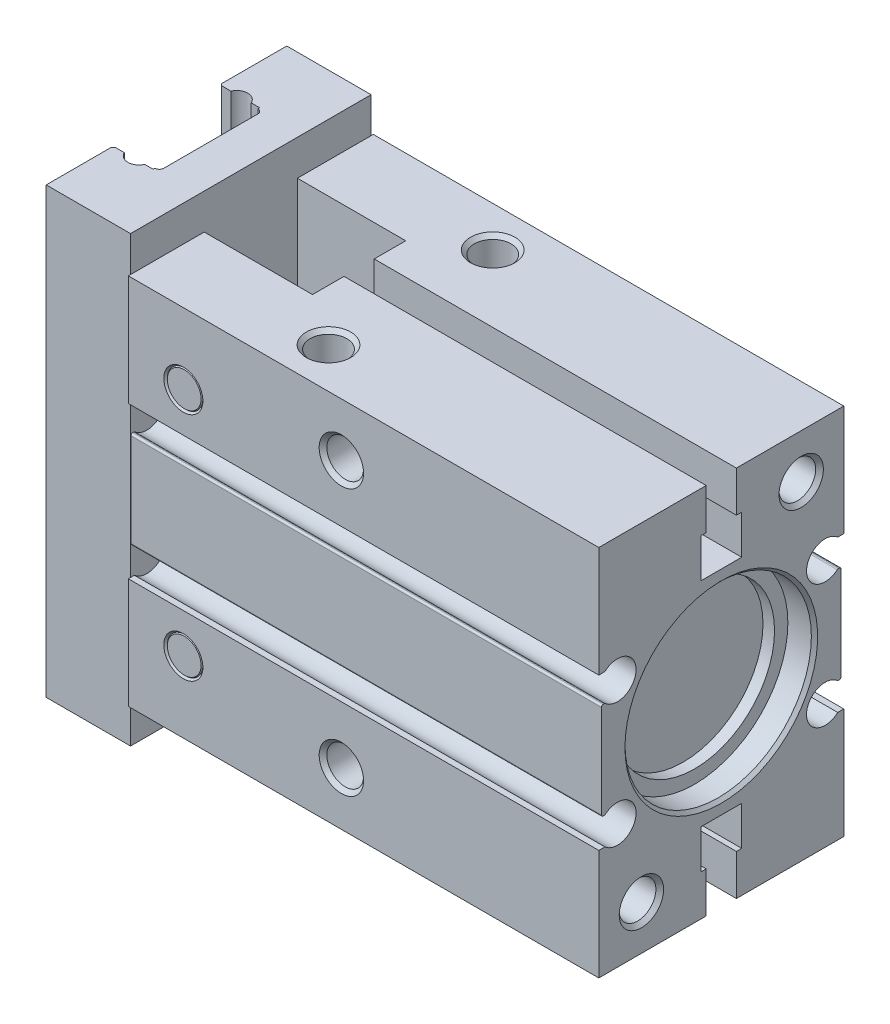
ISO-10303-21;
HEADER;
FILE_DESCRIPTION(('STEP AP214'),'2;1');
FILE_NAME('part.step','',(''),(''),'','','');
FILE_SCHEMA(('AUTOMOTIVE_DESIGN { 1 0 10303 214 1 1 1 1 }'));
ENDSEC;
DATA;
#1=APPLICATION_CONTEXT('core data for automotive mechanical design processes');
#2=APPLICATION_PROTOCOL_DEFINITION('international standard','automotive_design',2000,#1);
#3=PRODUCT_CONTEXT('',#1,'mechanical');
#4=PRODUCT('Part','Part','',(#3));
#5=PRODUCT_RELATED_PRODUCT_CATEGORY('part','',(#4));
#6=PRODUCT_DEFINITION_FORMATION('','',#4);
#7=PRODUCT_DEFINITION_CONTEXT('part definition',#1,'design');
#8=PRODUCT_DEFINITION('design','',#6,#7);
#9=PRODUCT_DEFINITION_SHAPE('','',#8);
#10=(LENGTH_UNIT() NAMED_UNIT(*) SI_UNIT(.MILLI.,.METRE.));
#11=(NAMED_UNIT(*) PLANE_ANGLE_UNIT() SI_UNIT($,.RADIAN.));
#12=(NAMED_UNIT(*) SI_UNIT($,.STERADIAN.) SOLID_ANGLE_UNIT());
#13=UNCERTAINTY_MEASURE_WITH_UNIT(LENGTH_MEASURE(1.E-05),#10,'distance_accuracy_value','');
#14=(GEOMETRIC_REPRESENTATION_CONTEXT(3) GLOBAL_UNCERTAINTY_ASSIGNED_CONTEXT((#13)) GLOBAL_UNIT_ASSIGNED_CONTEXT((#10,
#11,#12)) REPRESENTATION_CONTEXT('',''));
#15=CARTESIAN_POINT('',(0.,0.,0.));
#16=DIRECTION('',(0.,0.,1.));
#17=DIRECTION('',(1.,0.,0.));
#18=AXIS2_PLACEMENT_3D('',#15,#16,#17);
#19=CARTESIAN_POINT('',(-62.5,0.,0.));
#20=DIRECTION('',(1.,0.,0.));
#21=DIRECTION('',(0.,0.,-1.));
#22=AXIS2_PLACEMENT_3D('',#19,#20,#21);
#23=PLANE('',#22);
#24=DIRECTION('',(0.,0.,-1.));
#25=VECTOR('',#24,1.);
#26=CARTESIAN_POINT('',(-62.5,-25.,13.55));
#27=LINE('',#26,#25);
#28=CARTESIAN_POINT('',(-62.5,-25.,-6.21213203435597));
#29=VERTEX_POINT('',#28);
#30=CARTESIAN_POINT('',(-62.5,-25.,-13.55));
#31=VERTEX_POINT('',#30);
#32=EDGE_CURVE('E538',#29,#31,#27,.T.);
#33=ORIENTED_EDGE('',*,*,#32,.F.);
#34=DIRECTION('',(0.,1.,0.));
#35=VECTOR('',#34,1.);
#36=CARTESIAN_POINT('',(-62.5,-25.,-6.21213203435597));
#37=LINE('',#36,#35);
#38=CARTESIAN_POINT('',(-62.5,25.,-6.21213203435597));
#39=VERTEX_POINT('',#38);
#40=EDGE_CURVE('E548',#29,#39,#37,.T.);
#41=ORIENTED_EDGE('',*,*,#40,.T.);
#42=DIRECTION('',(0.,0.,1.));
#43=VECTOR('',#42,1.);
#44=CARTESIAN_POINT('',(-62.5,25.,-13.55));
#45=LINE('',#44,#43);
#46=CARTESIAN_POINT('',(-62.5,25.,-13.55));
#47=VERTEX_POINT('',#46);
#48=EDGE_CURVE('E528',#47,#39,#45,.T.);
#49=ORIENTED_EDGE('',*,*,#48,.F.);
#50=DIRECTION('',(0.,1.,0.));
#51=VECTOR('',#50,1.);
#52=CARTESIAN_POINT('',(-62.5,-25.,-13.55));
#53=LINE('',#52,#51);
#54=EDGE_CURVE('E541',#31,#47,#53,.T.);
#55=ORIENTED_EDGE('',*,*,#54,.F.);
#56=EDGE_LOOP('',(#33,#41,#49,#55));
#57=FACE_BOUND('',#56,.T.);
#58=ADVANCED_FACE('F16',(#57),#23,.F.);
#59=CARTESIAN_POINT('',(-53.,7.,11.7));
#60=DIRECTION('',(-1.,0.,0.));
#61=DIRECTION('',(0.,0.,1.));
#62=AXIS2_PLACEMENT_3D('',#59,#60,#61);
#63=PLANE('',#62);
#64=DIRECTION('',(0.,0.,-1.));
#65=VECTOR('',#64,1.);
#66=CARTESIAN_POINT('',(-53.,-21.,-1.7));
#67=LINE('',#66,#65);
#68=CARTESIAN_POINT('',(-53.,-21.,-13.55));
#69=VERTEX_POINT('',#68);
#70=CARTESIAN_POINT('',(-53.,-21.,-13.8));
#71=VERTEX_POINT('',#70);
#72=EDGE_CURVE('E762',#69,#71,#67,.T.);
#73=ORIENTED_EDGE('',*,*,#72,.F.);
#74=DIRECTION('',(0.,1.,0.));
#75=VECTOR('',#74,1.);
#76=CARTESIAN_POINT('',(-53.,-25.,-13.55));
#77=LINE('',#76,#75);
#78=CARTESIAN_POINT('',(-53.,-8.55,-13.55));
#79=VERTEX_POINT('',#78);
#80=EDGE_CURVE('E533',#69,#79,#77,.T.);
#81=ORIENTED_EDGE('',*,*,#80,.T.);
#82=DIRECTION('',(0.,0.,1.));
#83=VECTOR('',#82,1.);
#84=CARTESIAN_POINT('',(-53.,-8.55,-13.8));
#85=LINE('',#84,#83);
#86=CARTESIAN_POINT('',(-53.,-8.55,-13.8));
#87=VERTEX_POINT('',#86);
#88=EDGE_CURVE('E769',#87,#79,#85,.T.);
#89=ORIENTED_EDGE('',*,*,#88,.F.);
#90=DIRECTION('',(0.,1.,0.));
#91=VECTOR('',#90,1.);
#92=CARTESIAN_POINT('',(-53.,-21.,-13.8));
#93=LINE('',#92,#91);
#94=EDGE_CURVE('E766',#71,#87,#93,.T.);
#95=ORIENTED_EDGE('',*,*,#94,.F.);
#96=EDGE_LOOP('',(#73,#81,#89,#95));
#97=FACE_BOUND('',#96,.T.);
#98=ADVANCED_FACE('F1111',(#97),#63,.T.);
#99=DIRECTION('',(0.,0.,-1.));
#100=VECTOR('',#99,1.);
#101=CARTESIAN_POINT('',(-53.,8.55,-13.1168627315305));
#102=LINE('',#101,#100);
#103=CARTESIAN_POINT('',(-53.,8.55,-13.55));
#104=VERTEX_POINT('',#103);
#105=CARTESIAN_POINT('',(-53.,8.55,-13.8));
#106=VERTEX_POINT('',#105);
#107=EDGE_CURVE('E799',#104,#106,#102,.T.);
#108=ORIENTED_EDGE('',*,*,#107,.F.);
#109=CARTESIAN_POINT('',(-53.,21.,-13.55));
#110=VERTEX_POINT('',#109);
#111=EDGE_CURVE('E1099',#104,#110,#77,.T.);
#112=ORIENTED_EDGE('',*,*,#111,.T.);
#113=DIRECTION('',(0.,0.,1.));
#114=VECTOR('',#113,1.);
#115=CARTESIAN_POINT('',(-53.,21.,-13.8));
#116=LINE('',#115,#114);
#117=CARTESIAN_POINT('',(-53.,21.,-13.8));
#118=VERTEX_POINT('',#117);
#119=EDGE_CURVE('E806',#118,#110,#116,.T.);
#120=ORIENTED_EDGE('',*,*,#119,.F.);
#121=DIRECTION('',(0.,1.,0.));
#122=VECTOR('',#121,1.);
#123=CARTESIAN_POINT('',(-53.,8.55,-13.8));
#124=LINE('',#123,#122);
#125=EDGE_CURVE('E803',#106,#118,#124,.T.);
#126=ORIENTED_EDGE('',*,*,#125,.F.);
#127=EDGE_LOOP('',(#108,#112,#120,#126));
#128=FACE_BOUND('',#127,.T.);
#129=ADVANCED_FACE('F1138',(#128),#63,.T.);
#130=DIRECTION('',(0.,0.,1.));
#131=VECTOR('',#130,1.);
#132=CARTESIAN_POINT('',(-53.,21.,1.7));
#133=LINE('',#132,#131);
#134=CARTESIAN_POINT('',(-53.,21.,13.55));
#135=VERTEX_POINT('',#134);
#136=CARTESIAN_POINT('',(-53.,21.,13.8));
#137=VERTEX_POINT('',#136);
#138=EDGE_CURVE('E717',#135,#137,#133,.T.);
#139=ORIENTED_EDGE('',*,*,#138,.F.);
#140=DIRECTION('',(0.,-1.,0.));
#141=VECTOR('',#140,1.);
#142=CARTESIAN_POINT('',(-53.,25.,13.55));
#143=LINE('',#142,#141);
#144=CARTESIAN_POINT('',(-53.,8.55,13.55));
#145=VERTEX_POINT('',#144);
#146=EDGE_CURVE('E11',#135,#145,#143,.T.);
#147=ORIENTED_EDGE('',*,*,#146,.T.);
#148=DIRECTION('',(0.,0.,-1.));
#149=VECTOR('',#148,1.);
#150=CARTESIAN_POINT('',(-53.,8.55,13.8));
#151=LINE('',#150,#149);
#152=CARTESIAN_POINT('',(-53.,8.55,13.8));
#153=VERTEX_POINT('',#152);
#154=EDGE_CURVE('E721',#153,#145,#151,.T.);
#155=ORIENTED_EDGE('',*,*,#154,.F.);
#156=DIRECTION('',(0.,-1.,0.));
#157=VECTOR('',#156,1.);
#158=CARTESIAN_POINT('',(-53.,21.,13.8));
#159=LINE('',#158,#157);
#160=EDGE_CURVE('E716',#137,#153,#159,.T.);
#161=ORIENTED_EDGE('',*,*,#160,.F.);
#162=EDGE_LOOP('',(#139,#147,#155,#161));
#163=FACE_BOUND('',#162,.T.);
#164=ADVANCED_FACE('F2040',(#163),#63,.T.);
#165=DIRECTION('',(0.,0.,1.));
#166=VECTOR('',#165,1.);
#167=CARTESIAN_POINT('',(-53.,-8.55,13.1168627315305));
#168=LINE('',#167,#166);
#169=CARTESIAN_POINT('',(-53.,-8.55,13.55));
#170=VERTEX_POINT('',#169);
#171=CARTESIAN_POINT('',(-53.,-8.55,13.8));
#172=VERTEX_POINT('',#171);
#173=EDGE_CURVE('E751',#170,#172,#168,.T.);
#174=ORIENTED_EDGE('',*,*,#173,.F.);
#175=CARTESIAN_POINT('',(-53.,-21.,13.55));
#176=VERTEX_POINT('',#175);
#177=EDGE_CURVE('E25',#170,#176,#143,.T.);
#178=ORIENTED_EDGE('',*,*,#177,.T.);
#179=DIRECTION('',(0.,0.,-1.));
#180=VECTOR('',#179,1.);
#181=CARTESIAN_POINT('',(-53.,-21.,13.8));
#182=LINE('',#181,#180);
#183=CARTESIAN_POINT('',(-53.,-21.,13.8));
#184=VERTEX_POINT('',#183);
#185=EDGE_CURVE('E759',#184,#176,#182,.T.);
#186=ORIENTED_EDGE('',*,*,#185,.F.);
#187=DIRECTION('',(0.,-1.,0.));
#188=VECTOR('',#187,1.);
#189=CARTESIAN_POINT('',(-53.,-8.55,13.8));
#190=LINE('',#189,#188);
#191=EDGE_CURVE('E755',#172,#184,#190,.T.);
#192=ORIENTED_EDGE('',*,*,#191,.F.);
#193=EDGE_LOOP('',(#174,#178,#186,#192));
#194=FACE_BOUND('',#193,.T.);
#195=ADVANCED_FACE('F1054',(#194),#63,.T.);
#196=CARTESIAN_POINT('',(-53.,-16.4,-2.3));
#197=DIRECTION('',(0.,1.,0.));
#198=DIRECTION('',(0.,0.,1.));
#199=AXIS2_PLACEMENT_3D('',#196,#197,#198);
#200=PLANE('',#199);
#201=DIRECTION('',(1.,0.,0.));
#202=VECTOR('',#201,1.);
#203=CARTESIAN_POINT('',(-53.,-16.4,-1.7));
#204=LINE('',#203,#202);
#205=CARTESIAN_POINT('',(-40.8,-16.4,-1.7));
#206=VERTEX_POINT('',#205);
#207=CARTESIAN_POINT('',(-31.0832906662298,-16.4,-1.7));
#208=VERTEX_POINT('',#207);
#209=EDGE_CURVE('E996',#206,#208,#204,.T.);
#210=ORIENTED_EDGE('',*,*,#209,.T.);
#211=DIRECTION('',(0.,0.,1.));
#212=VECTOR('',#211,1.);
#213=CARTESIAN_POINT('',(-31.0832906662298,-16.4,-13.8));
#214=LINE('',#213,#212);
#215=CARTESIAN_POINT('',(-31.0832906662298,-16.4,-2.3));
#216=VERTEX_POINT('',#215);
#217=EDGE_CURVE('E604',#208,#216,#214,.F.);
#218=ORIENTED_EDGE('',*,*,#217,.T.);
#219=DIRECTION('',(1.,0.,0.));
#220=VECTOR('',#219,1.);
#221=CARTESIAN_POINT('',(-53.,-16.4,-2.3));
#222=LINE('',#221,#220);
#223=CARTESIAN_POINT('',(-40.8,-16.4,-2.3));
#224=VERTEX_POINT('',#223);
#225=EDGE_CURVE('E1000',#224,#216,#222,.T.);
#226=ORIENTED_EDGE('',*,*,#225,.F.);
#227=DIRECTION('',(0.,0.,-1.));
#228=VECTOR('',#227,1.);
#229=CARTESIAN_POINT('',(-40.8,-16.4,-2.3));
#230=LINE('',#229,#228);
#231=EDGE_CURVE('E694',#206,#224,#230,.T.);
#232=ORIENTED_EDGE('',*,*,#231,.F.);
#233=EDGE_LOOP('',(#210,#218,#226,#232));
#234=FACE_BOUND('',#233,.T.);
#235=ADVANCED_FACE('F1441',(#234),#200,.T.);
#236=CARTESIAN_POINT('',(-26.9167093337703,-16.4,-2.3));
#237=VERTEX_POINT('',#236);
#238=CARTESIAN_POINT('',(0.,-16.4,-2.3));
#239=VERTEX_POINT('',#238);
#240=EDGE_CURVE('E1003',#237,#239,#222,.T.);
#241=ORIENTED_EDGE('',*,*,#240,.F.);
#242=DIRECTION('',(0.,0.,1.));
#243=VECTOR('',#242,1.);
#244=CARTESIAN_POINT('',(-26.9167093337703,-16.4,-13.8));
#245=LINE('',#244,#243);
#246=CARTESIAN_POINT('',(-26.9167093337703,-16.4,-1.7));
#247=VERTEX_POINT('',#246);
#248=EDGE_CURVE('E601',#237,#247,#245,.T.);
#249=ORIENTED_EDGE('',*,*,#248,.T.);
#250=CARTESIAN_POINT('',(0.,-16.4,-1.7));
#251=VERTEX_POINT('',#250);
#252=EDGE_CURVE('E999',#247,#251,#204,.T.);
#253=ORIENTED_EDGE('',*,*,#252,.T.);
#254=DIRECTION('',(0.,0.,1.));
#255=VECTOR('',#254,1.);
#256=CARTESIAN_POINT('',(0.,-16.4,-2.3));
#257=LINE('',#256,#255);
#258=EDGE_CURVE('E869',#239,#251,#257,.T.);
#259=ORIENTED_EDGE('',*,*,#258,.F.);
#260=EDGE_LOOP('',(#241,#249,#253,#259));
#261=FACE_BOUND('',#260,.T.);
#262=ADVANCED_FACE('F1444',(#261),#200,.T.);
#263=CARTESIAN_POINT('',(-53.,-16.4,1.7));
#264=DIRECTION('',(0.,1.,0.));
#265=DIRECTION('',(0.,0.,1.));
#266=AXIS2_PLACEMENT_3D('',#263,#264,#265);
#267=PLANE('',#266);
#268=DIRECTION('',(1.,0.,0.));
#269=VECTOR('',#268,1.);
#270=CARTESIAN_POINT('',(-53.,-16.4,2.3));
#271=LINE('',#270,#269);
#272=CARTESIAN_POINT('',(-40.8,-16.4,2.3));
#273=VERTEX_POINT('',#272);
#274=CARTESIAN_POINT('',(-31.0832906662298,-16.4,2.3));
#275=VERTEX_POINT('',#274);
#276=EDGE_CURVE('E1008',#273,#275,#271,.T.);
#277=ORIENTED_EDGE('',*,*,#276,.T.);
#278=DIRECTION('',(0.,0.,1.));
#279=VECTOR('',#278,1.);
#280=CARTESIAN_POINT('',(-31.0832906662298,-16.4,-13.8));
#281=LINE('',#280,#279);
#282=CARTESIAN_POINT('',(-31.0832906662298,-16.4,1.7));
#283=VERTEX_POINT('',#282);
#284=EDGE_CURVE('E592',#275,#283,#281,.F.);
#285=ORIENTED_EDGE('',*,*,#284,.T.);
#286=DIRECTION('',(1.,0.,0.));
#287=VECTOR('',#286,1.);
#288=CARTESIAN_POINT('',(-53.,-16.4,1.7));
#289=LINE('',#288,#287);
#290=CARTESIAN_POINT('',(-40.8,-16.4,1.7));
#291=VERTEX_POINT('',#290);
#292=EDGE_CURVE('E1012',#291,#283,#289,.T.);
#293=ORIENTED_EDGE('',*,*,#292,.F.);
#294=DIRECTION('',(0.,0.,-1.));
#295=VECTOR('',#294,1.);
#296=CARTESIAN_POINT('',(-40.8,-16.4,1.7));
#297=LINE('',#296,#295);
#298=EDGE_CURVE('E686',#273,#291,#297,.T.);
#299=ORIENTED_EDGE('',*,*,#298,.F.);
#300=EDGE_LOOP('',(#277,#285,#293,#299));
#301=FACE_BOUND('',#300,.T.);
#302=ADVANCED_FACE('F1458',(#301),#267,.T.);
#303=CARTESIAN_POINT('',(-26.9167093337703,-16.4,1.7));
#304=VERTEX_POINT('',#303);
#305=CARTESIAN_POINT('',(0.,-16.4,1.7));
#306=VERTEX_POINT('',#305);
#307=EDGE_CURVE('E1015',#304,#306,#289,.T.);
#308=ORIENTED_EDGE('',*,*,#307,.F.);
#309=DIRECTION('',(0.,0.,1.));
#310=VECTOR('',#309,1.);
#311=CARTESIAN_POINT('',(-26.9167093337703,-16.4,-13.8));
#312=LINE('',#311,#310);
#313=CARTESIAN_POINT('',(-26.9167093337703,-16.4,2.3));
#314=VERTEX_POINT('',#313);
#315=EDGE_CURVE('E589',#304,#314,#312,.T.);
#316=ORIENTED_EDGE('',*,*,#315,.T.);
#317=CARTESIAN_POINT('',(0.,-16.4,2.3));
#318=VERTEX_POINT('',#317);
#319=EDGE_CURVE('E1011',#314,#318,#271,.T.);
#320=ORIENTED_EDGE('',*,*,#319,.T.);
#321=DIRECTION('',(0.,0.,1.));
#322=VECTOR('',#321,1.);
#323=CARTESIAN_POINT('',(0.,-16.4,1.7));
#324=LINE('',#323,#322);
#325=EDGE_CURVE('E857',#306,#318,#324,.T.);
#326=ORIENTED_EDGE('',*,*,#325,.F.);
#327=EDGE_LOOP('',(#308,#316,#320,#326));
#328=FACE_BOUND('',#327,.T.);
#329=ADVANCED_FACE('F1393',(#328),#267,.T.);
#330=CARTESIAN_POINT('',(-53.,16.4,2.3));
#331=DIRECTION('',(0.,-1.,0.));
#332=DIRECTION('',(0.,0.,-1.));
#333=AXIS2_PLACEMENT_3D('',#330,#331,#332);
#334=PLANE('',#333);
#335=DIRECTION('',(1.,0.,0.));
#336=VECTOR('',#335,1.);
#337=CARTESIAN_POINT('',(-53.,16.4,2.3));
#338=LINE('',#337,#336);
#339=CARTESIAN_POINT('',(-26.9167093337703,16.4,2.3));
#340=VERTEX_POINT('',#339);
#341=CARTESIAN_POINT('',(0.,16.4,2.3));
#342=VERTEX_POINT('',#341);
#343=EDGE_CURVE('E951',#340,#342,#338,.T.);
#344=ORIENTED_EDGE('',*,*,#343,.F.);
#345=DIRECTION('',(0.,0.,1.));
#346=VECTOR('',#345,1.);
#347=CARTESIAN_POINT('',(-26.9167093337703,16.4,-13.8));
#348=LINE('',#347,#346);
#349=CARTESIAN_POINT('',(-26.9167093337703,16.4,1.7));
#350=VERTEX_POINT('',#349);
#351=EDGE_CURVE('E649',#340,#350,#348,.F.);
#352=ORIENTED_EDGE('',*,*,#351,.T.);
#353=DIRECTION('',(1.,0.,0.));
#354=VECTOR('',#353,1.);
#355=CARTESIAN_POINT('',(-53.,16.4,1.7));
#356=LINE('',#355,#354);
#357=CARTESIAN_POINT('',(0.,16.4,1.7));
#358=VERTEX_POINT('',#357);
#359=EDGE_CURVE('E947',#350,#358,#356,.T.);
#360=ORIENTED_EDGE('',*,*,#359,.T.);
#361=DIRECTION('',(0.,0.,-1.));
#362=VECTOR('',#361,1.);
#363=CARTESIAN_POINT('',(0.,16.4,2.3));
#364=LINE('',#363,#362);
#365=EDGE_CURVE('E935',#342,#358,#364,.T.);
#366=ORIENTED_EDGE('',*,*,#365,.F.);
#367=EDGE_LOOP('',(#344,#352,#360,#366));
#368=FACE_BOUND('',#367,.T.);
#369=ADVANCED_FACE('F1227',(#368),#334,.T.);
#370=CARTESIAN_POINT('',(-40.8,16.4,1.7));
#371=VERTEX_POINT('',#370);
#372=CARTESIAN_POINT('',(-31.0832906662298,16.4,1.7));
#373=VERTEX_POINT('',#372);
#374=EDGE_CURVE('E944',#371,#373,#356,.T.);
#375=ORIENTED_EDGE('',*,*,#374,.T.);
#376=DIRECTION('',(0.,0.,1.));
#377=VECTOR('',#376,1.);
#378=CARTESIAN_POINT('',(-31.0832906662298,16.4,-13.8));
#379=LINE('',#378,#377);
#380=CARTESIAN_POINT('',(-31.0832906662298,16.4,2.3));
#381=VERTEX_POINT('',#380);
#382=EDGE_CURVE('E646',#373,#381,#379,.T.);
#383=ORIENTED_EDGE('',*,*,#382,.T.);
#384=CARTESIAN_POINT('',(-40.8,16.4,2.3));
#385=VERTEX_POINT('',#384);
#386=EDGE_CURVE('E948',#385,#381,#338,.T.);
#387=ORIENTED_EDGE('',*,*,#386,.F.);
#388=DIRECTION('',(0.,0.,1.));
#389=VECTOR('',#388,1.);
#390=CARTESIAN_POINT('',(-40.8,16.4,2.3));
#391=LINE('',#390,#389);
#392=EDGE_CURVE('E708',#371,#385,#391,.T.);
#393=ORIENTED_EDGE('',*,*,#392,.F.);
#394=EDGE_LOOP('',(#375,#383,#387,#393));
#395=FACE_BOUND('',#394,.T.);
#396=ADVANCED_FACE('F1392',(#395),#334,.T.);
#397=CARTESIAN_POINT('',(-53.,16.4,-1.7));
#398=DIRECTION('',(0.,-1.,0.));
#399=DIRECTION('',(0.,0.,-1.));
#400=AXIS2_PLACEMENT_3D('',#397,#398,#399);
#401=PLANE('',#400);
#402=DIRECTION('',(1.,0.,0.));
#403=VECTOR('',#402,1.);
#404=CARTESIAN_POINT('',(-53.,16.4,-1.7));
#405=LINE('',#404,#403);
#406=CARTESIAN_POINT('',(-26.9167093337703,16.4,-1.7));
#407=VERTEX_POINT('',#406);
#408=CARTESIAN_POINT('',(0.,16.4,-1.7));
#409=VERTEX_POINT('',#408);
#410=EDGE_CURVE('E963',#407,#409,#405,.T.);
#411=ORIENTED_EDGE('',*,*,#410,.F.);
#412=DIRECTION('',(0.,0.,1.));
#413=VECTOR('',#412,1.);
#414=CARTESIAN_POINT('',(-26.9167093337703,16.4,-13.8));
#415=LINE('',#414,#413);
#416=CARTESIAN_POINT('',(-26.9167093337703,16.4,-2.3));
#417=VERTEX_POINT('',#416);
#418=EDGE_CURVE('E637',#407,#417,#415,.F.);
#419=ORIENTED_EDGE('',*,*,#418,.T.);
#420=DIRECTION('',(1.,0.,0.));
#421=VECTOR('',#420,1.);
#422=CARTESIAN_POINT('',(-53.,16.4,-2.3));
#423=LINE('',#422,#421);
#424=CARTESIAN_POINT('',(0.,16.4,-2.3));
#425=VERTEX_POINT('',#424);
#426=EDGE_CURVE('E959',#417,#425,#423,.T.);
#427=ORIENTED_EDGE('',*,*,#426,.T.);
#428=DIRECTION('',(0.,0.,-1.));
#429=VECTOR('',#428,1.);
#430=CARTESIAN_POINT('',(0.,16.4,-1.7));
#431=LINE('',#430,#429);
#432=EDGE_CURVE('E923',#409,#425,#431,.T.);
#433=ORIENTED_EDGE('',*,*,#432,.F.);
#434=EDGE_LOOP('',(#411,#419,#427,#433));
#435=FACE_BOUND('',#434,.T.);
#436=ADVANCED_FACE('F1213',(#435),#401,.T.);
#437=CARTESIAN_POINT('',(-40.8,16.4,-2.3));
#438=VERTEX_POINT('',#437);
#439=CARTESIAN_POINT('',(-31.0832906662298,16.4,-2.3));
#440=VERTEX_POINT('',#439);
#441=EDGE_CURVE('E956',#438,#440,#423,.T.);
#442=ORIENTED_EDGE('',*,*,#441,.T.);
#443=DIRECTION('',(0.,0.,1.));
#444=VECTOR('',#443,1.);
#445=CARTESIAN_POINT('',(-31.0832906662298,16.4,-13.8));
#446=LINE('',#445,#444);
#447=CARTESIAN_POINT('',(-31.0832906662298,16.4,-1.7));
#448=VERTEX_POINT('',#447);
#449=EDGE_CURVE('E634',#440,#448,#446,.T.);
#450=ORIENTED_EDGE('',*,*,#449,.T.);
#451=CARTESIAN_POINT('',(-40.8,16.4,-1.7));
#452=VERTEX_POINT('',#451);
#453=EDGE_CURVE('E960',#452,#448,#405,.T.);
#454=ORIENTED_EDGE('',*,*,#453,.F.);
#455=DIRECTION('',(0.,0.,1.));
#456=VECTOR('',#455,1.);
#457=CARTESIAN_POINT('',(-40.8,16.4,-1.7));
#458=LINE('',#457,#456);
#459=EDGE_CURVE('E700',#438,#452,#458,.T.);
#460=ORIENTED_EDGE('',*,*,#459,.F.);
#461=EDGE_LOOP('',(#442,#450,#454,#460));
#462=FACE_BOUND('',#461,.T.);
#463=ADVANCED_FACE('F1201',(#462),#401,.T.);
#464=CARTESIAN_POINT('',(-53.,21.,1.7));
#465=DIRECTION('',(0.,1.,0.));
#466=DIRECTION('',(0.,0.,1.));
#467=AXIS2_PLACEMENT_3D('',#464,#465,#466);
#468=PLANE('',#467);
#469=CARTESIAN_POINT('',(-35.,21.,9.25));
#470=DIRECTION('',(0.,-1.,0.));
#471=DIRECTION('',(0.,0.,-1.));
#472=AXIS2_PLACEMENT_3D('',#469,#470,#471);
#473=CIRCLE('',#472,2.5);
#474=CARTESIAN_POINT('',(-35.,21.,6.75));
#475=VERTEX_POINT('',#474);
#476=EDGE_CURVE('E1911',#475,#475,#473,.T.);
#477=ORIENTED_EDGE('',*,*,#476,.T.);
#478=EDGE_LOOP('',(#477));
#479=FACE_BOUND('',#478,.T.);
#480=DIRECTION('',(0.,0.,-1.));
#481=VECTOR('',#480,1.);
#482=CARTESIAN_POINT('',(-40.8,21.,5.25));
#483=LINE('',#482,#481);
#484=CARTESIAN_POINT('',(-40.8,21.,5.25));
#485=VERTEX_POINT('',#484);
#486=CARTESIAN_POINT('',(-40.8,21.,1.7));
#487=VERTEX_POINT('',#486);
#488=EDGE_CURVE('E662',#485,#487,#483,.T.);
#489=ORIENTED_EDGE('',*,*,#488,.F.);
#490=DIRECTION('',(1.,0.,0.));
#491=VECTOR('',#490,1.);
#492=CARTESIAN_POINT('',(-53.,21.,5.25));
#493=LINE('',#492,#491);
#494=CARTESIAN_POINT('',(-53.,21.,5.25));
#495=VERTEX_POINT('',#494);
#496=EDGE_CURVE('E658',#495,#485,#493,.T.);
#497=ORIENTED_EDGE('',*,*,#496,.F.);
#498=EDGE_CURVE('E713',#495,#135,#133,.T.);
#499=ORIENTED_EDGE('',*,*,#498,.T.);
#500=ORIENTED_EDGE('',*,*,#138,.T.);
#501=DIRECTION('',(1.,0.,0.));
#502=VECTOR('',#501,1.);
#503=CARTESIAN_POINT('',(-53.,21.,13.8));
#504=LINE('',#503,#502);
#505=CARTESIAN_POINT('',(0.,21.,13.8));
#506=VERTEX_POINT('',#505);
#507=EDGE_CURVE('E809',#137,#506,#504,.T.);
#508=ORIENTED_EDGE('',*,*,#507,.T.);
#509=DIRECTION('',(0.,0.,1.));
#510=VECTOR('',#509,1.);
#511=CARTESIAN_POINT('',(0.,21.,1.7));
#512=LINE('',#511,#510);
#513=CARTESIAN_POINT('',(0.,21.,1.7));
#514=VERTEX_POINT('',#513);
#515=EDGE_CURVE('E712',#514,#506,#512,.T.);
#516=ORIENTED_EDGE('',*,*,#515,.F.);
#517=DIRECTION('',(1.,0.,0.));
#518=VECTOR('',#517,1.);
#519=CARTESIAN_POINT('',(-53.,21.,1.7));
#520=LINE('',#519,#518);
#521=EDGE_CURVE('E941',#487,#514,#520,.T.);
#522=ORIENTED_EDGE('',*,*,#521,.F.);
#523=EDGE_LOOP('',(#489,#497,#499,#500,#508,#516,#522));
#524=FACE_BOUND('',#523,.T.);
#525=ADVANCED_FACE('F18',(#479,#524),#468,.T.);
#526=CARTESIAN_POINT('',(-53.,16.4,1.7));
#527=DIRECTION('',(0.,0.,-1.));
#528=DIRECTION('',(-1.,0.,0.));
#529=AXIS2_PLACEMENT_3D('',#526,#527,#528);
#530=PLANE('',#529);
#531=ORIENTED_EDGE('',*,*,#359,.F.);
#532=CARTESIAN_POINT('',(-29.,15.,1.7));
#533=DIRECTION('',(0.,0.,-1.));
#534=DIRECTION('',(-1.,0.,0.));
#535=AXIS2_PLACEMENT_3D('',#532,#533,#534);
#536=CIRCLE('',#535,2.51);
#537=EDGE_CURVE('E652',#350,#373,#536,.F.);
#538=ORIENTED_EDGE('',*,*,#537,.T.);
#539=ORIENTED_EDGE('',*,*,#374,.F.);
#540=DIRECTION('',(0.,-1.,0.));
#541=VECTOR('',#540,1.);
#542=CARTESIAN_POINT('',(-40.8,16.4,1.7));
#543=LINE('',#542,#541);
#544=EDGE_CURVE('E710',#487,#371,#543,.T.);
#545=ORIENTED_EDGE('',*,*,#544,.F.);
#546=ORIENTED_EDGE('',*,*,#521,.T.);
#547=DIRECTION('',(0.,1.,0.));
#548=VECTOR('',#547,1.);
#549=CARTESIAN_POINT('',(0.,16.4,1.7));
#550=LINE('',#549,#548);
#551=EDGE_CURVE('E938',#358,#514,#550,.T.);
#552=ORIENTED_EDGE('',*,*,#551,.F.);
#553=EDGE_LOOP('',(#531,#538,#539,#545,#546,#552));
#554=FACE_BOUND('',#553,.T.);
#555=ADVANCED_FACE('F1231',(#554),#530,.T.);
#556=CARTESIAN_POINT('',(-53.,12.,2.3));
#557=DIRECTION('',(0.,0.,-1.));
#558=DIRECTION('',(-1.,0.,0.));
#559=AXIS2_PLACEMENT_3D('',#556,#557,#558);
#560=PLANE('',#559);
#561=ORIENTED_EDGE('',*,*,#386,.T.);
#562=CARTESIAN_POINT('',(-29.,15.,2.3));
#563=DIRECTION('',(0.,0.,-1.));
#564=DIRECTION('',(-1.,0.,0.));
#565=AXIS2_PLACEMENT_3D('',#562,#563,#564);
#566=CIRCLE('',#565,2.51);
#567=EDGE_CURVE('E643',#381,#340,#566,.F.);
#568=ORIENTED_EDGE('',*,*,#567,.T.);
#569=ORIENTED_EDGE('',*,*,#343,.T.);
#570=DIRECTION('',(0.,1.,0.));
#571=VECTOR('',#570,1.);
#572=CARTESIAN_POINT('',(0.,12.,2.3));
#573=LINE('',#572,#571);
#574=CARTESIAN_POINT('',(0.,12.,2.3));
#575=VERTEX_POINT('',#574);
#576=EDGE_CURVE('E932',#575,#342,#573,.T.);
#577=ORIENTED_EDGE('',*,*,#576,.F.);
#578=DIRECTION('',(1.,0.,0.));
#579=VECTOR('',#578,1.);
#580=CARTESIAN_POINT('',(-53.,12.,2.3));
#581=LINE('',#580,#579);
#582=CARTESIAN_POINT('',(-40.8,12.,2.3));
#583=VERTEX_POINT('',#582);
#584=EDGE_CURVE('E952',#583,#575,#581,.T.);
#585=ORIENTED_EDGE('',*,*,#584,.F.);
#586=DIRECTION('',(0.,-1.,0.));
#587=VECTOR('',#586,1.);
#588=CARTESIAN_POINT('',(-40.8,12.,2.3));
#589=LINE('',#588,#587);
#590=EDGE_CURVE('E706',#385,#583,#589,.T.);
#591=ORIENTED_EDGE('',*,*,#590,.F.);
#592=EDGE_LOOP('',(#561,#568,#569,#577,#585,#591));
#593=FACE_BOUND('',#592,.T.);
#594=ADVANCED_FACE('F1223',(#593),#560,.T.);
#595=CARTESIAN_POINT('',(-53.,12.,-2.3));
#596=DIRECTION('',(0.,1.,0.));
#597=DIRECTION('',(0.,0.,1.));
#598=AXIS2_PLACEMENT_3D('',#595,#596,#597);
#599=PLANE('',#598);
#600=DIRECTION('',(0.,0.,-1.));
#601=VECTOR('',#600,1.);
#602=CARTESIAN_POINT('',(-40.8,12.,-2.3));
#603=LINE('',#602,#601);
#604=CARTESIAN_POINT('',(-40.8,12.,-2.3));
#605=VERTEX_POINT('',#604);
#606=EDGE_CURVE('E704',#583,#605,#603,.T.);
#607=ORIENTED_EDGE('',*,*,#606,.F.);
#608=ORIENTED_EDGE('',*,*,#584,.T.);
#609=DIRECTION('',(0.,0.,1.));
#610=VECTOR('',#609,1.);
#611=CARTESIAN_POINT('',(0.,12.,-2.3));
#612=LINE('',#611,#610);
#613=CARTESIAN_POINT('',(0.,12.,-2.3));
#614=VERTEX_POINT('',#613);
#615=EDGE_CURVE('E929',#614,#575,#612,.T.);
#616=ORIENTED_EDGE('',*,*,#615,.F.);
#617=DIRECTION('',(1.,0.,0.));
#618=VECTOR('',#617,1.);
#619=CARTESIAN_POINT('',(-53.,12.,-2.3));
#620=LINE('',#619,#618);
#621=EDGE_CURVE('E954',#605,#614,#620,.T.);
#622=ORIENTED_EDGE('',*,*,#621,.F.);
#623=EDGE_LOOP('',(#607,#608,#616,#622));
#624=FACE_BOUND('',#623,.T.);
#625=ADVANCED_FACE('F1219',(#624),#599,.T.);
#626=CARTESIAN_POINT('',(-53.,16.4,-2.3));
#627=DIRECTION('',(0.,0.,1.));
#628=DIRECTION('',(0.,-1.,0.));
#629=AXIS2_PLACEMENT_3D('',#626,#627,#628);
#630=PLANE('',#629);
#631=ORIENTED_EDGE('',*,*,#426,.F.);
#632=CARTESIAN_POINT('',(-29.,15.,-2.3));
#633=DIRECTION('',(0.,0.,1.));
#634=DIRECTION('',(0.,-1.,0.));
#635=AXIS2_PLACEMENT_3D('',#632,#633,#634);
#636=CIRCLE('',#635,2.51);
#637=EDGE_CURVE('E640',#417,#440,#636,.F.);
#638=ORIENTED_EDGE('',*,*,#637,.T.);
#639=ORIENTED_EDGE('',*,*,#441,.F.);
#640=DIRECTION('',(0.,1.,0.));
#641=VECTOR('',#640,1.);
#642=CARTESIAN_POINT('',(-40.8,16.4,-2.3));
#643=LINE('',#642,#641);
#644=EDGE_CURVE('E702',#605,#438,#643,.T.);
#645=ORIENTED_EDGE('',*,*,#644,.F.);
#646=ORIENTED_EDGE('',*,*,#621,.T.);
#647=DIRECTION('',(0.,-1.,0.));
#648=VECTOR('',#647,1.);
#649=CARTESIAN_POINT('',(0.,16.4,-2.3));
#650=LINE('',#649,#648);
#651=EDGE_CURVE('E926',#425,#614,#650,.T.);
#652=ORIENTED_EDGE('',*,*,#651,.F.);
#653=EDGE_LOOP('',(#631,#638,#639,#645,#646,#652));
#654=FACE_BOUND('',#653,.T.);
#655=ADVANCED_FACE('F1208',(#654),#630,.T.);
#656=CARTESIAN_POINT('',(-53.,21.,-1.7));
#657=DIRECTION('',(0.,0.,1.));
#658=DIRECTION('',(0.,-1.,0.));
#659=AXIS2_PLACEMENT_3D('',#656,#657,#658);
#660=PLANE('',#659);
#661=ORIENTED_EDGE('',*,*,#453,.T.);
#662=CARTESIAN_POINT('',(-29.,15.,-1.7));
#663=DIRECTION('',(0.,0.,1.));
#664=DIRECTION('',(0.,-1.,0.));
#665=AXIS2_PLACEMENT_3D('',#662,#663,#664);
#666=CIRCLE('',#665,2.51);
#667=EDGE_CURVE('E943',#448,#407,#666,.F.);
#668=ORIENTED_EDGE('',*,*,#667,.T.);
#669=ORIENTED_EDGE('',*,*,#410,.T.);
#670=DIRECTION('',(0.,-1.,0.));
#671=VECTOR('',#670,1.);
#672=CARTESIAN_POINT('',(0.,21.,-1.7));
#673=LINE('',#672,#671);
#674=CARTESIAN_POINT('',(0.,21.,-1.7));
#675=VERTEX_POINT('',#674);
#676=EDGE_CURVE('E920',#675,#409,#673,.T.);
#677=ORIENTED_EDGE('',*,*,#676,.F.);
#678=DIRECTION('',(1.,0.,0.));
#679=VECTOR('',#678,1.);
#680=CARTESIAN_POINT('',(-53.,21.,-1.7));
#681=LINE('',#680,#679);
#682=CARTESIAN_POINT('',(-40.8,21.,-1.7));
#683=VERTEX_POINT('',#682);
#684=EDGE_CURVE('E964',#683,#675,#681,.T.);
#685=ORIENTED_EDGE('',*,*,#684,.F.);
#686=DIRECTION('',(0.,1.,0.));
#687=VECTOR('',#686,1.);
#688=CARTESIAN_POINT('',(-40.8,21.,-1.7));
#689=LINE('',#688,#687);
#690=EDGE_CURVE('E698',#452,#683,#689,.T.);
#691=ORIENTED_EDGE('',*,*,#690,.F.);
#692=EDGE_LOOP('',(#661,#668,#669,#677,#685,#691));
#693=FACE_BOUND('',#692,.T.);
#694=ADVANCED_FACE('F1198',(#693),#660,.T.);
#695=CARTESIAN_POINT('',(-53.,21.,-13.8));
#696=DIRECTION('',(0.,1.,0.));
#697=DIRECTION('',(0.,0.,1.));
#698=AXIS2_PLACEMENT_3D('',#695,#696,#697);
#699=PLANE('',#698);
#700=CARTESIAN_POINT('',(-35.,21.,-9.25));
#701=DIRECTION('',(0.,-1.,0.));
#702=DIRECTION('',(0.,0.,-1.));
#703=AXIS2_PLACEMENT_3D('',#700,#701,#702);
#704=CIRCLE('',#703,2.5);
#705=CARTESIAN_POINT('',(-35.,21.,-11.75));
#706=VERTEX_POINT('',#705);
#707=EDGE_CURVE('E1899',#706,#706,#704,.T.);
#708=ORIENTED_EDGE('',*,*,#707,.T.);
#709=EDGE_LOOP('',(#708));
#710=FACE_BOUND('',#709,.T.);
#711=DIRECTION('',(-1.,0.,0.));
#712=VECTOR('',#711,1.);
#713=CARTESIAN_POINT('',(-40.8,21.,-5.25));
#714=LINE('',#713,#712);
#715=CARTESIAN_POINT('',(-40.8,21.,-5.25));
#716=VERTEX_POINT('',#715);
#717=CARTESIAN_POINT('',(-53.,21.,-5.25));
#718=VERTEX_POINT('',#717);
#719=EDGE_CURVE('E655',#716,#718,#714,.T.);
#720=ORIENTED_EDGE('',*,*,#719,.F.);
#721=EDGE_CURVE('E661',#683,#716,#483,.T.);
#722=ORIENTED_EDGE('',*,*,#721,.F.);
#723=ORIENTED_EDGE('',*,*,#684,.T.);
#724=DIRECTION('',(0.,0.,1.));
#725=VECTOR('',#724,1.);
#726=CARTESIAN_POINT('',(0.,21.,-13.8));
#727=LINE('',#726,#725);
#728=CARTESIAN_POINT('',(0.,21.,-13.8));
#729=VERTEX_POINT('',#728);
#730=EDGE_CURVE('E917',#729,#675,#727,.T.);
#731=ORIENTED_EDGE('',*,*,#730,.F.);
#732=DIRECTION('',(1.,0.,0.));
#733=VECTOR('',#732,1.);
#734=CARTESIAN_POINT('',(-53.,21.,-13.8));
#735=LINE('',#734,#733);
#736=EDGE_CURVE('E966',#118,#729,#735,.T.);
#737=ORIENTED_EDGE('',*,*,#736,.F.);
#738=ORIENTED_EDGE('',*,*,#119,.T.);
#739=EDGE_CURVE('E557',#110,#718,#116,.T.);
#740=ORIENTED_EDGE('',*,*,#739,.T.);
#741=EDGE_LOOP('',(#720,#722,#723,#731,#737,#738,#740));
#742=FACE_BOUND('',#741,.T.);
#743=ADVANCED_FACE('F1134',(#710,#742),#699,.T.);
#744=CARTESIAN_POINT('',(-53.,8.55,-13.8));
#745=DIRECTION('',(0.,0.,-1.));
#746=DIRECTION('',(-1.,0.,0.));
#747=AXIS2_PLACEMENT_3D('',#744,#745,#746);
#748=PLANE('',#747);
#749=CARTESIAN_POINT('',(-46.8,13.,-13.8));
#750=DIRECTION('',(0.,0.,1.));
#751=DIRECTION('',(1.,0.,0.));
#752=AXIS2_PLACEMENT_3D('',#749,#750,#751);
#753=CIRCLE('',#752,2.2);
#754=CARTESIAN_POINT('',(-44.6,13.,-13.8));
#755=VERTEX_POINT('',#754);
#756=EDGE_CURVE('E1510',#755,#755,#753,.T.);
#757=ORIENTED_EDGE('',*,*,#756,.T.);
#758=EDGE_LOOP('',(#757));
#759=FACE_BOUND('',#758,.T.);
#760=CARTESIAN_POINT('',(-29.,15.,-13.8));
#761=DIRECTION('',(0.,0.,1.));
#762=DIRECTION('',(1.,0.,0.));
#763=AXIS2_PLACEMENT_3D('',#760,#761,#762);
#764=CIRCLE('',#763,2.5);
#765=CARTESIAN_POINT('',(-26.5,15.,-13.8));
#766=VERTEX_POINT('',#765);
#767=EDGE_CURVE('E610',#766,#766,#764,.T.);
#768=ORIENTED_EDGE('',*,*,#767,.T.);
#769=EDGE_LOOP('',(#768));
#770=FACE_BOUND('',#769,.T.);
#771=DIRECTION('',(0.,1.,0.));
#772=VECTOR('',#771,1.);
#773=CARTESIAN_POINT('',(0.,8.55,-13.8));
#774=LINE('',#773,#772);
#775=CARTESIAN_POINT('',(0.,8.55,-13.8));
#776=VERTEX_POINT('',#775);
#777=EDGE_CURVE('E914',#776,#729,#774,.T.);
#778=ORIENTED_EDGE('',*,*,#777,.F.);
#779=DIRECTION('',(1.,0.,0.));
#780=VECTOR('',#779,1.);
#781=CARTESIAN_POINT('',(-53.,8.55,-13.8));
#782=LINE('',#781,#780);
#783=EDGE_CURVE('E968',#106,#776,#782,.T.);
#784=ORIENTED_EDGE('',*,*,#783,.F.);
#785=ORIENTED_EDGE('',*,*,#125,.T.);
#786=ORIENTED_EDGE('',*,*,#736,.T.);
#787=EDGE_LOOP('',(#778,#784,#785,#786));
#788=FACE_BOUND('',#787,.T.);
#789=ADVANCED_FACE('F1142',(#759,#770,#788),#748,.T.);
#790=CARTESIAN_POINT('',(-53.,8.55,-13.1168627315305));
#791=DIRECTION('',(0.,-1.,0.));
#792=DIRECTION('',(0.,0.,-1.));
#793=AXIS2_PLACEMENT_3D('',#790,#791,#792);
#794=PLANE('',#793);
#795=DIRECTION('',(0.,0.,-1.));
#796=VECTOR('',#795,1.);
#797=CARTESIAN_POINT('',(0.,8.55,-13.1168627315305));
#798=LINE('',#797,#796);
#799=CARTESIAN_POINT('',(0.,8.55,-13.1168627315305));
#800=VERTEX_POINT('',#799);
#801=EDGE_CURVE('E911',#800,#776,#798,.T.);
#802=ORIENTED_EDGE('',*,*,#801,.F.);
#803=DIRECTION('',(1.,0.,0.));
#804=VECTOR('',#803,1.);
#805=CARTESIAN_POINT('',(-53.,8.55,-13.1168627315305));
#806=LINE('',#805,#804);
#807=CARTESIAN_POINT('',(-53.,8.55,-13.1168627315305));
#808=VERTEX_POINT('',#807);
#809=EDGE_CURVE('E970',#808,#800,#806,.T.);
#810=ORIENTED_EDGE('',*,*,#809,.F.);
#811=EDGE_CURVE('E800',#808,#104,#102,.T.);
#812=ORIENTED_EDGE('',*,*,#811,.T.);
#813=ORIENTED_EDGE('',*,*,#107,.T.);
#814=ORIENTED_EDGE('',*,*,#783,.T.);
#815=EDGE_LOOP('',(#802,#810,#812,#813,#814));
#816=FACE_BOUND('',#815,.T.);
#817=ADVANCED_FACE('F1145',(#816),#794,.T.);
#818=CARTESIAN_POINT('',(-53.,7.,-11.7));
#819=DIRECTION('',(1.,0.,0.));
#820=DIRECTION('',(0.,0.,-1.));
#821=AXIS2_PLACEMENT_3D('',#818,#819,#820);
#822=CYLINDRICAL_SURFACE('',#821,2.1);
#823=CARTESIAN_POINT('',(0.,7.,-11.7));
#824=DIRECTION('',(-1.,0.,0.));
#825=DIRECTION('',(0.,0.,1.));
#826=AXIS2_PLACEMENT_3D('',#823,#824,#825);
#827=CIRCLE('',#826,2.1);
#828=CARTESIAN_POINT('',(0.,5.40217391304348,-13.0627001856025));
#829=VERTEX_POINT('',#828);
#830=EDGE_CURVE('E908',#829,#800,#827,.T.);
#831=ORIENTED_EDGE('',*,*,#830,.F.);
#832=DIRECTION('',(1.,0.,0.));
#833=VECTOR('',#832,1.);
#834=CARTESIAN_POINT('',(-53.,5.40217391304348,-13.0627001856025));
#835=LINE('',#834,#833);
#836=CARTESIAN_POINT('',(-53.,5.40217391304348,-13.0627001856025));
#837=VERTEX_POINT('',#836);
#838=EDGE_CURVE('E972',#837,#829,#835,.T.);
#839=ORIENTED_EDGE('',*,*,#838,.F.);
#840=CARTESIAN_POINT('',(-53.,7.,-11.7));
#841=DIRECTION('',(-1.,0.,0.));
#842=DIRECTION('',(0.,0.,1.));
#843=AXIS2_PLACEMENT_3D('',#840,#841,#842);
#844=CIRCLE('',#843,2.1);
#845=EDGE_CURVE('E796',#837,#808,#844,.T.);
#846=ORIENTED_EDGE('',*,*,#845,.T.);
#847=ORIENTED_EDGE('',*,*,#809,.T.);
#848=EDGE_LOOP('',(#831,#839,#846,#847));
#849=FACE_BOUND('',#848,.T.);
#850=ADVANCED_FACE('F1152',(#849),#822,.F.);
#851=CARTESIAN_POINT('',(-53.,5.25,-13.1924811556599));
#852=DIRECTION('',(1.,0.,0.));
#853=DIRECTION('',(0.,0.,-1.));
#854=AXIS2_PLACEMENT_3D('',#851,#852,#853);
#855=CYLINDRICAL_SURFACE('',#854,0.199999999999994);
#856=CARTESIAN_POINT('',(0.,5.25,-13.1924811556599));
#857=DIRECTION('',(1.,0.,0.));
#858=DIRECTION('',(0.,0.,-1.));
#859=AXIS2_PLACEMENT_3D('',#856,#857,#858);
#860=CIRCLE('',#859,0.199999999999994);
#861=CARTESIAN_POINT('',(0.,5.45,-13.1924811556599));
#862=VERTEX_POINT('',#861);
#863=EDGE_CURVE('E905',#862,#829,#860,.T.);
#864=ORIENTED_EDGE('',*,*,#863,.F.);
#865=DIRECTION('',(1.,0.,0.));
#866=VECTOR('',#865,1.);
#867=CARTESIAN_POINT('',(-53.,5.45,-13.1924811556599));
#868=LINE('',#867,#866);
#869=CARTESIAN_POINT('',(-53.,5.45,-13.1924811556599));
#870=VERTEX_POINT('',#869);
#871=EDGE_CURVE('E974',#870,#862,#868,.T.);
#872=ORIENTED_EDGE('',*,*,#871,.F.);
#873=CARTESIAN_POINT('',(-53.,5.25,-13.1924811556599));
#874=DIRECTION('',(1.,0.,0.));
#875=DIRECTION('',(0.,0.,-1.));
#876=AXIS2_PLACEMENT_3D('',#873,#874,#875);
#877=CIRCLE('',#876,0.199999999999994);
#878=EDGE_CURVE('E793',#870,#837,#877,.T.);
#879=ORIENTED_EDGE('',*,*,#878,.T.);
#880=ORIENTED_EDGE('',*,*,#838,.T.);
#881=EDGE_LOOP('',(#864,#872,#879,#880));
#882=FACE_BOUND('',#881,.T.);
#883=ADVANCED_FACE('F1155',(#882),#855,.T.);
#884=CARTESIAN_POINT('',(-53.,5.45,-13.3));
#885=DIRECTION('',(0.,1.,0.));
#886=DIRECTION('',(0.,0.,1.));
#887=AXIS2_PLACEMENT_3D('',#884,#885,#886);
#888=PLANE('',#887);
#889=DIRECTION('',(0.,0.,1.));
#890=VECTOR('',#889,1.);
#891=CARTESIAN_POINT('',(0.,5.45,-13.3));
#892=LINE('',#891,#890);
#893=CARTESIAN_POINT('',(0.,5.45,-13.3));
#894=VERTEX_POINT('',#893);
#895=EDGE_CURVE('E902',#894,#862,#892,.T.);
#896=ORIENTED_EDGE('',*,*,#895,.F.);
#897=DIRECTION('',(1.,0.,0.));
#898=VECTOR('',#897,1.);
#899=CARTESIAN_POINT('',(-53.,5.45,-13.3));
#900=LINE('',#899,#898);
#901=CARTESIAN_POINT('',(-53.,5.45,-13.3));
#902=VERTEX_POINT('',#901);
#903=EDGE_CURVE('E976',#902,#894,#900,.T.);
#904=ORIENTED_EDGE('',*,*,#903,.F.);
#905=DIRECTION('',(0.,0.,1.));
#906=VECTOR('',#905,1.);
#907=CARTESIAN_POINT('',(-53.,5.45,-13.3));
#908=LINE('',#907,#906);
#909=EDGE_CURVE('E790',#902,#870,#908,.T.);
#910=ORIENTED_EDGE('',*,*,#909,.T.);
#911=ORIENTED_EDGE('',*,*,#871,.T.);
#912=EDGE_LOOP('',(#896,#904,#910,#911));
#913=FACE_BOUND('',#912,.T.);
#914=ADVANCED_FACE('F1159',(#913),#888,.T.);
#915=CARTESIAN_POINT('',(-53.,5.25,-13.3));
#916=DIRECTION('',(1.,0.,0.));
#917=DIRECTION('',(0.,0.,-1.));
#918=AXIS2_PLACEMENT_3D('',#915,#916,#917);
#919=CYLINDRICAL_SURFACE('',#918,0.199999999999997);
#920=CARTESIAN_POINT('',(0.,5.25,-13.3));
#921=DIRECTION('',(1.,0.,0.));
#922=DIRECTION('',(0.,0.,-1.));
#923=AXIS2_PLACEMENT_3D('',#920,#921,#922);
#924=CIRCLE('',#923,0.199999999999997);
#925=CARTESIAN_POINT('',(0.,5.25,-13.5));
#926=VERTEX_POINT('',#925);
#927=EDGE_CURVE('E899',#926,#894,#924,.T.);
#928=ORIENTED_EDGE('',*,*,#927,.F.);
#929=DIRECTION('',(1.,0.,0.));
#930=VECTOR('',#929,1.);
#931=CARTESIAN_POINT('',(-53.,5.25,-13.5));
#932=LINE('',#931,#930);
#933=CARTESIAN_POINT('',(-53.,5.25,-13.5));
#934=VERTEX_POINT('',#933);
#935=EDGE_CURVE('E978',#934,#926,#932,.T.);
#936=ORIENTED_EDGE('',*,*,#935,.F.);
#937=CARTESIAN_POINT('',(-53.,5.25,-13.3));
#938=DIRECTION('',(1.,0.,0.));
#939=DIRECTION('',(0.,0.,-1.));
#940=AXIS2_PLACEMENT_3D('',#937,#938,#939);
#941=CIRCLE('',#940,0.199999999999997);
#942=EDGE_CURVE('E787',#934,#902,#941,.T.);
#943=ORIENTED_EDGE('',*,*,#942,.T.);
#944=ORIENTED_EDGE('',*,*,#903,.T.);
#945=EDGE_LOOP('',(#928,#936,#943,#944));
#946=FACE_BOUND('',#945,.T.);
#947=ADVANCED_FACE('F1164',(#946),#919,.T.);
#948=CARTESIAN_POINT('',(-53.,-5.25,-13.5));
#949=DIRECTION('',(0.,0.,-1.));
#950=DIRECTION('',(-1.,0.,0.));
#951=AXIS2_PLACEMENT_3D('',#948,#949,#950);
#952=PLANE('',#951);
#953=DIRECTION('',(0.,1.,0.));
#954=VECTOR('',#953,1.);
#955=CARTESIAN_POINT('',(0.,-5.25,-13.5));
#956=LINE('',#955,#954);
#957=CARTESIAN_POINT('',(0.,-5.25,-13.5));
#958=VERTEX_POINT('',#957);
#959=EDGE_CURVE('E896',#958,#926,#956,.T.);
#960=ORIENTED_EDGE('',*,*,#959,.F.);
#961=DIRECTION('',(1.,0.,0.));
#962=VECTOR('',#961,1.);
#963=CARTESIAN_POINT('',(-53.,-5.25,-13.5));
#964=LINE('',#963,#962);
#965=CARTESIAN_POINT('',(-53.,-5.25,-13.5));
#966=VERTEX_POINT('',#965);
#967=EDGE_CURVE('E980',#966,#958,#964,.T.);
#968=ORIENTED_EDGE('',*,*,#967,.F.);
#969=DIRECTION('',(0.,1.,0.));
#970=VECTOR('',#969,1.);
#971=CARTESIAN_POINT('',(-53.,-5.25,-13.5));
#972=LINE('',#971,#970);
#973=EDGE_CURVE('E784',#966,#934,#972,.T.);
#974=ORIENTED_EDGE('',*,*,#973,.T.);
#975=ORIENTED_EDGE('',*,*,#935,.T.);
#976=EDGE_LOOP('',(#960,#968,#974,#975));
#977=FACE_BOUND('',#976,.T.);
#978=ADVANCED_FACE('F1167',(#977),#952,.T.);
#979=CARTESIAN_POINT('',(-53.,-5.25,-13.3));
#980=DIRECTION('',(1.,0.,0.));
#981=DIRECTION('',(0.,0.,-1.));
#982=AXIS2_PLACEMENT_3D('',#979,#980,#981);
#983=CYLINDRICAL_SURFACE('',#982,0.2);
#984=CARTESIAN_POINT('',(0.,-5.25,-13.3));
#985=DIRECTION('',(1.,0.,0.));
#986=DIRECTION('',(0.,0.,-1.));
#987=AXIS2_PLACEMENT_3D('',#984,#985,#986);
#988=CIRCLE('',#987,0.2);
#989=CARTESIAN_POINT('',(0.,-5.45,-13.3));
#990=VERTEX_POINT('',#989);
#991=EDGE_CURVE('E893',#990,#958,#988,.T.);
#992=ORIENTED_EDGE('',*,*,#991,.F.);
#993=DIRECTION('',(1.,0.,0.));
#994=VECTOR('',#993,1.);
#995=CARTESIAN_POINT('',(-53.,-5.45,-13.3));
#996=LINE('',#995,#994);
#997=CARTESIAN_POINT('',(-53.,-5.45,-13.3));
#998=VERTEX_POINT('',#997);
#999=EDGE_CURVE('E982',#998,#990,#996,.T.);
#1000=ORIENTED_EDGE('',*,*,#999,.F.);
#1001=CARTESIAN_POINT('',(-53.,-5.25,-13.3));
#1002=DIRECTION('',(1.,0.,0.));
#1003=DIRECTION('',(0.,0.,-1.));
#1004=AXIS2_PLACEMENT_3D('',#1001,#1002,#1003);
#1005=CIRCLE('',#1004,0.2);
#1006=EDGE_CURVE('E781',#998,#966,#1005,.T.);
#1007=ORIENTED_EDGE('',*,*,#1006,.T.);
#1008=ORIENTED_EDGE('',*,*,#967,.T.);
#1009=EDGE_LOOP('',(#992,#1000,#1007,#1008));
#1010=FACE_BOUND('',#1009,.T.);
#1011=ADVANCED_FACE('F1171',(#1010),#983,.T.);
#1012=CARTESIAN_POINT('',(-53.,-5.45,-13.1924811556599));
#1013=DIRECTION('',(0.,-1.,0.));
#1014=DIRECTION('',(0.,0.,-1.));
#1015=AXIS2_PLACEMENT_3D('',#1012,#1013,#1014);
#1016=PLANE('',#1015);
#1017=DIRECTION('',(0.,0.,-1.));
#1018=VECTOR('',#1017,1.);
#1019=CARTESIAN_POINT('',(0.,-5.45,-13.1924811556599));
#1020=LINE('',#1019,#1018);
#1021=CARTESIAN_POINT('',(0.,-5.45,-13.1924811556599));
#1022=VERTEX_POINT('',#1021);
#1023=EDGE_CURVE('E890',#1022,#990,#1020,.T.);
#1024=ORIENTED_EDGE('',*,*,#1023,.F.);
#1025=DIRECTION('',(1.,0.,0.));
#1026=VECTOR('',#1025,1.);
#1027=CARTESIAN_POINT('',(-53.,-5.45,-13.1924811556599));
#1028=LINE('',#1027,#1026);
#1029=CARTESIAN_POINT('',(-53.,-5.45,-13.1924811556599));
#1030=VERTEX_POINT('',#1029);
#1031=EDGE_CURVE('E984',#1030,#1022,#1028,.T.);
#1032=ORIENTED_EDGE('',*,*,#1031,.F.);
#1033=DIRECTION('',(0.,0.,-1.));
#1034=VECTOR('',#1033,1.);
#1035=CARTESIAN_POINT('',(-53.,-5.45,-13.1924811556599));
#1036=LINE('',#1035,#1034);
#1037=EDGE_CURVE('E778',#1030,#998,#1036,.T.);
#1038=ORIENTED_EDGE('',*,*,#1037,.T.);
#1039=ORIENTED_EDGE('',*,*,#999,.T.);
#1040=EDGE_LOOP('',(#1024,#1032,#1038,#1039));
#1041=FACE_BOUND('',#1040,.T.);
#1042=ADVANCED_FACE('F1176',(#1041),#1016,.T.);
#1043=CARTESIAN_POINT('',(-53.,-5.25,-13.1924811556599));
#1044=DIRECTION('',(1.,0.,0.));
#1045=DIRECTION('',(0.,0.,-1.));
#1046=AXIS2_PLACEMENT_3D('',#1043,#1044,#1045);
#1047=CYLINDRICAL_SURFACE('',#1046,0.199999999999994);
#1048=CARTESIAN_POINT('',(0.,-5.25,-13.1924811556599));
#1049=DIRECTION('',(1.,0.,0.));
#1050=DIRECTION('',(0.,0.,-1.));
#1051=AXIS2_PLACEMENT_3D('',#1048,#1049,#1050);
#1052=CIRCLE('',#1051,0.199999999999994);
#1053=CARTESIAN_POINT('',(0.,-5.40217391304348,-13.0627001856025));
#1054=VERTEX_POINT('',#1053);
#1055=EDGE_CURVE('E887',#1054,#1022,#1052,.T.);
#1056=ORIENTED_EDGE('',*,*,#1055,.F.);
#1057=DIRECTION('',(1.,0.,0.));
#1058=VECTOR('',#1057,1.);
#1059=CARTESIAN_POINT('',(-53.,-5.40217391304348,-13.0627001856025));
#1060=LINE('',#1059,#1058);
#1061=CARTESIAN_POINT('',(-53.,-5.40217391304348,-13.0627001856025));
#1062=VERTEX_POINT('',#1061);
#1063=EDGE_CURVE('E986',#1062,#1054,#1060,.T.);
#1064=ORIENTED_EDGE('',*,*,#1063,.F.);
#1065=CARTESIAN_POINT('',(-53.,-5.25,-13.1924811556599));
#1066=DIRECTION('',(1.,0.,0.));
#1067=DIRECTION('',(0.,0.,-1.));
#1068=AXIS2_PLACEMENT_3D('',#1065,#1066,#1067);
#1069=CIRCLE('',#1068,0.199999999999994);
#1070=EDGE_CURVE('E775',#1062,#1030,#1069,.T.);
#1071=ORIENTED_EDGE('',*,*,#1070,.T.);
#1072=ORIENTED_EDGE('',*,*,#1031,.T.);
#1073=EDGE_LOOP('',(#1056,#1064,#1071,#1072));
#1074=FACE_BOUND('',#1073,.T.);
#1075=ADVANCED_FACE('F1179',(#1074),#1047,.T.);
#1076=CARTESIAN_POINT('',(-53.,-7.,-11.7));
#1077=DIRECTION('',(1.,0.,0.));
#1078=DIRECTION('',(0.,0.,-1.));
#1079=AXIS2_PLACEMENT_3D('',#1076,#1077,#1078);
#1080=CYLINDRICAL_SURFACE('',#1079,2.1);
#1081=CARTESIAN_POINT('',(0.,-7.,-11.7));
#1082=DIRECTION('',(-1.,0.,0.));
#1083=DIRECTION('',(0.,0.,1.));
#1084=AXIS2_PLACEMENT_3D('',#1081,#1082,#1083);
#1085=CIRCLE('',#1084,2.1);
#1086=CARTESIAN_POINT('',(0.,-8.55,-13.1168627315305));
#1087=VERTEX_POINT('',#1086);
#1088=EDGE_CURVE('E884',#1087,#1054,#1085,.T.);
#1089=ORIENTED_EDGE('',*,*,#1088,.F.);
#1090=DIRECTION('',(1.,0.,0.));
#1091=VECTOR('',#1090,1.);
#1092=CARTESIAN_POINT('',(-53.,-8.55,-13.1168627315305));
#1093=LINE('',#1092,#1091);
#1094=CARTESIAN_POINT('',(-53.,-8.55,-13.1168627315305));
#1095=VERTEX_POINT('',#1094);
#1096=EDGE_CURVE('E988',#1095,#1087,#1093,.T.);
#1097=ORIENTED_EDGE('',*,*,#1096,.F.);
#1098=CARTESIAN_POINT('',(-53.,-7.,-11.7));
#1099=DIRECTION('',(-1.,0.,0.));
#1100=DIRECTION('',(0.,0.,1.));
#1101=AXIS2_PLACEMENT_3D('',#1098,#1099,#1100);
#1102=CIRCLE('',#1101,2.1);
#1103=EDGE_CURVE('E772',#1095,#1062,#1102,.T.);
#1104=ORIENTED_EDGE('',*,*,#1103,.T.);
#1105=ORIENTED_EDGE('',*,*,#1063,.T.);
#1106=EDGE_LOOP('',(#1089,#1097,#1104,#1105));
#1107=FACE_BOUND('',#1106,.T.);
#1108=ADVANCED_FACE('F1182',(#1107),#1080,.F.);
#1109=CARTESIAN_POINT('',(-53.,-8.55,-13.8));
#1110=DIRECTION('',(0.,1.,0.));
#1111=DIRECTION('',(0.,0.,1.));
#1112=AXIS2_PLACEMENT_3D('',#1109,#1110,#1111);
#1113=PLANE('',#1112);
#1114=DIRECTION('',(0.,0.,1.));
#1115=VECTOR('',#1114,1.);
#1116=CARTESIAN_POINT('',(0.,-8.55,-13.8));
#1117=LINE('',#1116,#1115);
#1118=CARTESIAN_POINT('',(0.,-8.55,-13.8));
#1119=VERTEX_POINT('',#1118);
#1120=EDGE_CURVE('E881',#1119,#1087,#1117,.T.);
#1121=ORIENTED_EDGE('',*,*,#1120,.F.);
#1122=DIRECTION('',(1.,0.,0.));
#1123=VECTOR('',#1122,1.);
#1124=CARTESIAN_POINT('',(-53.,-8.55,-13.8));
#1125=LINE('',#1124,#1123);
#1126=EDGE_CURVE('E990',#87,#1119,#1125,.T.);
#1127=ORIENTED_EDGE('',*,*,#1126,.F.);
#1128=ORIENTED_EDGE('',*,*,#88,.T.);
#1129=EDGE_CURVE('E568',#79,#1095,#85,.T.);
#1130=ORIENTED_EDGE('',*,*,#1129,.T.);
#1131=ORIENTED_EDGE('',*,*,#1096,.T.);
#1132=EDGE_LOOP('',(#1121,#1127,#1128,#1130,#1131));
#1133=FACE_BOUND('',#1132,.T.);
#1134=ADVANCED_FACE('F1116',(#1133),#1113,.T.);
#1135=CARTESIAN_POINT('',(-53.,-21.,-13.8));
#1136=DIRECTION('',(0.,0.,-1.));
#1137=DIRECTION('',(-1.,0.,0.));
#1138=AXIS2_PLACEMENT_3D('',#1135,#1136,#1137);
#1139=PLANE('',#1138);
#1140=CARTESIAN_POINT('',(-46.8,-13.,-13.8));
#1141=DIRECTION('',(0.,0.,1.));
#1142=DIRECTION('',(1.,0.,0.));
#1143=AXIS2_PLACEMENT_3D('',#1140,#1141,#1142);
#1144=CIRCLE('',#1143,2.2);
#1145=CARTESIAN_POINT('',(-44.6,-13.,-13.8));
#1146=VERTEX_POINT('',#1145);
#1147=EDGE_CURVE('E1485',#1146,#1146,#1144,.T.);
#1148=ORIENTED_EDGE('',*,*,#1147,.T.);
#1149=EDGE_LOOP('',(#1148));
#1150=FACE_BOUND('',#1149,.T.);
#1151=CARTESIAN_POINT('',(-29.,-15.,-13.8));
#1152=DIRECTION('',(0.,0.,1.));
#1153=DIRECTION('',(1.,0.,0.));
#1154=AXIS2_PLACEMENT_3D('',#1151,#1152,#1153);
#1155=CIRCLE('',#1154,2.5);
#1156=CARTESIAN_POINT('',(-26.5,-15.,-13.8));
#1157=VERTEX_POINT('',#1156);
#1158=EDGE_CURVE('E564',#1157,#1157,#1155,.T.);
#1159=ORIENTED_EDGE('',*,*,#1158,.T.);
#1160=EDGE_LOOP('',(#1159));
#1161=FACE_BOUND('',#1160,.T.);
#1162=DIRECTION('',(0.,1.,0.));
#1163=VECTOR('',#1162,1.);
#1164=CARTESIAN_POINT('',(0.,-21.,-13.8));
#1165=LINE('',#1164,#1163);
#1166=CARTESIAN_POINT('',(0.,-21.,-13.8));
#1167=VERTEX_POINT('',#1166);
#1168=EDGE_CURVE('E878',#1167,#1119,#1165,.T.);
#1169=ORIENTED_EDGE('',*,*,#1168,.F.);
#1170=DIRECTION('',(1.,0.,0.));
#1171=VECTOR('',#1170,1.);
#1172=CARTESIAN_POINT('',(-53.,-21.,-13.8));
#1173=LINE('',#1172,#1171);
#1174=EDGE_CURVE('E992',#71,#1167,#1173,.T.);
#1175=ORIENTED_EDGE('',*,*,#1174,.F.);
#1176=ORIENTED_EDGE('',*,*,#94,.T.);
#1177=ORIENTED_EDGE('',*,*,#1126,.T.);
#1178=EDGE_LOOP('',(#1169,#1175,#1176,#1177));
#1179=FACE_BOUND('',#1178,.T.);
#1180=ADVANCED_FACE('F1120',(#1150,#1161,#1179),#1139,.T.);
#1181=CARTESIAN_POINT('',(-53.,-21.,-1.7));
#1182=DIRECTION('',(0.,-1.,0.));
#1183=DIRECTION('',(0.,0.,-1.));
#1184=AXIS2_PLACEMENT_3D('',#1181,#1182,#1183);
#1185=PLANE('',#1184);
#1186=CARTESIAN_POINT('',(-9.5,-21.,-7.5));
#1187=DIRECTION('',(0.,1.,0.));
#1188=DIRECTION('',(0.,0.,1.));
#1189=AXIS2_PLACEMENT_3D('',#1186,#1187,#1188);
#1190=CIRCLE('',#1189,2.5);
#1191=CARTESIAN_POINT('',(-9.5,-21.,-5.));
#1192=VERTEX_POINT('',#1191);
#1193=EDGE_CURVE('E1923',#1192,#1192,#1190,.T.);
#1194=ORIENTED_EDGE('',*,*,#1193,.T.);
#1195=EDGE_LOOP('',(#1194));
#1196=FACE_BOUND('',#1195,.T.);
#1197=DIRECTION('',(-1.,0.,0.));
#1198=VECTOR('',#1197,1.);
#1199=CARTESIAN_POINT('',(-40.8,-21.,-5.25));
#1200=LINE('',#1199,#1198);
#1201=CARTESIAN_POINT('',(-40.8,-21.,-5.25));
#1202=VERTEX_POINT('',#1201);
#1203=CARTESIAN_POINT('',(-53.,-21.,-5.25));
#1204=VERTEX_POINT('',#1203);
#1205=EDGE_CURVE('E664',#1202,#1204,#1200,.T.);
#1206=ORIENTED_EDGE('',*,*,#1205,.T.);
#1207=EDGE_CURVE('E763',#1204,#69,#67,.T.);
#1208=ORIENTED_EDGE('',*,*,#1207,.T.);
#1209=ORIENTED_EDGE('',*,*,#72,.T.);
#1210=ORIENTED_EDGE('',*,*,#1174,.T.);
#1211=DIRECTION('',(0.,0.,-1.));
#1212=VECTOR('',#1211,1.);
#1213=CARTESIAN_POINT('',(0.,-21.,-1.7));
#1214=LINE('',#1213,#1212);
#1215=CARTESIAN_POINT('',(0.,-21.,-1.7));
#1216=VERTEX_POINT('',#1215);
#1217=EDGE_CURVE('E875',#1216,#1167,#1214,.T.);
#1218=ORIENTED_EDGE('',*,*,#1217,.F.);
#1219=DIRECTION('',(1.,0.,0.));
#1220=VECTOR('',#1219,1.);
#1221=CARTESIAN_POINT('',(-53.,-21.,-1.7));
#1222=LINE('',#1221,#1220);
#1223=CARTESIAN_POINT('',(-40.8,-21.,-1.7));
#1224=VERTEX_POINT('',#1223);
#1225=EDGE_CURVE('E994',#1224,#1216,#1222,.T.);
#1226=ORIENTED_EDGE('',*,*,#1225,.F.);
#1227=DIRECTION('',(0.,0.,-1.));
#1228=VECTOR('',#1227,1.);
#1229=CARTESIAN_POINT('',(-40.8,-21.,5.25));
#1230=LINE('',#1229,#1228);
#1231=EDGE_CURVE('E670',#1224,#1202,#1230,.T.);
#1232=ORIENTED_EDGE('',*,*,#1231,.T.);
#1233=EDGE_LOOP('',(#1206,#1208,#1209,#1210,#1218,#1226,#1232));
#1234=FACE_BOUND('',#1233,.T.);
#1235=ADVANCED_FACE('F1124',(#1196,#1234),#1185,.T.);
#1236=CARTESIAN_POINT('',(-53.,-16.4,-1.7));
#1237=DIRECTION('',(0.,0.,1.));
#1238=DIRECTION('',(1.,0.,0.));
#1239=AXIS2_PLACEMENT_3D('',#1236,#1237,#1238);
#1240=PLANE('',#1239);
#1241=ORIENTED_EDGE('',*,*,#252,.F.);
#1242=CARTESIAN_POINT('',(-29.,-15.,-1.7));
#1243=DIRECTION('',(0.,0.,1.));
#1244=DIRECTION('',(1.,0.,0.));
#1245=AXIS2_PLACEMENT_3D('',#1242,#1243,#1244);
#1246=CIRCLE('',#1245,2.51);
#1247=EDGE_CURVE('E607',#247,#208,#1246,.F.);
#1248=ORIENTED_EDGE('',*,*,#1247,.T.);
#1249=ORIENTED_EDGE('',*,*,#209,.F.);
#1250=DIRECTION('',(0.,1.,0.));
#1251=VECTOR('',#1250,1.);
#1252=CARTESIAN_POINT('',(-40.8,-16.4,-1.7));
#1253=LINE('',#1252,#1251);
#1254=EDGE_CURVE('E696',#1224,#206,#1253,.T.);
#1255=ORIENTED_EDGE('',*,*,#1254,.F.);
#1256=ORIENTED_EDGE('',*,*,#1225,.T.);
#1257=DIRECTION('',(0.,-1.,0.));
#1258=VECTOR('',#1257,1.);
#1259=CARTESIAN_POINT('',(0.,-16.4,-1.7));
#1260=LINE('',#1259,#1258);
#1261=EDGE_CURVE('E872',#251,#1216,#1260,.T.);
#1262=ORIENTED_EDGE('',*,*,#1261,.F.);
#1263=EDGE_LOOP('',(#1241,#1248,#1249,#1255,#1256,#1262));
#1264=FACE_BOUND('',#1263,.T.);
#1265=ADVANCED_FACE('F1189',(#1264),#1240,.T.);
#1266=CARTESIAN_POINT('',(-53.,-12.,-2.3));
#1267=DIRECTION('',(0.,0.,1.));
#1268=DIRECTION('',(1.,0.,0.));
#1269=AXIS2_PLACEMENT_3D('',#1266,#1267,#1268);
#1270=PLANE('',#1269);
#1271=ORIENTED_EDGE('',*,*,#225,.T.);
#1272=CARTESIAN_POINT('',(-29.,-15.,-2.3));
#1273=DIRECTION('',(0.,0.,1.));
#1274=DIRECTION('',(1.,0.,0.));
#1275=AXIS2_PLACEMENT_3D('',#1272,#1273,#1274);
#1276=CIRCLE('',#1275,2.51);
#1277=EDGE_CURVE('E598',#216,#237,#1276,.F.);
#1278=ORIENTED_EDGE('',*,*,#1277,.T.);
#1279=ORIENTED_EDGE('',*,*,#240,.T.);
#1280=DIRECTION('',(0.,-1.,0.));
#1281=VECTOR('',#1280,1.);
#1282=CARTESIAN_POINT('',(0.,-12.,-2.3));
#1283=LINE('',#1282,#1281);
#1284=CARTESIAN_POINT('',(0.,-12.,-2.3));
#1285=VERTEX_POINT('',#1284);
#1286=EDGE_CURVE('E866',#1285,#239,#1283,.T.);
#1287=ORIENTED_EDGE('',*,*,#1286,.F.);
#1288=DIRECTION('',(1.,0.,0.));
#1289=VECTOR('',#1288,1.);
#1290=CARTESIAN_POINT('',(-53.,-12.,-2.3));
#1291=LINE('',#1290,#1289);
#1292=CARTESIAN_POINT('',(-40.8,-12.,-2.3));
#1293=VERTEX_POINT('',#1292);
#1294=EDGE_CURVE('E1004',#1293,#1285,#1291,.T.);
#1295=ORIENTED_EDGE('',*,*,#1294,.F.);
#1296=DIRECTION('',(0.,1.,0.));
#1297=VECTOR('',#1296,1.);
#1298=CARTESIAN_POINT('',(-40.8,-12.,-2.3));
#1299=LINE('',#1298,#1297);
#1300=EDGE_CURVE('E692',#224,#1293,#1299,.T.);
#1301=ORIENTED_EDGE('',*,*,#1300,.F.);
#1302=EDGE_LOOP('',(#1271,#1278,#1279,#1287,#1295,#1301));
#1303=FACE_BOUND('',#1302,.T.);
#1304=ADVANCED_FACE('F1440',(#1303),#1270,.T.);
#1305=CARTESIAN_POINT('',(-53.,-12.,2.3));
#1306=DIRECTION('',(0.,-1.,0.));
#1307=DIRECTION('',(0.,0.,-1.));
#1308=AXIS2_PLACEMENT_3D('',#1305,#1306,#1307);
#1309=PLANE('',#1308);
#1310=DIRECTION('',(0.,0.,1.));
#1311=VECTOR('',#1310,1.);
#1312=CARTESIAN_POINT('',(-40.8,-12.,2.3));
#1313=LINE('',#1312,#1311);
#1314=CARTESIAN_POINT('',(-40.8,-12.,2.3));
#1315=VERTEX_POINT('',#1314);
#1316=EDGE_CURVE('E690',#1293,#1315,#1313,.T.);
#1317=ORIENTED_EDGE('',*,*,#1316,.F.);
#1318=ORIENTED_EDGE('',*,*,#1294,.T.);
#1319=DIRECTION('',(0.,0.,-1.));
#1320=VECTOR('',#1319,1.);
#1321=CARTESIAN_POINT('',(0.,-12.,2.3));
#1322=LINE('',#1321,#1320);
#1323=CARTESIAN_POINT('',(0.,-12.,2.3));
#1324=VERTEX_POINT('',#1323);
#1325=EDGE_CURVE('E863',#1324,#1285,#1322,.T.);
#1326=ORIENTED_EDGE('',*,*,#1325,.F.);
#1327=DIRECTION('',(1.,0.,0.));
#1328=VECTOR('',#1327,1.);
#1329=CARTESIAN_POINT('',(-53.,-12.,2.3));
#1330=LINE('',#1329,#1328);
#1331=EDGE_CURVE('E1006',#1315,#1324,#1330,.T.);
#1332=ORIENTED_EDGE('',*,*,#1331,.F.);
#1333=EDGE_LOOP('',(#1317,#1318,#1326,#1332));
#1334=FACE_BOUND('',#1333,.T.);
#1335=ADVANCED_FACE('F1448',(#1334),#1309,.T.);
#1336=CARTESIAN_POINT('',(-53.,-16.4,2.3));
#1337=DIRECTION('',(0.,0.,-1.));
#1338=DIRECTION('',(0.,1.,0.));
#1339=AXIS2_PLACEMENT_3D('',#1336,#1337,#1338);
#1340=PLANE('',#1339);
#1341=ORIENTED_EDGE('',*,*,#319,.F.);
#1342=CARTESIAN_POINT('',(-29.,-15.,2.3));
#1343=DIRECTION('',(0.,0.,-1.));
#1344=DIRECTION('',(0.,1.,0.));
#1345=AXIS2_PLACEMENT_3D('',#1342,#1343,#1344);
#1346=CIRCLE('',#1345,2.51);
#1347=EDGE_CURVE('E595',#314,#275,#1346,.F.);
#1348=ORIENTED_EDGE('',*,*,#1347,.T.);
#1349=ORIENTED_EDGE('',*,*,#276,.F.);
#1350=DIRECTION('',(0.,-1.,0.));
#1351=VECTOR('',#1350,1.);
#1352=CARTESIAN_POINT('',(-40.8,-16.4,2.3));
#1353=LINE('',#1352,#1351);
#1354=EDGE_CURVE('E688',#1315,#273,#1353,.T.);
#1355=ORIENTED_EDGE('',*,*,#1354,.F.);
#1356=ORIENTED_EDGE('',*,*,#1331,.T.);
#1357=DIRECTION('',(0.,1.,0.));
#1358=VECTOR('',#1357,1.);
#1359=CARTESIAN_POINT('',(0.,-16.4,2.3));
#1360=LINE('',#1359,#1358);
#1361=EDGE_CURVE('E860',#318,#1324,#1360,.T.);
#1362=ORIENTED_EDGE('',*,*,#1361,.F.);
#1363=EDGE_LOOP('',(#1341,#1348,#1349,#1355,#1356,#1362));
#1364=FACE_BOUND('',#1363,.T.);
#1365=ADVANCED_FACE('F1452',(#1364),#1340,.T.);
#1366=CARTESIAN_POINT('',(-53.,-21.,1.7));
#1367=DIRECTION('',(0.,0.,-1.));
#1368=DIRECTION('',(0.,1.,0.));
#1369=AXIS2_PLACEMENT_3D('',#1366,#1367,#1368);
#1370=PLANE('',#1369);
#1371=ORIENTED_EDGE('',*,*,#292,.T.);
#1372=CARTESIAN_POINT('',(-29.,-15.,1.7));
#1373=DIRECTION('',(0.,0.,-1.));
#1374=DIRECTION('',(0.,1.,0.));
#1375=AXIS2_PLACEMENT_3D('',#1372,#1373,#1374);
#1376=CIRCLE('',#1375,2.51);
#1377=EDGE_CURVE('E20',#283,#304,#1376,.F.);
#1378=ORIENTED_EDGE('',*,*,#1377,.T.);
#1379=ORIENTED_EDGE('',*,*,#307,.T.);
#1380=DIRECTION('',(0.,1.,0.));
#1381=VECTOR('',#1380,1.);
#1382=CARTESIAN_POINT('',(0.,-21.,1.7));
#1383=LINE('',#1382,#1381);
#1384=CARTESIAN_POINT('',(0.,-21.,1.7));
#1385=VERTEX_POINT('',#1384);
#1386=EDGE_CURVE('E854',#1385,#306,#1383,.T.);
#1387=ORIENTED_EDGE('',*,*,#1386,.F.);
#1388=DIRECTION('',(1.,0.,0.));
#1389=VECTOR('',#1388,1.);
#1390=CARTESIAN_POINT('',(-53.,-21.,1.7));
#1391=LINE('',#1390,#1389);
#1392=CARTESIAN_POINT('',(-40.8,-21.,1.7));
#1393=VERTEX_POINT('',#1392);
#1394=EDGE_CURVE('E1016',#1393,#1385,#1391,.T.);
#1395=ORIENTED_EDGE('',*,*,#1394,.F.);
#1396=DIRECTION('',(0.,-1.,0.));
#1397=VECTOR('',#1396,1.);
#1398=CARTESIAN_POINT('',(-40.8,-21.,1.7));
#1399=LINE('',#1398,#1397);
#1400=EDGE_CURVE('E678',#291,#1393,#1399,.T.);
#1401=ORIENTED_EDGE('',*,*,#1400,.F.);
#1402=EDGE_LOOP('',(#1371,#1378,#1379,#1387,#1395,#1401));
#1403=FACE_BOUND('',#1402,.T.);
#1404=ADVANCED_FACE('F1456',(#1403),#1370,.T.);
#1405=CARTESIAN_POINT('',(-53.,-21.,13.8));
#1406=DIRECTION('',(0.,-1.,0.));
#1407=DIRECTION('',(0.,0.,-1.));
#1408=AXIS2_PLACEMENT_3D('',#1405,#1406,#1407);
#1409=PLANE('',#1408);
#1410=CARTESIAN_POINT('',(-23.,-21.,7.5));
#1411=DIRECTION('',(0.,1.,0.));
#1412=DIRECTION('',(0.,0.,1.));
#1413=AXIS2_PLACEMENT_3D('',#1410,#1411,#1412);
#1414=CIRCLE('',#1413,2.5);
#1415=CARTESIAN_POINT('',(-23.,-21.,10.));
#1416=VERTEX_POINT('',#1415);
#1417=EDGE_CURVE('E1938',#1416,#1416,#1414,.T.);
#1418=ORIENTED_EDGE('',*,*,#1417,.T.);
#1419=EDGE_LOOP('',(#1418));
#1420=FACE_BOUND('',#1419,.T.);
#1421=CARTESIAN_POINT('',(-40.8,-21.,5.25));
#1422=VERTEX_POINT('',#1421);
#1423=EDGE_CURVE('E671',#1422,#1393,#1230,.T.);
#1424=ORIENTED_EDGE('',*,*,#1423,.T.);
#1425=ORIENTED_EDGE('',*,*,#1394,.T.);
#1426=DIRECTION('',(0.,0.,-1.));
#1427=VECTOR('',#1426,1.);
#1428=CARTESIAN_POINT('',(0.,-21.,13.8));
#1429=LINE('',#1428,#1427);
#1430=CARTESIAN_POINT('',(0.,-21.,13.8));
#1431=VERTEX_POINT('',#1430);
#1432=EDGE_CURVE('E851',#1431,#1385,#1429,.T.);
#1433=ORIENTED_EDGE('',*,*,#1432,.F.);
#1434=DIRECTION('',(1.,0.,0.));
#1435=VECTOR('',#1434,1.);
#1436=CARTESIAN_POINT('',(-53.,-21.,13.8));
#1437=LINE('',#1436,#1435);
#1438=EDGE_CURVE('E1018',#184,#1431,#1437,.T.);
#1439=ORIENTED_EDGE('',*,*,#1438,.F.);
#1440=ORIENTED_EDGE('',*,*,#185,.T.);
#1441=CARTESIAN_POINT('',(-53.,-21.,5.25));
#1442=VERTEX_POINT('',#1441);
#1443=EDGE_CURVE('E758',#176,#1442,#182,.T.);
#1444=ORIENTED_EDGE('',*,*,#1443,.T.);
#1445=DIRECTION('',(1.,0.,0.));
#1446=VECTOR('',#1445,1.);
#1447=CARTESIAN_POINT('',(-53.,-21.,5.25));
#1448=LINE('',#1447,#1446);
#1449=EDGE_CURVE('E667',#1442,#1422,#1448,.T.);
#1450=ORIENTED_EDGE('',*,*,#1449,.T.);
#1451=EDGE_LOOP('',(#1424,#1425,#1433,#1439,#1440,#1444,#1450));
#1452=FACE_BOUND('',#1451,.T.);
#1453=ADVANCED_FACE('F1061',(#1420,#1452),#1409,.T.);
#1454=CARTESIAN_POINT('',(-53.,-8.55,13.8));
#1455=DIRECTION('',(0.,0.,1.));
#1456=DIRECTION('',(1.,0.,0.));
#1457=AXIS2_PLACEMENT_3D('',#1454,#1455,#1456);
#1458=PLANE('',#1457);
#1459=CARTESIAN_POINT('',(-46.8,-13.,13.8));
#1460=DIRECTION('',(0.,0.,1.));
#1461=DIRECTION('',(1.,0.,0.));
#1462=AXIS2_PLACEMENT_3D('',#1459,#1460,#1461);
#1463=CIRCLE('',#1462,2.2);
#1464=CARTESIAN_POINT('',(-44.6,-13.,13.8));
#1465=VERTEX_POINT('',#1464);
#1466=EDGE_CURVE('E1475',#1465,#1465,#1463,.T.);
#1467=ORIENTED_EDGE('',*,*,#1466,.F.);
#1468=EDGE_LOOP('',(#1467));
#1469=FACE_BOUND('',#1468,.T.);
#1470=CARTESIAN_POINT('',(-29.,-15.,13.8));
#1471=DIRECTION('',(0.,0.,1.));
#1472=DIRECTION('',(1.,0.,0.));
#1473=AXIS2_PLACEMENT_3D('',#1470,#1471,#1472);
#1474=CIRCLE('',#1473,2.5);
#1475=CARTESIAN_POINT('',(-26.5,-15.,13.8));
#1476=VERTEX_POINT('',#1475);
#1477=EDGE_CURVE('E586',#1476,#1476,#1474,.T.);
#1478=ORIENTED_EDGE('',*,*,#1477,.F.);
#1479=EDGE_LOOP('',(#1478));
#1480=FACE_BOUND('',#1479,.T.);
#1481=DIRECTION('',(0.,-1.,0.));
#1482=VECTOR('',#1481,1.);
#1483=CARTESIAN_POINT('',(0.,-8.55,13.8));
#1484=LINE('',#1483,#1482);
#1485=CARTESIAN_POINT('',(0.,-8.55,13.8));
#1486=VERTEX_POINT('',#1485);
#1487=EDGE_CURVE('E848',#1486,#1431,#1484,.T.);
#1488=ORIENTED_EDGE('',*,*,#1487,.F.);
#1489=DIRECTION('',(1.,0.,0.));
#1490=VECTOR('',#1489,1.);
#1491=CARTESIAN_POINT('',(-53.,-8.55,13.8));
#1492=LINE('',#1491,#1490);
#1493=EDGE_CURVE('E1020',#172,#1486,#1492,.T.);
#1494=ORIENTED_EDGE('',*,*,#1493,.F.);
#1495=ORIENTED_EDGE('',*,*,#191,.T.);
#1496=ORIENTED_EDGE('',*,*,#1438,.T.);
#1497=EDGE_LOOP('',(#1488,#1494,#1495,#1496));
#1498=FACE_BOUND('',#1497,.T.);
#1499=ADVANCED_FACE('F1067',(#1469,#1480,#1498),#1458,.T.);
#1500=CARTESIAN_POINT('',(-53.,-8.55,13.1168627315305));
#1501=DIRECTION('',(0.,1.,0.));
#1502=DIRECTION('',(0.,0.,1.));
#1503=AXIS2_PLACEMENT_3D('',#1500,#1501,#1502);
#1504=PLANE('',#1503);
#1505=DIRECTION('',(0.,0.,1.));
#1506=VECTOR('',#1505,1.);
#1507=CARTESIAN_POINT('',(0.,-8.55,13.1168627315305));
#1508=LINE('',#1507,#1506);
#1509=CARTESIAN_POINT('',(0.,-8.55,13.1168627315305));
#1510=VERTEX_POINT('',#1509);
#1511=EDGE_CURVE('E845',#1510,#1486,#1508,.T.);
#1512=ORIENTED_EDGE('',*,*,#1511,.F.);
#1513=DIRECTION('',(1.,0.,0.));
#1514=VECTOR('',#1513,1.);
#1515=CARTESIAN_POINT('',(-53.,-8.55,13.1168627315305));
#1516=LINE('',#1515,#1514);
#1517=CARTESIAN_POINT('',(-53.,-8.55,13.1168627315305));
#1518=VERTEX_POINT('',#1517);
#1519=EDGE_CURVE('E1022',#1518,#1510,#1516,.T.);
#1520=ORIENTED_EDGE('',*,*,#1519,.F.);
#1521=EDGE_CURVE('E752',#1518,#170,#168,.T.);
#1522=ORIENTED_EDGE('',*,*,#1521,.T.);
#1523=ORIENTED_EDGE('',*,*,#173,.T.);
#1524=ORIENTED_EDGE('',*,*,#1493,.T.);
#1525=EDGE_LOOP('',(#1512,#1520,#1522,#1523,#1524));
#1526=FACE_BOUND('',#1525,.T.);
#1527=ADVANCED_FACE('F1071',(#1526),#1504,.T.);
#1528=CARTESIAN_POINT('',(-53.,-7.,11.7));
#1529=DIRECTION('',(1.,0.,0.));
#1530=DIRECTION('',(0.,0.,-1.));
#1531=AXIS2_PLACEMENT_3D('',#1528,#1529,#1530);
#1532=CYLINDRICAL_SURFACE('',#1531,2.1);
#1533=CARTESIAN_POINT('',(0.,-7.,11.7));
#1534=DIRECTION('',(-1.,0.,0.));
#1535=DIRECTION('',(0.,0.,1.));
#1536=AXIS2_PLACEMENT_3D('',#1533,#1534,#1535);
#1537=CIRCLE('',#1536,2.1);
#1538=CARTESIAN_POINT('',(0.,-5.40217391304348,13.0627001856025));
#1539=VERTEX_POINT('',#1538);
#1540=EDGE_CURVE('E842',#1539,#1510,#1537,.T.);
#1541=ORIENTED_EDGE('',*,*,#1540,.F.);
#1542=DIRECTION('',(1.,0.,0.));
#1543=VECTOR('',#1542,1.);
#1544=CARTESIAN_POINT('',(-53.,-5.40217391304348,13.0627001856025));
#1545=LINE('',#1544,#1543);
#1546=CARTESIAN_POINT('',(-53.,-5.40217391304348,13.0627001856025));
#1547=VERTEX_POINT('',#1546);
#1548=EDGE_CURVE('E1024',#1547,#1539,#1545,.T.);
#1549=ORIENTED_EDGE('',*,*,#1548,.F.);
#1550=CARTESIAN_POINT('',(-53.,-7.,11.7));
#1551=DIRECTION('',(-1.,0.,0.));
#1552=DIRECTION('',(0.,0.,1.));
#1553=AXIS2_PLACEMENT_3D('',#1550,#1551,#1552);
#1554=CIRCLE('',#1553,2.1);
#1555=EDGE_CURVE('E748',#1547,#1518,#1554,.T.);
#1556=ORIENTED_EDGE('',*,*,#1555,.T.);
#1557=ORIENTED_EDGE('',*,*,#1519,.T.);
#1558=EDGE_LOOP('',(#1541,#1549,#1556,#1557));
#1559=FACE_BOUND('',#1558,.T.);
#1560=ADVANCED_FACE('F1281',(#1559),#1532,.F.);
#1561=CARTESIAN_POINT('',(-53.,-5.25,13.1924811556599));
#1562=DIRECTION('',(1.,0.,0.));
#1563=DIRECTION('',(0.,0.,-1.));
#1564=AXIS2_PLACEMENT_3D('',#1561,#1562,#1563);
#1565=CYLINDRICAL_SURFACE('',#1564,0.199999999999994);
#1566=CARTESIAN_POINT('',(0.,-5.25,13.1924811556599));
#1567=DIRECTION('',(1.,0.,0.));
#1568=DIRECTION('',(0.,0.,-1.));
#1569=AXIS2_PLACEMENT_3D('',#1566,#1567,#1568);
#1570=CIRCLE('',#1569,0.199999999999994);
#1571=CARTESIAN_POINT('',(0.,-5.45,13.1924811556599));
#1572=VERTEX_POINT('',#1571);
#1573=EDGE_CURVE('E839',#1572,#1539,#1570,.T.);
#1574=ORIENTED_EDGE('',*,*,#1573,.F.);
#1575=DIRECTION('',(1.,0.,0.));
#1576=VECTOR('',#1575,1.);
#1577=CARTESIAN_POINT('',(-53.,-5.45,13.1924811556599));
#1578=LINE('',#1577,#1576);
#1579=CARTESIAN_POINT('',(-53.,-5.45,13.1924811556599));
#1580=VERTEX_POINT('',#1579);
#1581=EDGE_CURVE('E1026',#1580,#1572,#1578,.T.);
#1582=ORIENTED_EDGE('',*,*,#1581,.F.);
#1583=CARTESIAN_POINT('',(-53.,-5.25,13.1924811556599));
#1584=DIRECTION('',(1.,0.,0.));
#1585=DIRECTION('',(0.,0.,-1.));
#1586=AXIS2_PLACEMENT_3D('',#1583,#1584,#1585);
#1587=CIRCLE('',#1586,0.199999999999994);
#1588=EDGE_CURVE('E745',#1580,#1547,#1587,.T.);
#1589=ORIENTED_EDGE('',*,*,#1588,.T.);
#1590=ORIENTED_EDGE('',*,*,#1548,.T.);
#1591=EDGE_LOOP('',(#1574,#1582,#1589,#1590));
#1592=FACE_BOUND('',#1591,.T.);
#1593=ADVANCED_FACE('F1279',(#1592),#1565,.T.);
#1594=CARTESIAN_POINT('',(-53.,-5.45,13.3));
#1595=DIRECTION('',(0.,-1.,0.));
#1596=DIRECTION('',(0.,0.,-1.));
#1597=AXIS2_PLACEMENT_3D('',#1594,#1595,#1596);
#1598=PLANE('',#1597);
#1599=DIRECTION('',(0.,0.,-1.));
#1600=VECTOR('',#1599,1.);
#1601=CARTESIAN_POINT('',(0.,-5.45,13.3));
#1602=LINE('',#1601,#1600);
#1603=CARTESIAN_POINT('',(0.,-5.45,13.3));
#1604=VERTEX_POINT('',#1603);
#1605=EDGE_CURVE('E836',#1604,#1572,#1602,.T.);
#1606=ORIENTED_EDGE('',*,*,#1605,.F.);
#1607=DIRECTION('',(1.,0.,0.));
#1608=VECTOR('',#1607,1.);
#1609=CARTESIAN_POINT('',(-53.,-5.45,13.3));
#1610=LINE('',#1609,#1608);
#1611=CARTESIAN_POINT('',(-53.,-5.45,13.3));
#1612=VERTEX_POINT('',#1611);
#1613=EDGE_CURVE('E1028',#1612,#1604,#1610,.T.);
#1614=ORIENTED_EDGE('',*,*,#1613,.F.);
#1615=DIRECTION('',(0.,0.,-1.));
#1616=VECTOR('',#1615,1.);
#1617=CARTESIAN_POINT('',(-53.,-5.45,13.3));
#1618=LINE('',#1617,#1616);
#1619=EDGE_CURVE('E742',#1612,#1580,#1618,.T.);
#1620=ORIENTED_EDGE('',*,*,#1619,.T.);
#1621=ORIENTED_EDGE('',*,*,#1581,.T.);
#1622=EDGE_LOOP('',(#1606,#1614,#1620,#1621));
#1623=FACE_BOUND('',#1622,.T.);
#1624=ADVANCED_FACE('F1274',(#1623),#1598,.T.);
#1625=CARTESIAN_POINT('',(-53.,-5.25,13.3));
#1626=DIRECTION('',(1.,0.,0.));
#1627=DIRECTION('',(0.,0.,-1.));
#1628=AXIS2_PLACEMENT_3D('',#1625,#1626,#1627);
#1629=CYLINDRICAL_SURFACE('',#1628,0.2);
#1630=CARTESIAN_POINT('',(0.,-5.25,13.3));
#1631=DIRECTION('',(1.,0.,0.));
#1632=DIRECTION('',(0.,0.,-1.));
#1633=AXIS2_PLACEMENT_3D('',#1630,#1631,#1632);
#1634=CIRCLE('',#1633,0.2);
#1635=CARTESIAN_POINT('',(0.,-5.25,13.5));
#1636=VERTEX_POINT('',#1635);
#1637=EDGE_CURVE('E833',#1636,#1604,#1634,.T.);
#1638=ORIENTED_EDGE('',*,*,#1637,.F.);
#1639=DIRECTION('',(1.,0.,0.));
#1640=VECTOR('',#1639,1.);
#1641=CARTESIAN_POINT('',(-53.,-5.25,13.5));
#1642=LINE('',#1641,#1640);
#1643=CARTESIAN_POINT('',(-53.,-5.25,13.5));
#1644=VERTEX_POINT('',#1643);
#1645=EDGE_CURVE('E1030',#1644,#1636,#1642,.T.);
#1646=ORIENTED_EDGE('',*,*,#1645,.F.);
#1647=CARTESIAN_POINT('',(-53.,-5.25,13.3));
#1648=DIRECTION('',(1.,0.,0.));
#1649=DIRECTION('',(0.,0.,-1.));
#1650=AXIS2_PLACEMENT_3D('',#1647,#1648,#1649);
#1651=CIRCLE('',#1650,0.2);
#1652=EDGE_CURVE('E739',#1644,#1612,#1651,.T.);
#1653=ORIENTED_EDGE('',*,*,#1652,.T.);
#1654=ORIENTED_EDGE('',*,*,#1613,.T.);
#1655=EDGE_LOOP('',(#1638,#1646,#1653,#1654));
#1656=FACE_BOUND('',#1655,.T.);
#1657=ADVANCED_FACE('F1270',(#1656),#1629,.T.);
#1658=CARTESIAN_POINT('',(-53.,5.25,13.5));
#1659=DIRECTION('',(0.,0.,1.));
#1660=DIRECTION('',(1.,0.,0.));
#1661=AXIS2_PLACEMENT_3D('',#1658,#1659,#1660);
#1662=PLANE('',#1661);
#1663=DIRECTION('',(0.,-1.,0.));
#1664=VECTOR('',#1663,1.);
#1665=CARTESIAN_POINT('',(0.,5.25,13.5));
#1666=LINE('',#1665,#1664);
#1667=CARTESIAN_POINT('',(0.,5.25,13.5));
#1668=VERTEX_POINT('',#1667);
#1669=EDGE_CURVE('E830',#1668,#1636,#1666,.T.);
#1670=ORIENTED_EDGE('',*,*,#1669,.F.);
#1671=DIRECTION('',(1.,0.,0.));
#1672=VECTOR('',#1671,1.);
#1673=CARTESIAN_POINT('',(-53.,5.25,13.5));
#1674=LINE('',#1673,#1672);
#1675=CARTESIAN_POINT('',(-53.,5.25,13.5));
#1676=VERTEX_POINT('',#1675);
#1677=EDGE_CURVE('E1032',#1676,#1668,#1674,.T.);
#1678=ORIENTED_EDGE('',*,*,#1677,.F.);
#1679=DIRECTION('',(0.,-1.,0.));
#1680=VECTOR('',#1679,1.);
#1681=CARTESIAN_POINT('',(-53.,5.25,13.5));
#1682=LINE('',#1681,#1680);
#1683=EDGE_CURVE('E736',#1676,#1644,#1682,.T.);
#1684=ORIENTED_EDGE('',*,*,#1683,.T.);
#1685=ORIENTED_EDGE('',*,*,#1645,.T.);
#1686=EDGE_LOOP('',(#1670,#1678,#1684,#1685));
#1687=FACE_BOUND('',#1686,.T.);
#1688=ADVANCED_FACE('F1267',(#1687),#1662,.T.);
#1689=CARTESIAN_POINT('',(-53.,5.25,13.3));
#1690=DIRECTION('',(1.,0.,0.));
#1691=DIRECTION('',(0.,0.,-1.));
#1692=AXIS2_PLACEMENT_3D('',#1689,#1690,#1691);
#1693=CYLINDRICAL_SURFACE('',#1692,0.2);
#1694=CARTESIAN_POINT('',(0.,5.25,13.3));
#1695=DIRECTION('',(1.,0.,0.));
#1696=DIRECTION('',(0.,0.,-1.));
#1697=AXIS2_PLACEMENT_3D('',#1694,#1695,#1696);
#1698=CIRCLE('',#1697,0.2);
#1699=CARTESIAN_POINT('',(0.,5.45,13.3));
#1700=VERTEX_POINT('',#1699);
#1701=EDGE_CURVE('E827',#1700,#1668,#1698,.T.);
#1702=ORIENTED_EDGE('',*,*,#1701,.F.);
#1703=DIRECTION('',(1.,0.,0.));
#1704=VECTOR('',#1703,1.);
#1705=CARTESIAN_POINT('',(-53.,5.45,13.3));
#1706=LINE('',#1705,#1704);
#1707=CARTESIAN_POINT('',(-53.,5.45,13.3));
#1708=VERTEX_POINT('',#1707);
#1709=EDGE_CURVE('E1034',#1708,#1700,#1706,.T.);
#1710=ORIENTED_EDGE('',*,*,#1709,.F.);
#1711=CARTESIAN_POINT('',(-53.,5.25,13.3));
#1712=DIRECTION('',(1.,0.,0.));
#1713=DIRECTION('',(0.,0.,-1.));
#1714=AXIS2_PLACEMENT_3D('',#1711,#1712,#1713);
#1715=CIRCLE('',#1714,0.2);
#1716=EDGE_CURVE('E733',#1708,#1676,#1715,.T.);
#1717=ORIENTED_EDGE('',*,*,#1716,.T.);
#1718=ORIENTED_EDGE('',*,*,#1677,.T.);
#1719=EDGE_LOOP('',(#1702,#1710,#1717,#1718));
#1720=FACE_BOUND('',#1719,.T.);
#1721=ADVANCED_FACE('F1262',(#1720),#1693,.T.);
#1722=CARTESIAN_POINT('',(-53.,5.45,13.1924811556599));
#1723=DIRECTION('',(0.,1.,0.));
#1724=DIRECTION('',(0.,0.,1.));
#1725=AXIS2_PLACEMENT_3D('',#1722,#1723,#1724);
#1726=PLANE('',#1725);
#1727=DIRECTION('',(0.,0.,1.));
#1728=VECTOR('',#1727,1.);
#1729=CARTESIAN_POINT('',(0.,5.45,13.1924811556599));
#1730=LINE('',#1729,#1728);
#1731=CARTESIAN_POINT('',(0.,5.45,13.1924811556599));
#1732=VERTEX_POINT('',#1731);
#1733=EDGE_CURVE('E824',#1732,#1700,#1730,.T.);
#1734=ORIENTED_EDGE('',*,*,#1733,.F.);
#1735=DIRECTION('',(1.,0.,0.));
#1736=VECTOR('',#1735,1.);
#1737=CARTESIAN_POINT('',(-53.,5.45,13.1924811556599));
#1738=LINE('',#1737,#1736);
#1739=CARTESIAN_POINT('',(-53.,5.45,13.1924811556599));
#1740=VERTEX_POINT('',#1739);
#1741=EDGE_CURVE('E1036',#1740,#1732,#1738,.T.);
#1742=ORIENTED_EDGE('',*,*,#1741,.F.);
#1743=DIRECTION('',(0.,0.,1.));
#1744=VECTOR('',#1743,1.);
#1745=CARTESIAN_POINT('',(-53.,5.45,13.1924811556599));
#1746=LINE('',#1745,#1744);
#1747=EDGE_CURVE('E730',#1740,#1708,#1746,.T.);
#1748=ORIENTED_EDGE('',*,*,#1747,.T.);
#1749=ORIENTED_EDGE('',*,*,#1709,.T.);
#1750=EDGE_LOOP('',(#1734,#1742,#1748,#1749));
#1751=FACE_BOUND('',#1750,.T.);
#1752=ADVANCED_FACE('F1258',(#1751),#1726,.T.);
#1753=CARTESIAN_POINT('',(-53.,5.25,13.1924811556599));
#1754=DIRECTION('',(1.,0.,0.));
#1755=DIRECTION('',(0.,0.,-1.));
#1756=AXIS2_PLACEMENT_3D('',#1753,#1754,#1755);
#1757=CYLINDRICAL_SURFACE('',#1756,0.199999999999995);
#1758=CARTESIAN_POINT('',(0.,5.25,13.1924811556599));
#1759=DIRECTION('',(1.,0.,0.));
#1760=DIRECTION('',(0.,0.,-1.));
#1761=AXIS2_PLACEMENT_3D('',#1758,#1759,#1760);
#1762=CIRCLE('',#1761,0.199999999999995);
#1763=CARTESIAN_POINT('',(0.,5.40217391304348,13.0627001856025));
#1764=VERTEX_POINT('',#1763);
#1765=EDGE_CURVE('E821',#1764,#1732,#1762,.T.);
#1766=ORIENTED_EDGE('',*,*,#1765,.F.);
#1767=DIRECTION('',(1.,0.,0.));
#1768=VECTOR('',#1767,1.);
#1769=CARTESIAN_POINT('',(-53.,5.40217391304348,13.0627001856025));
#1770=LINE('',#1769,#1768);
#1771=CARTESIAN_POINT('',(-53.,5.40217391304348,13.0627001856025));
#1772=VERTEX_POINT('',#1771);
#1773=EDGE_CURVE('E1038',#1772,#1764,#1770,.T.);
#1774=ORIENTED_EDGE('',*,*,#1773,.F.);
#1775=CARTESIAN_POINT('',(-53.,5.25,13.1924811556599));
#1776=DIRECTION('',(1.,0.,0.));
#1777=DIRECTION('',(0.,0.,-1.));
#1778=AXIS2_PLACEMENT_3D('',#1775,#1776,#1777);
#1779=CIRCLE('',#1778,0.199999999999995);
#1780=EDGE_CURVE('E727',#1772,#1740,#1779,.T.);
#1781=ORIENTED_EDGE('',*,*,#1780,.T.);
#1782=ORIENTED_EDGE('',*,*,#1741,.T.);
#1783=EDGE_LOOP('',(#1766,#1774,#1781,#1782));
#1784=FACE_BOUND('',#1783,.T.);
#1785=ADVANCED_FACE('F1255',(#1784),#1757,.T.);
#1786=CARTESIAN_POINT('',(-53.,7.,11.7));
#1787=DIRECTION('',(1.,0.,0.));
#1788=DIRECTION('',(0.,0.,-1.));
#1789=AXIS2_PLACEMENT_3D('',#1786,#1787,#1788);
#1790=CYLINDRICAL_SURFACE('',#1789,2.1);
#1791=CARTESIAN_POINT('',(0.,7.,11.7));
#1792=DIRECTION('',(-1.,0.,0.));
#1793=DIRECTION('',(0.,0.,1.));
#1794=AXIS2_PLACEMENT_3D('',#1791,#1792,#1793);
#1795=CIRCLE('',#1794,2.1);
#1796=CARTESIAN_POINT('',(0.,8.55,13.1168627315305));
#1797=VERTEX_POINT('',#1796);
#1798=EDGE_CURVE('E818',#1797,#1764,#1795,.T.);
#1799=ORIENTED_EDGE('',*,*,#1798,.F.);
#1800=DIRECTION('',(1.,0.,0.));
#1801=VECTOR('',#1800,1.);
#1802=CARTESIAN_POINT('',(-53.,8.55,13.1168627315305));
#1803=LINE('',#1802,#1801);
#1804=CARTESIAN_POINT('',(-53.,8.55,13.1168627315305));
#1805=VERTEX_POINT('',#1804);
#1806=EDGE_CURVE('E1040',#1805,#1797,#1803,.T.);
#1807=ORIENTED_EDGE('',*,*,#1806,.F.);
#1808=CARTESIAN_POINT('',(-53.,7.,11.7));
#1809=DIRECTION('',(-1.,0.,0.));
#1810=DIRECTION('',(0.,0.,1.));
#1811=AXIS2_PLACEMENT_3D('',#1808,#1809,#1810);
#1812=CIRCLE('',#1811,2.1);
#1813=EDGE_CURVE('E724',#1805,#1772,#1812,.T.);
#1814=ORIENTED_EDGE('',*,*,#1813,.T.);
#1815=ORIENTED_EDGE('',*,*,#1773,.T.);
#1816=EDGE_LOOP('',(#1799,#1807,#1814,#1815));
#1817=FACE_BOUND('',#1816,.T.);
#1818=ADVANCED_FACE('F1250',(#1817),#1790,.F.);
#1819=CARTESIAN_POINT('',(-53.,8.55,13.8));
#1820=DIRECTION('',(0.,-1.,0.));
#1821=DIRECTION('',(0.,0.,-1.));
#1822=AXIS2_PLACEMENT_3D('',#1819,#1820,#1821);
#1823=PLANE('',#1822);
#1824=DIRECTION('',(0.,0.,-1.));
#1825=VECTOR('',#1824,1.);
#1826=CARTESIAN_POINT('',(0.,8.55,13.8));
#1827=LINE('',#1826,#1825);
#1828=CARTESIAN_POINT('',(0.,8.55,13.8));
#1829=VERTEX_POINT('',#1828);
#1830=EDGE_CURVE('E815',#1829,#1797,#1827,.T.);
#1831=ORIENTED_EDGE('',*,*,#1830,.F.);
#1832=DIRECTION('',(1.,0.,0.));
#1833=VECTOR('',#1832,1.);
#1834=CARTESIAN_POINT('',(-53.,8.55,13.8));
#1835=LINE('',#1834,#1833);
#1836=EDGE_CURVE('E1042',#153,#1829,#1835,.T.);
#1837=ORIENTED_EDGE('',*,*,#1836,.F.);
#1838=ORIENTED_EDGE('',*,*,#154,.T.);
#1839=EDGE_CURVE('E720',#145,#1805,#151,.T.);
#1840=ORIENTED_EDGE('',*,*,#1839,.T.);
#1841=ORIENTED_EDGE('',*,*,#1806,.T.);
#1842=EDGE_LOOP('',(#1831,#1837,#1838,#1840,#1841));
#1843=FACE_BOUND('',#1842,.T.);
#1844=ADVANCED_FACE('F1246',(#1843),#1823,.T.);
#1845=CARTESIAN_POINT('',(-53.,21.,13.8));
#1846=DIRECTION('',(0.,0.,1.));
#1847=DIRECTION('',(1.,0.,0.));
#1848=AXIS2_PLACEMENT_3D('',#1845,#1846,#1847);
#1849=PLANE('',#1848);
#1850=CARTESIAN_POINT('',(-46.8,13.,13.8));
#1851=DIRECTION('',(0.,0.,1.));
#1852=DIRECTION('',(1.,0.,0.));
#1853=AXIS2_PLACEMENT_3D('',#1850,#1851,#1852);
#1854=CIRCLE('',#1853,2.2);
#1855=CARTESIAN_POINT('',(-44.6,13.,13.8));
#1856=VERTEX_POINT('',#1855);
#1857=EDGE_CURVE('E1507',#1856,#1856,#1854,.T.);
#1858=ORIENTED_EDGE('',*,*,#1857,.F.);
#1859=EDGE_LOOP('',(#1858));
#1860=FACE_BOUND('',#1859,.T.);
#1861=CARTESIAN_POINT('',(-29.,15.,13.8));
#1862=DIRECTION('',(0.,0.,1.));
#1863=DIRECTION('',(1.,0.,0.));
#1864=AXIS2_PLACEMENT_3D('',#1861,#1862,#1863);
#1865=CIRCLE('',#1864,2.5);
#1866=CARTESIAN_POINT('',(-26.5,15.,13.8));
#1867=VERTEX_POINT('',#1866);
#1868=EDGE_CURVE('E631',#1867,#1867,#1865,.T.);
#1869=ORIENTED_EDGE('',*,*,#1868,.F.);
#1870=EDGE_LOOP('',(#1869));
#1871=FACE_BOUND('',#1870,.T.);
#1872=DIRECTION('',(0.,-1.,0.));
#1873=VECTOR('',#1872,1.);
#1874=CARTESIAN_POINT('',(0.,21.,13.8));
#1875=LINE('',#1874,#1873);
#1876=EDGE_CURVE('E812',#506,#1829,#1875,.T.);
#1877=ORIENTED_EDGE('',*,*,#1876,.F.);
#1878=ORIENTED_EDGE('',*,*,#507,.F.);
#1879=ORIENTED_EDGE('',*,*,#160,.T.);
#1880=ORIENTED_EDGE('',*,*,#1836,.T.);
#1881=EDGE_LOOP('',(#1877,#1878,#1879,#1880));
#1882=FACE_BOUND('',#1881,.T.);
#1883=ADVANCED_FACE('F1242',(#1860,#1871,#1882),#1849,.T.);
#1884=CARTESIAN_POINT('',(0.,7.,11.7));
#1885=DIRECTION('',(-1.,0.,0.));
#1886=DIRECTION('',(0.,0.,1.));
#1887=AXIS2_PLACEMENT_3D('',#1884,#1885,#1886);
#1888=PLANE('',#1887);
#1889=CARTESIAN_POINT('',(0.,16.,-9.));
#1890=DIRECTION('',(-1.,0.,0.));
#1891=DIRECTION('',(0.,0.,1.));
#1892=AXIS2_PLACEMENT_3D('',#1889,#1890,#1891);
#1893=CIRCLE('',#1892,2.5);
#1894=CARTESIAN_POINT('',(0.,16.,-6.5));
#1895=VERTEX_POINT('',#1894);
#1896=EDGE_CURVE('E1862',#1895,#1895,#1893,.T.);
#1897=ORIENTED_EDGE('',*,*,#1896,.T.);
#1898=EDGE_LOOP('',(#1897));
#1899=FACE_BOUND('',#1898,.T.);
#1900=CARTESIAN_POINT('',(0.,-16.,9.));
#1901=DIRECTION('',(-1.,0.,0.));
#1902=DIRECTION('',(0.,0.,1.));
#1903=AXIS2_PLACEMENT_3D('',#1900,#1901,#1902);
#1904=CIRCLE('',#1903,2.5);
#1905=CARTESIAN_POINT('',(0.,-16.,11.5));
#1906=VERTEX_POINT('',#1905);
#1907=EDGE_CURVE('E1872',#1906,#1906,#1904,.T.);
#1908=ORIENTED_EDGE('',*,*,#1907,.T.);
#1909=EDGE_LOOP('',(#1908));
#1910=FACE_BOUND('',#1909,.T.);
#1911=CARTESIAN_POINT('',(0.,0.,0.));
#1912=DIRECTION('',(-1.,0.,0.));
#1913=DIRECTION('',(0.,0.,1.));
#1914=AXIS2_PLACEMENT_3D('',#1911,#1912,#1913);
#1915=CIRCLE('',#1914,10.8535533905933);
#1916=CARTESIAN_POINT('',(0.,0.,10.8535533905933));
#1917=VERTEX_POINT('',#1916);
#1918=EDGE_CURVE('E1884',#1917,#1917,#1915,.T.);
#1919=ORIENTED_EDGE('',*,*,#1918,.T.);
#1920=EDGE_LOOP('',(#1919));
#1921=FACE_BOUND('',#1920,.T.);
#1922=ORIENTED_EDGE('',*,*,#515,.T.);
#1923=ORIENTED_EDGE('',*,*,#1876,.T.);
#1924=ORIENTED_EDGE('',*,*,#1830,.T.);
#1925=ORIENTED_EDGE('',*,*,#1798,.T.);
#1926=ORIENTED_EDGE('',*,*,#1765,.T.);
#1927=ORIENTED_EDGE('',*,*,#1733,.T.);
#1928=ORIENTED_EDGE('',*,*,#1701,.T.);
#1929=ORIENTED_EDGE('',*,*,#1669,.T.);
#1930=ORIENTED_EDGE('',*,*,#1637,.T.);
#1931=ORIENTED_EDGE('',*,*,#1605,.T.);
#1932=ORIENTED_EDGE('',*,*,#1573,.T.);
#1933=ORIENTED_EDGE('',*,*,#1540,.T.);
#1934=ORIENTED_EDGE('',*,*,#1511,.T.);
#1935=ORIENTED_EDGE('',*,*,#1487,.T.);
#1936=ORIENTED_EDGE('',*,*,#1432,.T.);
#1937=ORIENTED_EDGE('',*,*,#1386,.T.);
#1938=ORIENTED_EDGE('',*,*,#325,.T.);
#1939=ORIENTED_EDGE('',*,*,#1361,.T.);
#1940=ORIENTED_EDGE('',*,*,#1325,.T.);
#1941=ORIENTED_EDGE('',*,*,#1286,.T.);
#1942=ORIENTED_EDGE('',*,*,#258,.T.);
#1943=ORIENTED_EDGE('',*,*,#1261,.T.);
#1944=ORIENTED_EDGE('',*,*,#1217,.T.);
#1945=ORIENTED_EDGE('',*,*,#1168,.T.);
#1946=ORIENTED_EDGE('',*,*,#1120,.T.);
#1947=ORIENTED_EDGE('',*,*,#1088,.T.);
#1948=ORIENTED_EDGE('',*,*,#1055,.T.);
#1949=ORIENTED_EDGE('',*,*,#1023,.T.);
#1950=ORIENTED_EDGE('',*,*,#991,.T.);
#1951=ORIENTED_EDGE('',*,*,#959,.T.);
#1952=ORIENTED_EDGE('',*,*,#927,.T.);
#1953=ORIENTED_EDGE('',*,*,#895,.T.);
#1954=ORIENTED_EDGE('',*,*,#863,.T.);
#1955=ORIENTED_EDGE('',*,*,#830,.T.);
#1956=ORIENTED_EDGE('',*,*,#801,.T.);
#1957=ORIENTED_EDGE('',*,*,#777,.T.);
#1958=ORIENTED_EDGE('',*,*,#730,.T.);
#1959=ORIENTED_EDGE('',*,*,#676,.T.);
#1960=ORIENTED_EDGE('',*,*,#432,.T.);
#1961=ORIENTED_EDGE('',*,*,#651,.T.);
#1962=ORIENTED_EDGE('',*,*,#615,.T.);
#1963=ORIENTED_EDGE('',*,*,#576,.T.);
#1964=ORIENTED_EDGE('',*,*,#365,.T.);
#1965=ORIENTED_EDGE('',*,*,#551,.T.);
#1966=EDGE_LOOP('',(#1922,#1923,#1924,#1925,#1926,#1927,#1928,#1929,#1930,#1931,#1932,#1933,
#1934,#1935,#1936,#1937,#1938,#1939,#1940,#1941,#1942,#1943,#1944,#1945,#1946,#1947,#1948,#1949,
#1950,#1951,#1952,#1953,#1954,#1955,#1956,#1957,#1958,#1959,#1960,#1961,#1962,#1963,#1964,#1965));
#1967=FACE_BOUND('',#1966,.T.);
#1968=ADVANCED_FACE('F1184',(#1899,#1910,#1921,#1967),#1888,.F.);
#1969=CARTESIAN_POINT('',(-40.8,-21.,-5.25));
#1970=DIRECTION('',(0.,0.,-1.));
#1971=DIRECTION('',(-1.,0.,0.));
#1972=AXIS2_PLACEMENT_3D('',#1969,#1970,#1971);
#1973=PLANE('',#1972);
#1974=DIRECTION('',(0.,1.,0.));
#1975=VECTOR('',#1974,1.);
#1976=CARTESIAN_POINT('',(-53.,-21.,-5.25));
#1977=LINE('',#1976,#1975);
#1978=EDGE_CURVE('E674',#1204,#718,#1977,.T.);
#1979=ORIENTED_EDGE('',*,*,#1978,.F.);
#1980=ORIENTED_EDGE('',*,*,#1205,.F.);
#1981=DIRECTION('',(0.,1.,0.));
#1982=VECTOR('',#1981,1.);
#1983=CARTESIAN_POINT('',(-40.8,-21.,-5.25));
#1984=LINE('',#1983,#1982);
#1985=EDGE_CURVE('E675',#1202,#716,#1984,.T.);
#1986=ORIENTED_EDGE('',*,*,#1985,.T.);
#1987=ORIENTED_EDGE('',*,*,#719,.T.);
#1988=EDGE_LOOP('',(#1979,#1980,#1986,#1987));
#1989=FACE_BOUND('',#1988,.T.);
#1990=ADVANCED_FACE('F1130',(#1989),#1973,.F.);
#1991=CARTESIAN_POINT('',(-40.8,-21.,5.25));
#1992=DIRECTION('',(1.,0.,0.));
#1993=DIRECTION('',(0.,0.,-1.));
#1994=AXIS2_PLACEMENT_3D('',#1991,#1992,#1993);
#1995=PLANE('',#1994);
#1996=ORIENTED_EDGE('',*,*,#544,.T.);
#1997=ORIENTED_EDGE('',*,*,#392,.T.);
#1998=ORIENTED_EDGE('',*,*,#590,.T.);
#1999=ORIENTED_EDGE('',*,*,#606,.T.);
#2000=ORIENTED_EDGE('',*,*,#644,.T.);
#2001=ORIENTED_EDGE('',*,*,#459,.T.);
#2002=ORIENTED_EDGE('',*,*,#690,.T.);
#2003=ORIENTED_EDGE('',*,*,#721,.T.);
#2004=ORIENTED_EDGE('',*,*,#1985,.F.);
#2005=ORIENTED_EDGE('',*,*,#1231,.F.);
#2006=ORIENTED_EDGE('',*,*,#1254,.T.);
#2007=ORIENTED_EDGE('',*,*,#231,.T.);
#2008=ORIENTED_EDGE('',*,*,#1300,.T.);
#2009=ORIENTED_EDGE('',*,*,#1316,.T.);
#2010=ORIENTED_EDGE('',*,*,#1354,.T.);
#2011=ORIENTED_EDGE('',*,*,#298,.T.);
#2012=ORIENTED_EDGE('',*,*,#1400,.T.);
#2013=ORIENTED_EDGE('',*,*,#1423,.F.);
#2014=DIRECTION('',(0.,1.,0.));
#2015=VECTOR('',#2014,1.);
#2016=CARTESIAN_POINT('',(-40.8,-21.,5.25));
#2017=LINE('',#2016,#2015);
#2018=EDGE_CURVE('E679',#1422,#485,#2017,.T.);
#2019=ORIENTED_EDGE('',*,*,#2018,.T.);
#2020=ORIENTED_EDGE('',*,*,#488,.T.);
#2021=EDGE_LOOP('',(#1996,#1997,#1998,#1999,#2000,#2001,#2002,#2003,#2004,#2005,#2006,#2007,
#2008,#2009,#2010,#2011,#2012,#2013,#2019,#2020));
#2022=FACE_BOUND('',#2021,.T.);
#2023=ADVANCED_FACE('F1193',(#2022),#1995,.F.);
#2024=CARTESIAN_POINT('',(-53.,-21.,5.25));
#2025=DIRECTION('',(0.,0.,1.));
#2026=DIRECTION('',(1.,0.,0.));
#2027=AXIS2_PLACEMENT_3D('',#2024,#2025,#2026);
#2028=PLANE('',#2027);
#2029=ORIENTED_EDGE('',*,*,#2018,.F.);
#2030=ORIENTED_EDGE('',*,*,#1449,.F.);
#2031=DIRECTION('',(0.,1.,0.));
#2032=VECTOR('',#2031,1.);
#2033=CARTESIAN_POINT('',(-53.,-21.,5.25));
#2034=LINE('',#2033,#2032);
#2035=EDGE_CURVE('E681',#1442,#495,#2034,.T.);
#2036=ORIENTED_EDGE('',*,*,#2035,.T.);
#2037=ORIENTED_EDGE('',*,*,#496,.T.);
#2038=EDGE_LOOP('',(#2029,#2030,#2036,#2037));
#2039=FACE_BOUND('',#2038,.T.);
#2040=ADVANCED_FACE('F1369',(#2039),#2028,.F.);
#2041=CARTESIAN_POINT('',(-29.,17.067,3.8));
#2042=DIRECTION('',(0.,0.,-1.));
#2043=DIRECTION('',(-1.,0.,0.));
#2044=AXIS2_PLACEMENT_3D('',#2041,#2042,#2043);
#2045=PLANE('',#2044);
#2046=CARTESIAN_POINT('',(-29.,15.,3.8));
#2047=DIRECTION('',(0.,0.,1.));
#2048=DIRECTION('',(1.,0.,0.));
#2049=AXIS2_PLACEMENT_3D('',#2046,#2047,#2048);
#2050=CIRCLE('',#2049,2.067);
#2051=CARTESIAN_POINT('',(-26.933,15.,3.8));
#2052=VERTEX_POINT('',#2051);
#2053=EDGE_CURVE('E625',#2052,#2052,#2050,.T.);
#2054=ORIENTED_EDGE('',*,*,#2053,.T.);
#2055=EDGE_LOOP('',(#2054));
#2056=FACE_BOUND('',#2055,.T.);
#2057=CARTESIAN_POINT('',(-29.,15.,3.8));
#2058=DIRECTION('',(0.,0.,1.));
#2059=DIRECTION('',(1.,0.,0.));
#2060=AXIS2_PLACEMENT_3D('',#2057,#2058,#2059);
#2061=CIRCLE('',#2060,2.51);
#2062=CARTESIAN_POINT('',(-26.49,15.,3.8));
#2063=VERTEX_POINT('',#2062);
#2064=EDGE_CURVE('E622',#2063,#2063,#2061,.T.);
#2065=ORIENTED_EDGE('',*,*,#2064,.F.);
#2066=EDGE_LOOP('',(#2065));
#2067=FACE_BOUND('',#2066,.T.);
#2068=ADVANCED_FACE('F1365',(#2056,#2067),#2045,.T.);
#2069=CARTESIAN_POINT('',(-29.,15.,-13.8));
#2070=DIRECTION('',(0.,0.,1.));
#2071=DIRECTION('',(1.,0.,0.));
#2072=AXIS2_PLACEMENT_3D('',#2069,#2070,#2071);
#2073=CYLINDRICAL_SURFACE('',#2072,2.067);
#2074=CARTESIAN_POINT('',(-29.,15.,13.367));
#2075=DIRECTION('',(0.,0.,1.));
#2076=DIRECTION('',(1.,0.,0.));
#2077=AXIS2_PLACEMENT_3D('',#2074,#2075,#2076);
#2078=CIRCLE('',#2077,2.067);
#2079=CARTESIAN_POINT('',(-26.933,15.,13.367));
#2080=VERTEX_POINT('',#2079);
#2081=EDGE_CURVE('E628',#2080,#2080,#2078,.T.);
#2082=ORIENTED_EDGE('',*,*,#2081,.T.);
#2083=EDGE_LOOP('',(#2082));
#2084=FACE_BOUND('',#2083,.T.);
#2085=ORIENTED_EDGE('',*,*,#2053,.F.);
#2086=EDGE_LOOP('',(#2085));
#2087=FACE_BOUND('',#2086,.T.);
#2088=ADVANCED_FACE('F1368',(#2084,#2087),#2073,.F.);
#2089=CARTESIAN_POINT('',(-29.,15.,13.367));
#2090=DIRECTION('',(0.,0.,1.));
#2091=DIRECTION('',(1.,0.,0.));
#2092=AXIS2_PLACEMENT_3D('',#2089,#2090,#2091);
#2093=CONICAL_SURFACE('',#2092,2.067,0.785398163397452);
#2094=ORIENTED_EDGE('',*,*,#1868,.T.);
#2095=EDGE_LOOP('',(#2094));
#2096=FACE_BOUND('',#2095,.T.);
#2097=ORIENTED_EDGE('',*,*,#2081,.F.);
#2098=EDGE_LOOP('',(#2097));
#2099=FACE_BOUND('',#2098,.T.);
#2100=ADVANCED_FACE('F1373',(#2096,#2099),#2093,.F.);
#2101=CARTESIAN_POINT('',(-29.,15.,-13.8));
#2102=DIRECTION('',(0.,0.,1.));
#2103=DIRECTION('',(1.,0.,0.));
#2104=AXIS2_PLACEMENT_3D('',#2101,#2102,#2103);
#2105=CYLINDRICAL_SURFACE('',#2104,2.51);
#2106=ORIENTED_EDGE('',*,*,#351,.F.);
#2107=ORIENTED_EDGE('',*,*,#567,.F.);
#2108=ORIENTED_EDGE('',*,*,#382,.F.);
#2109=ORIENTED_EDGE('',*,*,#537,.F.);
#2110=EDGE_LOOP('',(#2106,#2107,#2108,#2109));
#2111=FACE_BOUND('',#2110,.T.);
#2112=ORIENTED_EDGE('',*,*,#2064,.T.);
#2113=EDGE_LOOP('',(#2112));
#2114=FACE_BOUND('',#2113,.T.);
#2115=ADVANCED_FACE('F1364',(#2111,#2114),#2105,.F.);
#2116=ORIENTED_EDGE('',*,*,#418,.F.);
#2117=ORIENTED_EDGE('',*,*,#667,.F.);
#2118=ORIENTED_EDGE('',*,*,#449,.F.);
#2119=ORIENTED_EDGE('',*,*,#637,.F.);
#2120=EDGE_LOOP('',(#2116,#2117,#2118,#2119));
#2121=FACE_BOUND('',#2120,.T.);
#2122=CARTESIAN_POINT('',(-29.,15.,-3.8));
#2123=DIRECTION('',(0.,0.,1.));
#2124=DIRECTION('',(1.,0.,0.));
#2125=AXIS2_PLACEMENT_3D('',#2122,#2123,#2124);
#2126=CIRCLE('',#2125,2.51);
#2127=CARTESIAN_POINT('',(-26.49,15.,-3.8));
#2128=VERTEX_POINT('',#2127);
#2129=EDGE_CURVE('E619',#2128,#2128,#2126,.T.);
#2130=ORIENTED_EDGE('',*,*,#2129,.F.);
#2131=EDGE_LOOP('',(#2130));
#2132=FACE_BOUND('',#2131,.T.);
#2133=ADVANCED_FACE('F1204',(#2121,#2132),#2105,.F.);
#2134=CARTESIAN_POINT('',(-29.,17.51,-3.79999999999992));
#2135=DIRECTION('',(0.,0.,1.));
#2136=DIRECTION('',(1.,0.,0.));
#2137=AXIS2_PLACEMENT_3D('',#2134,#2135,#2136);
#2138=PLANE('',#2137);
#2139=ORIENTED_EDGE('',*,*,#2129,.T.);
#2140=EDGE_LOOP('',(#2139));
#2141=FACE_BOUND('',#2140,.T.);
#2142=CARTESIAN_POINT('',(-29.,15.,-3.79999999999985));
#2143=DIRECTION('',(0.,0.,1.));
#2144=DIRECTION('',(1.,0.,0.));
#2145=AXIS2_PLACEMENT_3D('',#2142,#2143,#2144);
#2146=CIRCLE('',#2145,2.067);
#2147=CARTESIAN_POINT('',(-26.933,15.,-3.79999999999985));
#2148=VERTEX_POINT('',#2147);
#2149=EDGE_CURVE('E616',#2148,#2148,#2146,.T.);
#2150=ORIENTED_EDGE('',*,*,#2149,.F.);
#2151=EDGE_LOOP('',(#2150));
#2152=FACE_BOUND('',#2151,.T.);
#2153=ADVANCED_FACE('F1357',(#2141,#2152),#2138,.T.);
#2154=CARTESIAN_POINT('',(-29.,15.,-13.8));
#2155=DIRECTION('',(0.,0.,1.));
#2156=DIRECTION('',(1.,0.,0.));
#2157=AXIS2_PLACEMENT_3D('',#2154,#2155,#2156);
#2158=CYLINDRICAL_SURFACE('',#2157,2.067);
#2159=ORIENTED_EDGE('',*,*,#2149,.T.);
#2160=EDGE_LOOP('',(#2159));
#2161=FACE_BOUND('',#2160,.T.);
#2162=CARTESIAN_POINT('',(-29.,15.,-13.367));
#2163=DIRECTION('',(0.,0.,1.));
#2164=DIRECTION('',(1.,0.,0.));
#2165=AXIS2_PLACEMENT_3D('',#2162,#2163,#2164);
#2166=CIRCLE('',#2165,2.067);
#2167=CARTESIAN_POINT('',(-26.933,15.,-13.367));
#2168=VERTEX_POINT('',#2167);
#2169=EDGE_CURVE('E613',#2168,#2168,#2166,.T.);
#2170=ORIENTED_EDGE('',*,*,#2169,.F.);
#2171=EDGE_LOOP('',(#2170));
#2172=FACE_BOUND('',#2171,.T.);
#2173=ADVANCED_FACE('F1353',(#2161,#2172),#2158,.F.);
#2174=CARTESIAN_POINT('',(-29.,15.,-13.8));
#2175=DIRECTION('',(0.,0.,-1.));
#2176=DIRECTION('',(-1.,0.,0.));
#2177=AXIS2_PLACEMENT_3D('',#2174,#2175,#2176);
#2178=CONICAL_SURFACE('',#2177,2.5,0.78539816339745);
#2179=ORIENTED_EDGE('',*,*,#2169,.T.);
#2180=EDGE_LOOP('',(#2179));
#2181=FACE_BOUND('',#2180,.T.);
#2182=ORIENTED_EDGE('',*,*,#767,.F.);
#2183=EDGE_LOOP('',(#2182));
#2184=FACE_BOUND('',#2183,.T.);
#2185=ADVANCED_FACE('F1346',(#2181,#2184),#2178,.F.);
#2186=CARTESIAN_POINT('',(-29.,-15.,-13.8));
#2187=DIRECTION('',(0.,0.,1.));
#2188=DIRECTION('',(1.,0.,0.));
#2189=AXIS2_PLACEMENT_3D('',#2186,#2187,#2188);
#2190=CYLINDRICAL_SURFACE('',#2189,2.067);
#2191=CARTESIAN_POINT('',(-29.,-15.,13.367));
#2192=DIRECTION('',(0.,0.,1.));
#2193=DIRECTION('',(1.,0.,0.));
#2194=AXIS2_PLACEMENT_3D('',#2191,#2192,#2193);
#2195=CIRCLE('',#2194,2.067);
#2196=CARTESIAN_POINT('',(-26.933,-15.,13.367));
#2197=VERTEX_POINT('',#2196);
#2198=EDGE_CURVE('E583',#2197,#2197,#2195,.T.);
#2199=ORIENTED_EDGE('',*,*,#2198,.T.);
#2200=EDGE_LOOP('',(#2199));
#2201=FACE_BOUND('',#2200,.T.);
#2202=CARTESIAN_POINT('',(-29.,-15.,3.8));
#2203=DIRECTION('',(0.,0.,1.));
#2204=DIRECTION('',(1.,0.,0.));
#2205=AXIS2_PLACEMENT_3D('',#2202,#2203,#2204);
#2206=CIRCLE('',#2205,2.067);
#2207=CARTESIAN_POINT('',(-26.933,-15.,3.8));
#2208=VERTEX_POINT('',#2207);
#2209=EDGE_CURVE('E580',#2208,#2208,#2206,.T.);
#2210=ORIENTED_EDGE('',*,*,#2209,.F.);
#2211=EDGE_LOOP('',(#2210));
#2212=FACE_BOUND('',#2211,.T.);
#2213=ADVANCED_FACE('F1343',(#2201,#2212),#2190,.F.);
#2214=CARTESIAN_POINT('',(-29.,-15.,13.367));
#2215=DIRECTION('',(0.,0.,1.));
#2216=DIRECTION('',(1.,0.,0.));
#2217=AXIS2_PLACEMENT_3D('',#2214,#2215,#2216);
#2218=CONICAL_SURFACE('',#2217,2.067,0.785398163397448);
#2219=ORIENTED_EDGE('',*,*,#1477,.T.);
#2220=EDGE_LOOP('',(#2219));
#2221=FACE_BOUND('',#2220,.T.);
#2222=ORIENTED_EDGE('',*,*,#2198,.F.);
#2223=EDGE_LOOP('',(#2222));
#2224=FACE_BOUND('',#2223,.T.);
#2225=ADVANCED_FACE('F1341',(#2221,#2224),#2218,.F.);
#2226=CARTESIAN_POINT('',(-29.,-12.933,3.8));
#2227=DIRECTION('',(0.,0.,-1.));
#2228=DIRECTION('',(-1.,0.,0.));
#2229=AXIS2_PLACEMENT_3D('',#2226,#2227,#2228);
#2230=PLANE('',#2229);
#2231=ORIENTED_EDGE('',*,*,#2209,.T.);
#2232=EDGE_LOOP('',(#2231));
#2233=FACE_BOUND('',#2232,.T.);
#2234=CARTESIAN_POINT('',(-29.,-15.,3.8));
#2235=DIRECTION('',(0.,0.,1.));
#2236=DIRECTION('',(1.,0.,0.));
#2237=AXIS2_PLACEMENT_3D('',#2234,#2235,#2236);
#2238=CIRCLE('',#2237,2.51);
#2239=CARTESIAN_POINT('',(-26.49,-15.,3.8));
#2240=VERTEX_POINT('',#2239);
#2241=EDGE_CURVE('E577',#2240,#2240,#2238,.T.);
#2242=ORIENTED_EDGE('',*,*,#2241,.F.);
#2243=EDGE_LOOP('',(#2242));
#2244=FACE_BOUND('',#2243,.T.);
#2245=ADVANCED_FACE('F1337',(#2233,#2244),#2230,.T.);
#2246=CARTESIAN_POINT('',(-29.,-15.,-13.8));
#2247=DIRECTION('',(0.,0.,1.));
#2248=DIRECTION('',(1.,0.,0.));
#2249=AXIS2_PLACEMENT_3D('',#2246,#2247,#2248);
#2250=CYLINDRICAL_SURFACE('',#2249,2.51);
#2251=ORIENTED_EDGE('',*,*,#315,.F.);
#2252=ORIENTED_EDGE('',*,*,#1377,.F.);
#2253=ORIENTED_EDGE('',*,*,#284,.F.);
#2254=ORIENTED_EDGE('',*,*,#1347,.F.);
#2255=EDGE_LOOP('',(#2251,#2252,#2253,#2254));
#2256=FACE_BOUND('',#2255,.T.);
#2257=ORIENTED_EDGE('',*,*,#2241,.T.);
#2258=EDGE_LOOP('',(#2257));
#2259=FACE_BOUND('',#2258,.T.);
#2260=ADVANCED_FACE('F1334',(#2256,#2259),#2250,.F.);
#2261=ORIENTED_EDGE('',*,*,#248,.F.);
#2262=ORIENTED_EDGE('',*,*,#1277,.F.);
#2263=ORIENTED_EDGE('',*,*,#217,.F.);
#2264=ORIENTED_EDGE('',*,*,#1247,.F.);
#2265=EDGE_LOOP('',(#2261,#2262,#2263,#2264));
#2266=FACE_BOUND('',#2265,.T.);
#2267=CARTESIAN_POINT('',(-29.,-15.,-3.8));
#2268=DIRECTION('',(0.,0.,1.));
#2269=DIRECTION('',(1.,0.,0.));
#2270=AXIS2_PLACEMENT_3D('',#2267,#2268,#2269);
#2271=CIRCLE('',#2270,2.51);
#2272=CARTESIAN_POINT('',(-26.49,-15.,-3.8));
#2273=VERTEX_POINT('',#2272);
#2274=EDGE_CURVE('E574',#2273,#2273,#2271,.T.);
#2275=ORIENTED_EDGE('',*,*,#2274,.F.);
#2276=EDGE_LOOP('',(#2275));
#2277=FACE_BOUND('',#2276,.T.);
#2278=ADVANCED_FACE('F1332',(#2266,#2277),#2250,.F.);
#2279=CARTESIAN_POINT('',(-29.,-12.49,-3.8));
#2280=DIRECTION('',(0.,0.,1.));
#2281=DIRECTION('',(1.,0.,0.));
#2282=AXIS2_PLACEMENT_3D('',#2279,#2280,#2281);
#2283=PLANE('',#2282);
#2284=ORIENTED_EDGE('',*,*,#2274,.T.);
#2285=EDGE_LOOP('',(#2284));
#2286=FACE_BOUND('',#2285,.T.);
#2287=CARTESIAN_POINT('',(-29.,-15.,-3.8));
#2288=DIRECTION('',(0.,0.,1.));
#2289=DIRECTION('',(1.,0.,0.));
#2290=AXIS2_PLACEMENT_3D('',#2287,#2288,#2289);
#2291=CIRCLE('',#2290,2.067);
#2292=CARTESIAN_POINT('',(-26.933,-15.,-3.8));
#2293=VERTEX_POINT('',#2292);
#2294=EDGE_CURVE('E571',#2293,#2293,#2291,.T.);
#2295=ORIENTED_EDGE('',*,*,#2294,.F.);
#2296=EDGE_LOOP('',(#2295));
#2297=FACE_BOUND('',#2296,.T.);
#2298=ADVANCED_FACE('F1328',(#2286,#2297),#2283,.T.);
#2299=CARTESIAN_POINT('',(-29.,-15.,-13.8));
#2300=DIRECTION('',(0.,0.,1.));
#2301=DIRECTION('',(1.,0.,0.));
#2302=AXIS2_PLACEMENT_3D('',#2299,#2300,#2301);
#2303=CYLINDRICAL_SURFACE('',#2302,2.067);
#2304=ORIENTED_EDGE('',*,*,#2294,.T.);
#2305=EDGE_LOOP('',(#2304));
#2306=FACE_BOUND('',#2305,.T.);
#2307=CARTESIAN_POINT('',(-29.,-15.,-13.367));
#2308=DIRECTION('',(0.,0.,1.));
#2309=DIRECTION('',(1.,0.,0.));
#2310=AXIS2_PLACEMENT_3D('',#2307,#2308,#2309);
#2311=CIRCLE('',#2310,2.067);
#2312=CARTESIAN_POINT('',(-26.933,-15.,-13.367));
#2313=VERTEX_POINT('',#2312);
#2314=EDGE_CURVE('E567',#2313,#2313,#2311,.T.);
#2315=ORIENTED_EDGE('',*,*,#2314,.F.);
#2316=EDGE_LOOP('',(#2315));
#2317=FACE_BOUND('',#2316,.T.);
#2318=ADVANCED_FACE('F1324',(#2306,#2317),#2303,.F.);
#2319=CARTESIAN_POINT('',(-29.,-15.,-13.8));
#2320=DIRECTION('',(0.,0.,-1.));
#2321=DIRECTION('',(-1.,0.,0.));
#2322=AXIS2_PLACEMENT_3D('',#2319,#2320,#2321);
#2323=CONICAL_SURFACE('',#2322,2.5,0.785398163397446);
#2324=ORIENTED_EDGE('',*,*,#2314,.T.);
#2325=EDGE_LOOP('',(#2324));
#2326=FACE_BOUND('',#2325,.T.);
#2327=ORIENTED_EDGE('',*,*,#1158,.F.);
#2328=EDGE_LOOP('',(#2327));
#2329=FACE_BOUND('',#2328,.T.);
#2330=ADVANCED_FACE('F1321',(#2326,#2329),#2323,.F.);
#2331=CARTESIAN_POINT('',(-53.,0.,0.));
#2332=DIRECTION('',(1.,0.,0.));
#2333=DIRECTION('',(0.,0.,-1.));
#2334=AXIS2_PLACEMENT_3D('',#2331,#2332,#2333);
#2335=PLANE('',#2334);
#2336=ORIENTED_EDGE('',*,*,#811,.F.);
#2337=ORIENTED_EDGE('',*,*,#845,.F.);
#2338=ORIENTED_EDGE('',*,*,#878,.F.);
#2339=ORIENTED_EDGE('',*,*,#909,.F.);
#2340=ORIENTED_EDGE('',*,*,#942,.F.);
#2341=ORIENTED_EDGE('',*,*,#973,.F.);
#2342=ORIENTED_EDGE('',*,*,#1006,.F.);
#2343=ORIENTED_EDGE('',*,*,#1037,.F.);
#2344=ORIENTED_EDGE('',*,*,#1070,.F.);
#2345=ORIENTED_EDGE('',*,*,#1103,.F.);
#2346=ORIENTED_EDGE('',*,*,#1129,.F.);
#2347=EDGE_CURVE('E1100',#79,#104,#77,.T.);
#2348=ORIENTED_EDGE('',*,*,#2347,.T.);
#2349=EDGE_LOOP('',(#2336,#2337,#2338,#2339,#2340,#2341,#2342,#2343,#2344,#2345,#2346,#2348));
#2350=FACE_BOUND('',#2349,.T.);
#2351=ADVANCED_FACE('F1147',(#2350),#2335,.T.);
#2352=ORIENTED_EDGE('',*,*,#739,.F.);
#2353=CARTESIAN_POINT('',(-53.,25.,-13.55));
#2354=VERTEX_POINT('',#2353);
#2355=EDGE_CURVE('E42',#110,#2354,#77,.T.);
#2356=ORIENTED_EDGE('',*,*,#2355,.T.);
#2357=DIRECTION('',(0.,0.,1.));
#2358=VECTOR('',#2357,1.);
#2359=CARTESIAN_POINT('',(-53.,25.,-13.55));
#2360=LINE('',#2359,#2358);
#2361=CARTESIAN_POINT('',(-53.,25.,13.55));
#2362=VERTEX_POINT('',#2361);
#2363=EDGE_CURVE('E545',#2354,#2362,#2360,.T.);
#2364=ORIENTED_EDGE('',*,*,#2363,.T.);
#2365=EDGE_CURVE('E549',#2362,#135,#143,.T.);
#2366=ORIENTED_EDGE('',*,*,#2365,.T.);
#2367=ORIENTED_EDGE('',*,*,#498,.F.);
#2368=ORIENTED_EDGE('',*,*,#2035,.F.);
#2369=ORIENTED_EDGE('',*,*,#1443,.F.);
#2370=CARTESIAN_POINT('',(-53.,-25.,13.55));
#2371=VERTEX_POINT('',#2370);
#2372=EDGE_CURVE('E547',#176,#2371,#143,.T.);
#2373=ORIENTED_EDGE('',*,*,#2372,.T.);
#2374=DIRECTION('',(0.,0.,-1.));
#2375=VECTOR('',#2374,1.);
#2376=CARTESIAN_POINT('',(-53.,-25.,13.55));
#2377=LINE('',#2376,#2375);
#2378=CARTESIAN_POINT('',(-53.,-25.,-13.55));
#2379=VERTEX_POINT('',#2378);
#2380=EDGE_CURVE('E552',#2371,#2379,#2377,.T.);
#2381=ORIENTED_EDGE('',*,*,#2380,.T.);
#2382=EDGE_CURVE('E529',#2379,#69,#77,.T.);
#2383=ORIENTED_EDGE('',*,*,#2382,.T.);
#2384=ORIENTED_EDGE('',*,*,#1207,.F.);
#2385=ORIENTED_EDGE('',*,*,#1978,.T.);
#2386=EDGE_LOOP('',(#2352,#2356,#2364,#2366,#2367,#2368,#2369,#2373,#2381,#2383,#2384,#2385));
#2387=FACE_BOUND('',#2386,.T.);
#2388=ADVANCED_FACE('F1078',(#2387),#2335,.T.);
#2389=ORIENTED_EDGE('',*,*,#1521,.F.);
#2390=ORIENTED_EDGE('',*,*,#1555,.F.);
#2391=ORIENTED_EDGE('',*,*,#1588,.F.);
#2392=ORIENTED_EDGE('',*,*,#1619,.F.);
#2393=ORIENTED_EDGE('',*,*,#1652,.F.);
#2394=ORIENTED_EDGE('',*,*,#1683,.F.);
#2395=ORIENTED_EDGE('',*,*,#1716,.F.);
#2396=ORIENTED_EDGE('',*,*,#1747,.F.);
#2397=ORIENTED_EDGE('',*,*,#1780,.F.);
#2398=ORIENTED_EDGE('',*,*,#1813,.F.);
#2399=ORIENTED_EDGE('',*,*,#1839,.F.);
#2400=EDGE_CURVE('E27',#145,#170,#143,.T.);
#2401=ORIENTED_EDGE('',*,*,#2400,.T.);
#2402=EDGE_LOOP('',(#2389,#2390,#2391,#2392,#2393,#2394,#2395,#2396,#2397,#2398,#2399,#2401));
#2403=FACE_BOUND('',#2402,.T.);
#2404=ADVANCED_FACE('F1074',(#2403),#2335,.T.);
#2405=CARTESIAN_POINT('',(-62.5,25.,-13.55));
#2406=DIRECTION('',(0.,1.,0.));
#2407=DIRECTION('',(0.,0.,1.));
#2408=AXIS2_PLACEMENT_3D('',#2405,#2406,#2407);
#2409=PLANE('',#2408);
#2410=DIRECTION('',(-0.707106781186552,0.,-0.707106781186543));
#2411=VECTOR('',#2410,1.);
#2412=CARTESIAN_POINT('',(-62.287867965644,25.,-6.));
#2413=LINE('',#2412,#2411);
#2414=CARTESIAN_POINT('',(-62.287867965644,25.,-6.));
#2415=VERTEX_POINT('',#2414);
#2416=EDGE_CURVE('E1094',#2415,#39,#2413,.T.);
#2417=ORIENTED_EDGE('',*,*,#2416,.F.);
#2418=DIRECTION('',(-1.,0.,0.));
#2419=VECTOR('',#2418,1.);
#2420=CARTESIAN_POINT('',(-61.245643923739,25.,-6.));
#2421=LINE('',#2420,#2419);
#2422=CARTESIAN_POINT('',(-61.245643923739,25.,-6.));
#2423=VERTEX_POINT('',#2422);
#2424=EDGE_CURVE('E1546',#2423,#2415,#2421,.T.);
#2425=ORIENTED_EDGE('',*,*,#2424,.F.);
#2426=CARTESIAN_POINT('',(-60.1,25.,-5.5));
#2427=DIRECTION('',(0.,1.,0.));
#2428=DIRECTION('',(0.,0.,1.));
#2429=AXIS2_PLACEMENT_3D('',#2426,#2427,#2428);
#2430=CIRCLE('',#2429,1.25);
#2431=CARTESIAN_POINT('',(-58.9543560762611,25.,-6.));
#2432=VERTEX_POINT('',#2431);
#2433=EDGE_CURVE('E1543',#2432,#2423,#2430,.T.);
#2434=ORIENTED_EDGE('',*,*,#2433,.F.);
#2435=DIRECTION('',(-1.,0.,0.));
#2436=VECTOR('',#2435,1.);
#2437=CARTESIAN_POINT('',(-58.,25.,-6.));
#2438=LINE('',#2437,#2436);
#2439=CARTESIAN_POINT('',(-58.,25.,-6.));
#2440=VERTEX_POINT('',#2439);
#2441=EDGE_CURVE('E1540',#2440,#2432,#2438,.T.);
#2442=ORIENTED_EDGE('',*,*,#2441,.F.);
#2443=DIRECTION('',(0.,0.,-1.));
#2444=VECTOR('',#2443,1.);
#2445=CARTESIAN_POINT('',(-58.,25.,-5.8));
#2446=LINE('',#2445,#2444);
#2447=CARTESIAN_POINT('',(-58.,25.,-5.8));
#2448=VERTEX_POINT('',#2447);
#2449=EDGE_CURVE('E1537',#2448,#2440,#2446,.T.);
#2450=ORIENTED_EDGE('',*,*,#2449,.F.);
#2451=CARTESIAN_POINT('',(-58.,25.,-5.3));
#2452=DIRECTION('',(0.,1.,0.));
#2453=DIRECTION('',(0.,0.,1.));
#2454=AXIS2_PLACEMENT_3D('',#2451,#2452,#2453);
#2455=CIRCLE('',#2454,0.499999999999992);
#2456=CARTESIAN_POINT('',(-57.5,25.,-5.3));
#2457=VERTEX_POINT('',#2456);
#2458=EDGE_CURVE('E1534',#2457,#2448,#2455,.T.);
#2459=ORIENTED_EDGE('',*,*,#2458,.F.);
#2460=DIRECTION('',(0.,0.,-1.));
#2461=VECTOR('',#2460,1.);
#2462=CARTESIAN_POINT('',(-57.5,25.,5.3));
#2463=LINE('',#2462,#2461);
#2464=CARTESIAN_POINT('',(-57.5,25.,5.3));
#2465=VERTEX_POINT('',#2464);
#2466=EDGE_CURVE('E1531',#2465,#2457,#2463,.T.);
#2467=ORIENTED_EDGE('',*,*,#2466,.F.);
#2468=CARTESIAN_POINT('',(-58.,25.,5.3));
#2469=DIRECTION('',(0.,1.,0.));
#2470=DIRECTION('',(0.,0.,1.));
#2471=AXIS2_PLACEMENT_3D('',#2468,#2469,#2470);
#2472=CIRCLE('',#2471,0.499999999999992);
#2473=CARTESIAN_POINT('',(-58.,25.,5.8));
#2474=VERTEX_POINT('',#2473);
#2475=EDGE_CURVE('E1528',#2474,#2465,#2472,.T.);
#2476=ORIENTED_EDGE('',*,*,#2475,.F.);
#2477=DIRECTION('',(0.,0.,-1.));
#2478=VECTOR('',#2477,1.);
#2479=CARTESIAN_POINT('',(-58.,25.,6.));
#2480=LINE('',#2479,#2478);
#2481=CARTESIAN_POINT('',(-58.,25.,6.));
#2482=VERTEX_POINT('',#2481);
#2483=EDGE_CURVE('E1525',#2482,#2474,#2480,.T.);
#2484=ORIENTED_EDGE('',*,*,#2483,.F.);
#2485=DIRECTION('',(1.,0.,0.));
#2486=VECTOR('',#2485,1.);
#2487=CARTESIAN_POINT('',(-58.9543560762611,25.,6.));
#2488=LINE('',#2487,#2486);
#2489=CARTESIAN_POINT('',(-58.9543560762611,25.,6.));
#2490=VERTEX_POINT('',#2489);
#2491=EDGE_CURVE('E1522',#2490,#2482,#2488,.T.);
#2492=ORIENTED_EDGE('',*,*,#2491,.F.);
#2493=CARTESIAN_POINT('',(-60.1,25.,5.5));
#2494=DIRECTION('',(0.,1.,0.));
#2495=DIRECTION('',(0.,0.,1.));
#2496=AXIS2_PLACEMENT_3D('',#2493,#2494,#2495);
#2497=CIRCLE('',#2496,1.25);
#2498=CARTESIAN_POINT('',(-61.245643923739,25.,6.));
#2499=VERTEX_POINT('',#2498);
#2500=EDGE_CURVE('E1519',#2499,#2490,#2497,.T.);
#2501=ORIENTED_EDGE('',*,*,#2500,.F.);
#2502=DIRECTION('',(1.,0.,0.));
#2503=VECTOR('',#2502,1.);
#2504=CARTESIAN_POINT('',(-62.287867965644,25.,6.));
#2505=LINE('',#2504,#2503);
#2506=CARTESIAN_POINT('',(-62.287867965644,25.,6.));
#2507=VERTEX_POINT('',#2506);
#2508=EDGE_CURVE('E521',#2507,#2499,#2505,.T.);
#2509=ORIENTED_EDGE('',*,*,#2508,.F.);
#2510=DIRECTION('',(0.70710678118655,0.,-0.707106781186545));
#2511=VECTOR('',#2510,1.);
#2512=CARTESIAN_POINT('',(-62.5,25.,6.21213203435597));
#2513=LINE('',#2512,#2511);
#2514=CARTESIAN_POINT('',(-62.5,25.,6.21213203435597));
#2515=VERTEX_POINT('',#2514);
#2516=EDGE_CURVE('E505',#2515,#2507,#2513,.T.);
#2517=ORIENTED_EDGE('',*,*,#2516,.F.);
#2518=CARTESIAN_POINT('',(-62.5,25.,13.55));
#2519=VERTEX_POINT('',#2518);
#2520=EDGE_CURVE('E517',#2515,#2519,#45,.T.);
#2521=ORIENTED_EDGE('',*,*,#2520,.T.);
#2522=DIRECTION('',(1.,0.,0.));
#2523=VECTOR('',#2522,1.);
#2524=CARTESIAN_POINT('',(-62.5,25.,13.55));
#2525=LINE('',#2524,#2523);
#2526=EDGE_CURVE('E544',#2519,#2362,#2525,.T.);
#2527=ORIENTED_EDGE('',*,*,#2526,.T.);
#2528=ORIENTED_EDGE('',*,*,#2363,.F.);
#2529=DIRECTION('',(1.,0.,0.));
#2530=VECTOR('',#2529,1.);
#2531=CARTESIAN_POINT('',(-62.5,25.,-13.55));
#2532=LINE('',#2531,#2530);
#2533=EDGE_CURVE('E555',#47,#2354,#2532,.T.);
#2534=ORIENTED_EDGE('',*,*,#2533,.F.);
#2535=ORIENTED_EDGE('',*,*,#48,.T.);
#2536=EDGE_LOOP('',(#2417,#2425,#2434,#2442,#2450,#2459,#2467,#2476,#2484,#2492,#2501,#2509,
#2517,#2521,#2527,#2528,#2534,#2535));
#2537=FACE_BOUND('',#2536,.T.);
#2538=ADVANCED_FACE('F516',(#2537),#2409,.T.);
#2539=CARTESIAN_POINT('',(-62.5,-25.,-13.55));
#2540=DIRECTION('',(0.,0.,-1.));
#2541=DIRECTION('',(-1.,0.,0.));
#2542=AXIS2_PLACEMENT_3D('',#2539,#2540,#2541);
#2543=PLANE('',#2542);
#2544=ORIENTED_EDGE('',*,*,#2382,.F.);
#2545=DIRECTION('',(1.,0.,0.));
#2546=VECTOR('',#2545,1.);
#2547=CARTESIAN_POINT('',(-62.5,-25.,-13.55));
#2548=LINE('',#2547,#2546);
#2549=EDGE_CURVE('E558',#31,#2379,#2548,.T.);
#2550=ORIENTED_EDGE('',*,*,#2549,.F.);
#2551=ORIENTED_EDGE('',*,*,#54,.T.);
#2552=ORIENTED_EDGE('',*,*,#2533,.T.);
#2553=ORIENTED_EDGE('',*,*,#2355,.F.);
#2554=ORIENTED_EDGE('',*,*,#111,.F.);
#2555=ORIENTED_EDGE('',*,*,#2347,.F.);
#2556=ORIENTED_EDGE('',*,*,#80,.F.);
#2557=EDGE_LOOP('',(#2544,#2550,#2551,#2552,#2553,#2554,#2555,#2556));
#2558=FACE_BOUND('',#2557,.T.);
#2559=ADVANCED_FACE('F1089',(#2558),#2543,.T.);
#2560=CARTESIAN_POINT('',(-62.5,-25.,13.55));
#2561=DIRECTION('',(0.,-1.,0.));
#2562=DIRECTION('',(0.,0.,-1.));
#2563=AXIS2_PLACEMENT_3D('',#2560,#2561,#2562);
#2564=PLANE('',#2563);
#2565=DIRECTION('',(-0.707106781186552,0.,-0.707106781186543));
#2566=VECTOR('',#2565,1.);
#2567=CARTESIAN_POINT('',(-62.287867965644,-25.,-6.));
#2568=LINE('',#2567,#2566);
#2569=CARTESIAN_POINT('',(-62.287867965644,-25.,-6.));
#2570=VERTEX_POINT('',#2569);
#2571=EDGE_CURVE('E512',#2570,#29,#2568,.T.);
#2572=ORIENTED_EDGE('',*,*,#2571,.T.);
#2573=ORIENTED_EDGE('',*,*,#32,.T.);
#2574=ORIENTED_EDGE('',*,*,#2549,.T.);
#2575=ORIENTED_EDGE('',*,*,#2380,.F.);
#2576=DIRECTION('',(1.,0.,0.));
#2577=VECTOR('',#2576,1.);
#2578=CARTESIAN_POINT('',(-62.5,-25.,13.55));
#2579=LINE('',#2578,#2577);
#2580=CARTESIAN_POINT('',(-62.5,-25.,13.55));
#2581=VERTEX_POINT('',#2580);
#2582=EDGE_CURVE('E560',#2581,#2371,#2579,.T.);
#2583=ORIENTED_EDGE('',*,*,#2582,.F.);
#2584=CARTESIAN_POINT('',(-62.5,-25.,6.21213203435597));
#2585=VERTEX_POINT('',#2584);
#2586=EDGE_CURVE('E539',#2581,#2585,#27,.T.);
#2587=ORIENTED_EDGE('',*,*,#2586,.T.);
#2588=DIRECTION('',(0.70710678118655,0.,-0.707106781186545));
#2589=VECTOR('',#2588,1.);
#2590=CARTESIAN_POINT('',(-62.5,-25.,6.21213203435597));
#2591=LINE('',#2590,#2589);
#2592=CARTESIAN_POINT('',(-62.287867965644,-25.,6.));
#2593=VERTEX_POINT('',#2592);
#2594=EDGE_CURVE('E34',#2585,#2593,#2591,.T.);
#2595=ORIENTED_EDGE('',*,*,#2594,.T.);
#2596=DIRECTION('',(1.,0.,0.));
#2597=VECTOR('',#2596,1.);
#2598=CARTESIAN_POINT('',(-62.287867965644,-25.,6.));
#2599=LINE('',#2598,#2597);
#2600=CARTESIAN_POINT('',(-61.245643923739,-25.,6.));
#2601=VERTEX_POINT('',#2600);
#2602=EDGE_CURVE('E1551',#2593,#2601,#2599,.T.);
#2603=ORIENTED_EDGE('',*,*,#2602,.T.);
#2604=CARTESIAN_POINT('',(-60.1,-25.,5.5));
#2605=DIRECTION('',(0.,1.,0.));
#2606=DIRECTION('',(0.,0.,1.));
#2607=AXIS2_PLACEMENT_3D('',#2604,#2605,#2606);
#2608=CIRCLE('',#2607,1.25);
#2609=CARTESIAN_POINT('',(-58.9543560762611,-25.,6.));
#2610=VERTEX_POINT('',#2609);
#2611=EDGE_CURVE('E1554',#2601,#2610,#2608,.T.);
#2612=ORIENTED_EDGE('',*,*,#2611,.T.);
#2613=DIRECTION('',(1.,0.,0.));
#2614=VECTOR('',#2613,1.);
#2615=CARTESIAN_POINT('',(-58.9543560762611,-25.,6.));
#2616=LINE('',#2615,#2614);
#2617=CARTESIAN_POINT('',(-58.,-25.,6.));
#2618=VERTEX_POINT('',#2617);
#2619=EDGE_CURVE('E1557',#2610,#2618,#2616,.T.);
#2620=ORIENTED_EDGE('',*,*,#2619,.T.);
#2621=DIRECTION('',(0.,0.,-1.));
#2622=VECTOR('',#2621,1.);
#2623=CARTESIAN_POINT('',(-58.,-25.,6.));
#2624=LINE('',#2623,#2622);
#2625=CARTESIAN_POINT('',(-58.,-25.,5.8));
#2626=VERTEX_POINT('',#2625);
#2627=EDGE_CURVE('E1560',#2618,#2626,#2624,.T.);
#2628=ORIENTED_EDGE('',*,*,#2627,.T.);
#2629=CARTESIAN_POINT('',(-58.,-25.,5.3));
#2630=DIRECTION('',(0.,1.,0.));
#2631=DIRECTION('',(0.,0.,1.));
#2632=AXIS2_PLACEMENT_3D('',#2629,#2630,#2631);
#2633=CIRCLE('',#2632,0.499999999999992);
#2634=CARTESIAN_POINT('',(-57.5,-25.,5.3));
#2635=VERTEX_POINT('',#2634);
#2636=EDGE_CURVE('E1563',#2626,#2635,#2633,.T.);
#2637=ORIENTED_EDGE('',*,*,#2636,.T.);
#2638=DIRECTION('',(0.,0.,-1.));
#2639=VECTOR('',#2638,1.);
#2640=CARTESIAN_POINT('',(-57.5,-25.,5.3));
#2641=LINE('',#2640,#2639);
#2642=CARTESIAN_POINT('',(-57.5,-25.,-5.3));
#2643=VERTEX_POINT('',#2642);
#2644=EDGE_CURVE('E1566',#2635,#2643,#2641,.T.);
#2645=ORIENTED_EDGE('',*,*,#2644,.T.);
#2646=CARTESIAN_POINT('',(-58.,-25.,-5.3));
#2647=DIRECTION('',(0.,1.,0.));
#2648=DIRECTION('',(0.,0.,1.));
#2649=AXIS2_PLACEMENT_3D('',#2646,#2647,#2648);
#2650=CIRCLE('',#2649,0.499999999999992);
#2651=CARTESIAN_POINT('',(-58.,-25.,-5.8));
#2652=VERTEX_POINT('',#2651);
#2653=EDGE_CURVE('E1569',#2643,#2652,#2650,.T.);
#2654=ORIENTED_EDGE('',*,*,#2653,.T.);
#2655=DIRECTION('',(0.,0.,-1.));
#2656=VECTOR('',#2655,1.);
#2657=CARTESIAN_POINT('',(-58.,-25.,-5.8));
#2658=LINE('',#2657,#2656);
#2659=CARTESIAN_POINT('',(-58.,-25.,-6.));
#2660=VERTEX_POINT('',#2659);
#2661=EDGE_CURVE('E1572',#2652,#2660,#2658,.T.);
#2662=ORIENTED_EDGE('',*,*,#2661,.T.);
#2663=DIRECTION('',(-1.,0.,0.));
#2664=VECTOR('',#2663,1.);
#2665=CARTESIAN_POINT('',(-58.,-25.,-6.));
#2666=LINE('',#2665,#2664);
#2667=CARTESIAN_POINT('',(-58.9543560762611,-25.,-6.));
#2668=VERTEX_POINT('',#2667);
#2669=EDGE_CURVE('E1575',#2660,#2668,#2666,.T.);
#2670=ORIENTED_EDGE('',*,*,#2669,.T.);
#2671=CARTESIAN_POINT('',(-60.1,-25.,-5.5));
#2672=DIRECTION('',(0.,1.,0.));
#2673=DIRECTION('',(0.,0.,1.));
#2674=AXIS2_PLACEMENT_3D('',#2671,#2672,#2673);
#2675=CIRCLE('',#2674,1.25);
#2676=CARTESIAN_POINT('',(-61.245643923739,-25.,-6.));
#2677=VERTEX_POINT('',#2676);
#2678=EDGE_CURVE('E1578',#2668,#2677,#2675,.T.);
#2679=ORIENTED_EDGE('',*,*,#2678,.T.);
#2680=DIRECTION('',(-1.,0.,0.));
#2681=VECTOR('',#2680,1.);
#2682=CARTESIAN_POINT('',(-61.245643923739,-25.,-6.));
#2683=LINE('',#2682,#2681);
#2684=EDGE_CURVE('E1581',#2677,#2570,#2683,.T.);
#2685=ORIENTED_EDGE('',*,*,#2684,.T.);
#2686=EDGE_LOOP('',(#2572,#2573,#2574,#2575,#2583,#2587,#2595,#2603,#2612,#2620,#2628,#2637,
#2645,#2654,#2662,#2670,#2679,#2685));
#2687=FACE_BOUND('',#2686,.T.);
#2688=ADVANCED_FACE('F1085',(#2687),#2564,.T.);
#2689=CARTESIAN_POINT('',(-62.5,25.,13.55));
#2690=DIRECTION('',(0.,0.,1.));
#2691=DIRECTION('',(1.,0.,0.));
#2692=AXIS2_PLACEMENT_3D('',#2689,#2690,#2691);
#2693=PLANE('',#2692);
#2694=ORIENTED_EDGE('',*,*,#2365,.F.);
#2695=ORIENTED_EDGE('',*,*,#2526,.F.);
#2696=DIRECTION('',(0.,-1.,0.));
#2697=VECTOR('',#2696,1.);
#2698=CARTESIAN_POINT('',(-62.5,25.,13.55));
#2699=LINE('',#2698,#2697);
#2700=EDGE_CURVE('E527',#2519,#2581,#2699,.T.);
#2701=ORIENTED_EDGE('',*,*,#2700,.T.);
#2702=ORIENTED_EDGE('',*,*,#2582,.T.);
#2703=ORIENTED_EDGE('',*,*,#2372,.F.);
#2704=ORIENTED_EDGE('',*,*,#177,.F.);
#2705=ORIENTED_EDGE('',*,*,#2400,.F.);
#2706=ORIENTED_EDGE('',*,*,#146,.F.);
#2707=EDGE_LOOP('',(#2694,#2695,#2701,#2702,#2703,#2704,#2705,#2706));
#2708=FACE_BOUND('',#2707,.T.);
#2709=ADVANCED_FACE('F1082',(#2708),#2693,.T.);
#2710=ORIENTED_EDGE('',*,*,#2520,.F.);
#2711=DIRECTION('',(0.,1.,0.));
#2712=VECTOR('',#2711,1.);
#2713=CARTESIAN_POINT('',(-62.5,-25.,6.21213203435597));
#2714=LINE('',#2713,#2712);
#2715=EDGE_CURVE('E502',#2585,#2515,#2714,.T.);
#2716=ORIENTED_EDGE('',*,*,#2715,.F.);
#2717=ORIENTED_EDGE('',*,*,#2586,.F.);
#2718=ORIENTED_EDGE('',*,*,#2700,.F.);
#2719=EDGE_LOOP('',(#2710,#2716,#2717,#2718));
#2720=FACE_BOUND('',#2719,.T.);
#2721=ADVANCED_FACE('F525',(#2720),#23,.F.);
#2722=CARTESIAN_POINT('',(-62.287867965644,-25.,-6.));
#2723=DIRECTION('',(0.707106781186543,0.,-0.707106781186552));
#2724=DIRECTION('',(-0.707106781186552,0.,-0.707106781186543));
#2725=AXIS2_PLACEMENT_3D('',#2722,#2723,#2724);
#2726=PLANE('',#2725);
#2727=ORIENTED_EDGE('',*,*,#40,.F.);
#2728=ORIENTED_EDGE('',*,*,#2571,.F.);
#2729=DIRECTION('',(0.,1.,0.));
#2730=VECTOR('',#2729,1.);
#2731=CARTESIAN_POINT('',(-62.287867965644,-25.,-6.));
#2732=LINE('',#2731,#2730);
#2733=EDGE_CURVE('E1586',#2570,#2415,#2732,.T.);
#2734=ORIENTED_EDGE('',*,*,#2733,.T.);
#2735=ORIENTED_EDGE('',*,*,#2416,.T.);
#2736=EDGE_LOOP('',(#2727,#2728,#2734,#2735));
#2737=FACE_BOUND('',#2736,.T.);
#2738=ADVANCED_FACE('F1302',(#2737),#2726,.F.);
#2739=CARTESIAN_POINT('',(-61.245643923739,-25.,-6.));
#2740=DIRECTION('',(0.,0.,-1.));
#2741=DIRECTION('',(-1.,0.,0.));
#2742=AXIS2_PLACEMENT_3D('',#2739,#2740,#2741);
#2743=PLANE('',#2742);
#2744=ORIENTED_EDGE('',*,*,#2733,.F.);
#2745=ORIENTED_EDGE('',*,*,#2684,.F.);
#2746=DIRECTION('',(0.,1.,0.));
#2747=VECTOR('',#2746,1.);
#2748=CARTESIAN_POINT('',(-61.245643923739,-25.,-6.));
#2749=LINE('',#2748,#2747);
#2750=EDGE_CURVE('E1588',#2677,#2423,#2749,.T.);
#2751=ORIENTED_EDGE('',*,*,#2750,.T.);
#2752=ORIENTED_EDGE('',*,*,#2424,.T.);
#2753=EDGE_LOOP('',(#2744,#2745,#2751,#2752));
#2754=FACE_BOUND('',#2753,.T.);
#2755=ADVANCED_FACE('F1308',(#2754),#2743,.F.);
#2756=CARTESIAN_POINT('',(-60.1,-25.,-5.5));
#2757=DIRECTION('',(0.,1.,0.));
#2758=DIRECTION('',(0.,0.,1.));
#2759=AXIS2_PLACEMENT_3D('',#2756,#2757,#2758);
#2760=CYLINDRICAL_SURFACE('',#2759,1.25);
#2761=ORIENTED_EDGE('',*,*,#2750,.F.);
#2762=ORIENTED_EDGE('',*,*,#2678,.F.);
#2763=DIRECTION('',(0.,1.,0.));
#2764=VECTOR('',#2763,1.);
#2765=CARTESIAN_POINT('',(-58.9543560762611,-25.,-6.));
#2766=LINE('',#2765,#2764);
#2767=EDGE_CURVE('E1590',#2668,#2432,#2766,.T.);
#2768=ORIENTED_EDGE('',*,*,#2767,.T.);
#2769=ORIENTED_EDGE('',*,*,#2433,.T.);
#2770=EDGE_LOOP('',(#2761,#2762,#2768,#2769));
#2771=FACE_BOUND('',#2770,.T.);
#2772=ADVANCED_FACE('F1644',(#2771),#2760,.F.);
#2773=CARTESIAN_POINT('',(-58.,-25.,-6.));
#2774=DIRECTION('',(0.,0.,-1.));
#2775=DIRECTION('',(-1.,0.,0.));
#2776=AXIS2_PLACEMENT_3D('',#2773,#2774,#2775);
#2777=PLANE('',#2776);
#2778=ORIENTED_EDGE('',*,*,#2767,.F.);
#2779=ORIENTED_EDGE('',*,*,#2669,.F.);
#2780=DIRECTION('',(0.,1.,0.));
#2781=VECTOR('',#2780,1.);
#2782=CARTESIAN_POINT('',(-58.,-25.,-6.));
#2783=LINE('',#2782,#2781);
#2784=EDGE_CURVE('E1592',#2660,#2440,#2783,.T.);
#2785=ORIENTED_EDGE('',*,*,#2784,.T.);
#2786=ORIENTED_EDGE('',*,*,#2441,.T.);
#2787=EDGE_LOOP('',(#2778,#2779,#2785,#2786));
#2788=FACE_BOUND('',#2787,.T.);
#2789=ADVANCED_FACE('F1640',(#2788),#2777,.F.);
#2790=CARTESIAN_POINT('',(-58.,-25.,-5.8));
#2791=DIRECTION('',(1.,0.,0.));
#2792=DIRECTION('',(0.,0.,-1.));
#2793=AXIS2_PLACEMENT_3D('',#2790,#2791,#2792);
#2794=PLANE('',#2793);
#2795=ORIENTED_EDGE('',*,*,#2784,.F.);
#2796=ORIENTED_EDGE('',*,*,#2661,.F.);
#2797=DIRECTION('',(0.,1.,0.));
#2798=VECTOR('',#2797,1.);
#2799=CARTESIAN_POINT('',(-58.,-25.,-5.8));
#2800=LINE('',#2799,#2798);
#2801=EDGE_CURVE('E1594',#2652,#2448,#2800,.T.);
#2802=ORIENTED_EDGE('',*,*,#2801,.T.);
#2803=ORIENTED_EDGE('',*,*,#2449,.T.);
#2804=EDGE_LOOP('',(#2795,#2796,#2802,#2803));
#2805=FACE_BOUND('',#2804,.T.);
#2806=ADVANCED_FACE('F1636',(#2805),#2794,.F.);
#2807=CARTESIAN_POINT('',(-58.,-25.,-5.3));
#2808=DIRECTION('',(0.,1.,0.));
#2809=DIRECTION('',(0.,0.,1.));
#2810=AXIS2_PLACEMENT_3D('',#2807,#2808,#2809);
#2811=CYLINDRICAL_SURFACE('',#2810,0.499999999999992);
#2812=ORIENTED_EDGE('',*,*,#2801,.F.);
#2813=ORIENTED_EDGE('',*,*,#2653,.F.);
#2814=DIRECTION('',(0.,1.,0.));
#2815=VECTOR('',#2814,1.);
#2816=CARTESIAN_POINT('',(-57.5,-25.,-5.3));
#2817=LINE('',#2816,#2815);
#2818=EDGE_CURVE('E1596',#2643,#2457,#2817,.T.);
#2819=ORIENTED_EDGE('',*,*,#2818,.T.);
#2820=ORIENTED_EDGE('',*,*,#2458,.T.);
#2821=EDGE_LOOP('',(#2812,#2813,#2819,#2820));
#2822=FACE_BOUND('',#2821,.T.);
#2823=ADVANCED_FACE('F1632',(#2822),#2811,.F.);
#2824=CARTESIAN_POINT('',(-57.5,-25.,5.3));
#2825=DIRECTION('',(1.,0.,0.));
#2826=DIRECTION('',(0.,0.,-1.));
#2827=AXIS2_PLACEMENT_3D('',#2824,#2825,#2826);
#2828=PLANE('',#2827);
#2829=ORIENTED_EDGE('',*,*,#2818,.F.);
#2830=ORIENTED_EDGE('',*,*,#2644,.F.);
#2831=DIRECTION('',(0.,1.,0.));
#2832=VECTOR('',#2831,1.);
#2833=CARTESIAN_POINT('',(-57.5,-25.,5.3));
#2834=LINE('',#2833,#2832);
#2835=EDGE_CURVE('E1598',#2635,#2465,#2834,.T.);
#2836=ORIENTED_EDGE('',*,*,#2835,.T.);
#2837=ORIENTED_EDGE('',*,*,#2466,.T.);
#2838=EDGE_LOOP('',(#2829,#2830,#2836,#2837));
#2839=FACE_BOUND('',#2838,.T.);
#2840=ADVANCED_FACE('F1628',(#2839),#2828,.F.);
#2841=CARTESIAN_POINT('',(-58.,-25.,5.3));
#2842=DIRECTION('',(0.,1.,0.));
#2843=DIRECTION('',(0.,0.,1.));
#2844=AXIS2_PLACEMENT_3D('',#2841,#2842,#2843);
#2845=CYLINDRICAL_SURFACE('',#2844,0.499999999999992);
#2846=ORIENTED_EDGE('',*,*,#2835,.F.);
#2847=ORIENTED_EDGE('',*,*,#2636,.F.);
#2848=DIRECTION('',(0.,1.,0.));
#2849=VECTOR('',#2848,1.);
#2850=CARTESIAN_POINT('',(-58.,-25.,5.8));
#2851=LINE('',#2850,#2849);
#2852=EDGE_CURVE('E1600',#2626,#2474,#2851,.T.);
#2853=ORIENTED_EDGE('',*,*,#2852,.T.);
#2854=ORIENTED_EDGE('',*,*,#2475,.T.);
#2855=EDGE_LOOP('',(#2846,#2847,#2853,#2854));
#2856=FACE_BOUND('',#2855,.T.);
#2857=ADVANCED_FACE('F1624',(#2856),#2845,.F.);
#2858=CARTESIAN_POINT('',(-58.,-25.,6.));
#2859=DIRECTION('',(1.,0.,0.));
#2860=DIRECTION('',(0.,0.,-1.));
#2861=AXIS2_PLACEMENT_3D('',#2858,#2859,#2860);
#2862=PLANE('',#2861);
#2863=ORIENTED_EDGE('',*,*,#2852,.F.);
#2864=ORIENTED_EDGE('',*,*,#2627,.F.);
#2865=DIRECTION('',(0.,1.,0.));
#2866=VECTOR('',#2865,1.);
#2867=CARTESIAN_POINT('',(-58.,-25.,6.));
#2868=LINE('',#2867,#2866);
#2869=EDGE_CURVE('E1602',#2618,#2482,#2868,.T.);
#2870=ORIENTED_EDGE('',*,*,#2869,.T.);
#2871=ORIENTED_EDGE('',*,*,#2483,.T.);
#2872=EDGE_LOOP('',(#2863,#2864,#2870,#2871));
#2873=FACE_BOUND('',#2872,.T.);
#2874=ADVANCED_FACE('F1620',(#2873),#2862,.F.);
#2875=CARTESIAN_POINT('',(-58.9543560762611,-25.,6.));
#2876=DIRECTION('',(0.,0.,1.));
#2877=DIRECTION('',(1.,0.,0.));
#2878=AXIS2_PLACEMENT_3D('',#2875,#2876,#2877);
#2879=PLANE('',#2878);
#2880=ORIENTED_EDGE('',*,*,#2869,.F.);
#2881=ORIENTED_EDGE('',*,*,#2619,.F.);
#2882=DIRECTION('',(0.,1.,0.));
#2883=VECTOR('',#2882,1.);
#2884=CARTESIAN_POINT('',(-58.9543560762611,-25.,6.));
#2885=LINE('',#2884,#2883);
#2886=EDGE_CURVE('E1604',#2610,#2490,#2885,.T.);
#2887=ORIENTED_EDGE('',*,*,#2886,.T.);
#2888=ORIENTED_EDGE('',*,*,#2491,.T.);
#2889=EDGE_LOOP('',(#2880,#2881,#2887,#2888));
#2890=FACE_BOUND('',#2889,.T.);
#2891=ADVANCED_FACE('F1616',(#2890),#2879,.F.);
#2892=CARTESIAN_POINT('',(-60.1,-25.,5.5));
#2893=DIRECTION('',(0.,1.,0.));
#2894=DIRECTION('',(0.,0.,1.));
#2895=AXIS2_PLACEMENT_3D('',#2892,#2893,#2894);
#2896=CYLINDRICAL_SURFACE('',#2895,1.25);
#2897=ORIENTED_EDGE('',*,*,#2886,.F.);
#2898=ORIENTED_EDGE('',*,*,#2611,.F.);
#2899=DIRECTION('',(0.,1.,0.));
#2900=VECTOR('',#2899,1.);
#2901=CARTESIAN_POINT('',(-61.245643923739,-25.,6.));
#2902=LINE('',#2901,#2900);
#2903=EDGE_CURVE('E1606',#2601,#2499,#2902,.T.);
#2904=ORIENTED_EDGE('',*,*,#2903,.T.);
#2905=ORIENTED_EDGE('',*,*,#2500,.T.);
#2906=EDGE_LOOP('',(#2897,#2898,#2904,#2905));
#2907=FACE_BOUND('',#2906,.T.);
#2908=ADVANCED_FACE('F1613',(#2907),#2896,.F.);
#2909=CARTESIAN_POINT('',(-62.287867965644,-25.,6.));
#2910=DIRECTION('',(0.,0.,1.));
#2911=DIRECTION('',(1.,0.,0.));
#2912=AXIS2_PLACEMENT_3D('',#2909,#2910,#2911);
#2913=PLANE('',#2912);
#2914=ORIENTED_EDGE('',*,*,#2903,.F.);
#2915=ORIENTED_EDGE('',*,*,#2602,.F.);
#2916=DIRECTION('',(0.,1.,0.));
#2917=VECTOR('',#2916,1.);
#2918=CARTESIAN_POINT('',(-62.287867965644,-25.,6.));
#2919=LINE('',#2918,#2917);
#2920=EDGE_CURVE('E511',#2593,#2507,#2919,.T.);
#2921=ORIENTED_EDGE('',*,*,#2920,.T.);
#2922=ORIENTED_EDGE('',*,*,#2508,.T.);
#2923=EDGE_LOOP('',(#2914,#2915,#2921,#2922));
#2924=FACE_BOUND('',#2923,.T.);
#2925=ADVANCED_FACE('F1609',(#2924),#2913,.F.);
#2926=CARTESIAN_POINT('',(-62.5,-25.,6.21213203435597));
#2927=DIRECTION('',(0.707106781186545,0.,0.707106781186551));
#2928=DIRECTION('',(0.707106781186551,0.,-0.707106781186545));
#2929=AXIS2_PLACEMENT_3D('',#2926,#2927,#2928);
#2930=PLANE('',#2929);
#2931=ORIENTED_EDGE('',*,*,#2920,.F.);
#2932=ORIENTED_EDGE('',*,*,#2594,.F.);
#2933=ORIENTED_EDGE('',*,*,#2715,.T.);
#2934=ORIENTED_EDGE('',*,*,#2516,.T.);
#2935=EDGE_LOOP('',(#2931,#2932,#2933,#2934));
#2936=FACE_BOUND('',#2935,.T.);
#2937=ADVANCED_FACE('F504',(#2936),#2930,.F.);
#2938=CARTESIAN_POINT('',(-46.8,13.,-13.7));
#2939=DIRECTION('',(0.,0.,-1.));
#2940=DIRECTION('',(-1.,0.,0.));
#2941=AXIS2_PLACEMENT_3D('',#2938,#2939,#2940);
#2942=PLANE('',#2941);
#2943=CARTESIAN_POINT('',(-46.8,13.,-13.7));
#2944=DIRECTION('',(0.,0.,1.));
#2945=DIRECTION('',(1.,0.,0.));
#2946=AXIS2_PLACEMENT_3D('',#2943,#2944,#2945);
#2947=CIRCLE('',#2946,1.9);
#2948=CARTESIAN_POINT('',(-44.9,13.,-13.7));
#2949=VERTEX_POINT('',#2948);
#2950=EDGE_CURVE('E522',#2949,#2949,#2947,.T.);
#2951=ORIENTED_EDGE('',*,*,#2950,.F.);
#2952=EDGE_LOOP('',(#2951));
#2953=FACE_BOUND('',#2952,.T.);
#2954=ADVANCED_FACE('F1675',(#2953),#2942,.T.);
#2955=CARTESIAN_POINT('',(-46.8,13.,-13.6));
#2956=DIRECTION('',(0.,0.,1.));
#2957=DIRECTION('',(1.,0.,0.));
#2958=AXIS2_PLACEMENT_3D('',#2955,#2956,#2957);
#2959=CONICAL_SURFACE('',#2958,2.,0.785398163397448);
#2960=ORIENTED_EDGE('',*,*,#2950,.T.);
#2961=EDGE_LOOP('',(#2960));
#2962=FACE_BOUND('',#2961,.T.);
#2963=CARTESIAN_POINT('',(-46.8,13.,-13.6));
#2964=DIRECTION('',(0.,0.,1.));
#2965=DIRECTION('',(1.,0.,0.));
#2966=AXIS2_PLACEMENT_3D('',#2963,#2964,#2965);
#2967=CIRCLE('',#2966,2.);
#2968=CARTESIAN_POINT('',(-44.8,13.,-13.6));
#2969=VERTEX_POINT('',#2968);
#2970=EDGE_CURVE('E1513',#2969,#2969,#2967,.T.);
#2971=ORIENTED_EDGE('',*,*,#2970,.F.);
#2972=EDGE_LOOP('',(#2971));
#2973=FACE_BOUND('',#2972,.T.);
#2974=ADVANCED_FACE('F1680',(#2962,#2973),#2959,.T.);
#2975=CARTESIAN_POINT('',(-46.8,13.,-13.8));
#2976=DIRECTION('',(0.,0.,-1.));
#2977=DIRECTION('',(-1.,0.,0.));
#2978=AXIS2_PLACEMENT_3D('',#2975,#2976,#2977);
#2979=CONICAL_SURFACE('',#2978,2.2,0.785398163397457);
#2980=ORIENTED_EDGE('',*,*,#2970,.T.);
#2981=EDGE_LOOP('',(#2980));
#2982=FACE_BOUND('',#2981,.T.);
#2983=ORIENTED_EDGE('',*,*,#756,.F.);
#2984=EDGE_LOOP('',(#2983));
#2985=FACE_BOUND('',#2984,.T.);
#2986=ADVANCED_FACE('F1686',(#2982,#2985),#2979,.F.);
#2987=CARTESIAN_POINT('',(-46.8,13.,13.6));
#2988=DIRECTION('',(0.,0.,1.));
#2989=DIRECTION('',(1.,0.,0.));
#2990=AXIS2_PLACEMENT_3D('',#2987,#2988,#2989);
#2991=CONICAL_SURFACE('',#2990,2.,0.785398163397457);
#2992=ORIENTED_EDGE('',*,*,#1857,.T.);
#2993=EDGE_LOOP('',(#2992));
#2994=FACE_BOUND('',#2993,.T.);
#2995=CARTESIAN_POINT('',(-46.8,13.,13.6));
#2996=DIRECTION('',(0.,0.,1.));
#2997=DIRECTION('',(1.,0.,0.));
#2998=AXIS2_PLACEMENT_3D('',#2995,#2996,#2997);
#2999=CIRCLE('',#2998,2.);
#3000=CARTESIAN_POINT('',(-44.8,13.,13.6));
#3001=VERTEX_POINT('',#3000);
#3002=EDGE_CURVE('E1504',#3001,#3001,#2999,.T.);
#3003=ORIENTED_EDGE('',*,*,#3002,.F.);
#3004=EDGE_LOOP('',(#3003));
#3005=FACE_BOUND('',#3004,.T.);
#3006=ADVANCED_FACE('F1693',(#2994,#3005),#2991,.F.);
#3007=CARTESIAN_POINT('',(-46.8,13.,13.7));
#3008=DIRECTION('',(0.,0.,-1.));
#3009=DIRECTION('',(-1.,0.,0.));
#3010=AXIS2_PLACEMENT_3D('',#3007,#3008,#3009);
#3011=CONICAL_SURFACE('',#3010,1.9,0.78539816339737);
#3012=ORIENTED_EDGE('',*,*,#3002,.T.);
#3013=EDGE_LOOP('',(#3012));
#3014=FACE_BOUND('',#3013,.T.);
#3015=CARTESIAN_POINT('',(-46.8,13.,13.7));
#3016=DIRECTION('',(0.,0.,1.));
#3017=DIRECTION('',(1.,0.,0.));
#3018=AXIS2_PLACEMENT_3D('',#3015,#3016,#3017);
#3019=CIRCLE('',#3018,1.9);
#3020=CARTESIAN_POINT('',(-44.9,13.,13.7));
#3021=VERTEX_POINT('',#3020);
#3022=EDGE_CURVE('E1501',#3021,#3021,#3019,.T.);
#3023=ORIENTED_EDGE('',*,*,#3022,.F.);
#3024=EDGE_LOOP('',(#3023));
#3025=FACE_BOUND('',#3024,.T.);
#3026=ADVANCED_FACE('F1697',(#3014,#3025),#3011,.T.);
#3027=CARTESIAN_POINT('',(-46.8,14.9,13.7));
#3028=DIRECTION('',(0.,0.,1.));
#3029=DIRECTION('',(1.,0.,0.));
#3030=AXIS2_PLACEMENT_3D('',#3027,#3028,#3029);
#3031=PLANE('',#3030);
#3032=ORIENTED_EDGE('',*,*,#3022,.T.);
#3033=EDGE_LOOP('',(#3032));
#3034=FACE_BOUND('',#3033,.T.);
#3035=ADVANCED_FACE('F1701',(#3034),#3031,.T.);
#3036=CARTESIAN_POINT('',(-46.8,-13.,-13.7));
#3037=DIRECTION('',(0.,0.,-1.));
#3038=DIRECTION('',(-1.,0.,0.));
#3039=AXIS2_PLACEMENT_3D('',#3036,#3037,#3038);
#3040=PLANE('',#3039);
#3041=CARTESIAN_POINT('',(-46.8,-13.,-13.7));
#3042=DIRECTION('',(0.,0.,1.));
#3043=DIRECTION('',(1.,0.,0.));
#3044=AXIS2_PLACEMENT_3D('',#3041,#3042,#3043);
#3045=CIRCLE('',#3044,1.9);
#3046=CARTESIAN_POINT('',(-44.9,-13.,-13.7));
#3047=VERTEX_POINT('',#3046);
#3048=EDGE_CURVE('E1498',#3047,#3047,#3045,.T.);
#3049=ORIENTED_EDGE('',*,*,#3048,.F.);
#3050=EDGE_LOOP('',(#3049));
#3051=FACE_BOUND('',#3050,.T.);
#3052=ADVANCED_FACE('F1705',(#3051),#3040,.T.);
#3053=CARTESIAN_POINT('',(-46.8,-13.,-13.6));
#3054=DIRECTION('',(0.,0.,1.));
#3055=DIRECTION('',(1.,0.,0.));
#3056=AXIS2_PLACEMENT_3D('',#3053,#3054,#3055);
#3057=CONICAL_SURFACE('',#3056,2.,0.785398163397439);
#3058=ORIENTED_EDGE('',*,*,#3048,.T.);
#3059=EDGE_LOOP('',(#3058));
#3060=FACE_BOUND('',#3059,.T.);
#3061=CARTESIAN_POINT('',(-46.8,-13.,-13.6));
#3062=DIRECTION('',(0.,0.,1.));
#3063=DIRECTION('',(1.,0.,0.));
#3064=AXIS2_PLACEMENT_3D('',#3061,#3062,#3063);
#3065=CIRCLE('',#3064,2.);
#3066=CARTESIAN_POINT('',(-44.8,-13.,-13.6));
#3067=VERTEX_POINT('',#3066);
#3068=EDGE_CURVE('E1489',#3067,#3067,#3065,.T.);
#3069=ORIENTED_EDGE('',*,*,#3068,.F.);
#3070=EDGE_LOOP('',(#3069));
#3071=FACE_BOUND('',#3070,.T.);
#3072=ADVANCED_FACE('F1709',(#3060,#3071),#3057,.T.);
#3073=CARTESIAN_POINT('',(-46.8,-13.,-13.8));
#3074=DIRECTION('',(0.,0.,-1.));
#3075=DIRECTION('',(-1.,0.,0.));
#3076=AXIS2_PLACEMENT_3D('',#3073,#3074,#3075);
#3077=CONICAL_SURFACE('',#3076,2.2,0.78539816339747);
#3078=ORIENTED_EDGE('',*,*,#3068,.T.);
#3079=EDGE_LOOP('',(#3078));
#3080=FACE_BOUND('',#3079,.T.);
#3081=ORIENTED_EDGE('',*,*,#1147,.F.);
#3082=EDGE_LOOP('',(#3081));
#3083=FACE_BOUND('',#3082,.T.);
#3084=ADVANCED_FACE('F1713',(#3080,#3083),#3077,.F.);
#3085=CARTESIAN_POINT('',(-46.8,-13.,13.6));
#3086=DIRECTION('',(0.,0.,1.));
#3087=DIRECTION('',(1.,0.,0.));
#3088=AXIS2_PLACEMENT_3D('',#3085,#3086,#3087);
#3089=CONICAL_SURFACE('',#3088,2.,0.78539816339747);
#3090=ORIENTED_EDGE('',*,*,#1466,.T.);
#3091=EDGE_LOOP('',(#3090));
#3092=FACE_BOUND('',#3091,.T.);
#3093=CARTESIAN_POINT('',(-46.8,-13.,13.6));
#3094=DIRECTION('',(0.,0.,1.));
#3095=DIRECTION('',(1.,0.,0.));
#3096=AXIS2_PLACEMENT_3D('',#3093,#3094,#3095);
#3097=CIRCLE('',#3096,2.);
#3098=CARTESIAN_POINT('',(-44.8,-13.,13.6));
#3099=VERTEX_POINT('',#3098);
#3100=EDGE_CURVE('E1486',#3099,#3099,#3097,.T.);
#3101=ORIENTED_EDGE('',*,*,#3100,.F.);
#3102=EDGE_LOOP('',(#3101));
#3103=FACE_BOUND('',#3102,.T.);
#3104=ADVANCED_FACE('F1717',(#3092,#3103),#3089,.F.);
#3105=CARTESIAN_POINT('',(-46.8,-13.,13.7));
#3106=DIRECTION('',(0.,0.,-1.));
#3107=DIRECTION('',(-1.,0.,0.));
#3108=AXIS2_PLACEMENT_3D('',#3105,#3106,#3107);
#3109=CONICAL_SURFACE('',#3108,1.9,0.785398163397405);
#3110=ORIENTED_EDGE('',*,*,#3100,.T.);
#3111=EDGE_LOOP('',(#3110));
#3112=FACE_BOUND('',#3111,.T.);
#3113=CARTESIAN_POINT('',(-46.8,-13.,13.7));
#3114=DIRECTION('',(0.,0.,1.));
#3115=DIRECTION('',(1.,0.,0.));
#3116=AXIS2_PLACEMENT_3D('',#3113,#3114,#3115);
#3117=CIRCLE('',#3116,1.9);
#3118=CARTESIAN_POINT('',(-44.9,-13.,13.7));
#3119=VERTEX_POINT('',#3118);
#3120=EDGE_CURVE('E1492',#3119,#3119,#3117,.T.);
#3121=ORIENTED_EDGE('',*,*,#3120,.F.);
#3122=EDGE_LOOP('',(#3121));
#3123=FACE_BOUND('',#3122,.T.);
#3124=ADVANCED_FACE('F1721',(#3112,#3123),#3109,.T.);
#3125=CARTESIAN_POINT('',(-46.8,-11.1,13.7));
#3126=DIRECTION('',(0.,0.,1.));
#3127=DIRECTION('',(1.,0.,0.));
#3128=AXIS2_PLACEMENT_3D('',#3125,#3126,#3127);
#3129=PLANE('',#3128);
#3130=ORIENTED_EDGE('',*,*,#3120,.T.);
#3131=EDGE_LOOP('',(#3130));
#3132=FACE_BOUND('',#3131,.T.);
#3133=ADVANCED_FACE('F1724',(#3132),#3129,.T.);
#3134=CARTESIAN_POINT('',(-23.,-14.,7.5));
#3135=DIRECTION('',(0.,-1.,0.));
#3136=DIRECTION('',(0.,0.,-1.));
#3137=AXIS2_PLACEMENT_3D('',#3134,#3135,#3136);
#3138=PLANE('',#3137);
#3139=CARTESIAN_POINT('',(-23.,-14.,7.5));
#3140=DIRECTION('',(0.,1.,0.));
#3141=DIRECTION('',(0.,0.,1.));
#3142=AXIS2_PLACEMENT_3D('',#3139,#3140,#3141);
#3143=CIRCLE('',#3142,0.25);
#3144=CARTESIAN_POINT('',(-23.,-14.,7.75));
#3145=VERTEX_POINT('',#3144);
#3146=EDGE_CURVE('E1950',#3145,#3145,#3143,.T.);
#3147=ORIENTED_EDGE('',*,*,#3146,.F.);
#3148=EDGE_LOOP('',(#3147));
#3149=FACE_BOUND('',#3148,.T.);
#3150=ADVANCED_FACE('F1728',(#3149),#3138,.T.);
#3151=CARTESIAN_POINT('',(-23.,-21.,7.5));
#3152=DIRECTION('',(0.,1.,0.));
#3153=DIRECTION('',(0.,0.,1.));
#3154=AXIS2_PLACEMENT_3D('',#3151,#3152,#3153);
#3155=CYLINDRICAL_SURFACE('',#3154,0.25);
#3156=ORIENTED_EDGE('',*,*,#3146,.T.);
#3157=EDGE_LOOP('',(#3156));
#3158=FACE_BOUND('',#3157,.T.);
#3159=CARTESIAN_POINT('',(-23.,-16.,7.5));
#3160=DIRECTION('',(0.,1.,0.));
#3161=DIRECTION('',(0.,0.,1.));
#3162=AXIS2_PLACEMENT_3D('',#3159,#3160,#3161);
#3163=CIRCLE('',#3162,0.25);
#3164=CARTESIAN_POINT('',(-23.,-16.,7.75));
#3165=VERTEX_POINT('',#3164);
#3166=EDGE_CURVE('E1947',#3165,#3165,#3163,.T.);
#3167=ORIENTED_EDGE('',*,*,#3166,.F.);
#3168=EDGE_LOOP('',(#3167));
#3169=FACE_BOUND('',#3168,.T.);
#3170=ADVANCED_FACE('F1732',(#3158,#3169),#3155,.F.);
#3171=CARTESIAN_POINT('',(-22.75,-16.,7.5));
#3172=DIRECTION('',(0.,-1.,0.));
#3173=DIRECTION('',(0.,0.,-1.));
#3174=AXIS2_PLACEMENT_3D('',#3171,#3172,#3173);
#3175=PLANE('',#3174);
#3176=ORIENTED_EDGE('',*,*,#3166,.T.);
#3177=EDGE_LOOP('',(#3176));
#3178=FACE_BOUND('',#3177,.T.);
#3179=CARTESIAN_POINT('',(-23.,-16.,7.5));
#3180=DIRECTION('',(0.,1.,0.));
#3181=DIRECTION('',(0.,0.,1.));
#3182=AXIS2_PLACEMENT_3D('',#3179,#3180,#3181);
#3183=CIRCLE('',#3182,2.067);
#3184=CARTESIAN_POINT('',(-23.,-16.,9.567));
#3185=VERTEX_POINT('',#3184);
#3186=EDGE_CURVE('E1944',#3185,#3185,#3183,.T.);
#3187=ORIENTED_EDGE('',*,*,#3186,.F.);
#3188=EDGE_LOOP('',(#3187));
#3189=FACE_BOUND('',#3188,.T.);
#3190=ADVANCED_FACE('F1736',(#3178,#3189),#3175,.T.);
#3191=CARTESIAN_POINT('',(-23.,-21.,7.5));
#3192=DIRECTION('',(0.,1.,0.));
#3193=DIRECTION('',(0.,0.,1.));
#3194=AXIS2_PLACEMENT_3D('',#3191,#3192,#3193);
#3195=CYLINDRICAL_SURFACE('',#3194,2.067);
#3196=ORIENTED_EDGE('',*,*,#3186,.T.);
#3197=EDGE_LOOP('',(#3196));
#3198=FACE_BOUND('',#3197,.T.);
#3199=CARTESIAN_POINT('',(-23.,-20.567,7.5));
#3200=DIRECTION('',(0.,1.,0.));
#3201=DIRECTION('',(0.,0.,1.));
#3202=AXIS2_PLACEMENT_3D('',#3199,#3200,#3201);
#3203=CIRCLE('',#3202,2.067);
#3204=CARTESIAN_POINT('',(-23.,-20.567,9.567));
#3205=VERTEX_POINT('',#3204);
#3206=EDGE_CURVE('E1941',#3205,#3205,#3203,.T.);
#3207=ORIENTED_EDGE('',*,*,#3206,.F.);
#3208=EDGE_LOOP('',(#3207));
#3209=FACE_BOUND('',#3208,.T.);
#3210=ADVANCED_FACE('F1740',(#3198,#3209),#3195,.F.);
#3211=CARTESIAN_POINT('',(-23.,-21.,7.5));
#3212=DIRECTION('',(0.,-1.,0.));
#3213=DIRECTION('',(0.,0.,-1.));
#3214=AXIS2_PLACEMENT_3D('',#3211,#3212,#3213);
#3215=CONICAL_SURFACE('',#3214,2.5,0.785398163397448);
#3216=ORIENTED_EDGE('',*,*,#3206,.T.);
#3217=EDGE_LOOP('',(#3216));
#3218=FACE_BOUND('',#3217,.T.);
#3219=ORIENTED_EDGE('',*,*,#1417,.F.);
#3220=EDGE_LOOP('',(#3219));
#3221=FACE_BOUND('',#3220,.T.);
#3222=ADVANCED_FACE('F1744',(#3218,#3221),#3215,.F.);
#3223=CARTESIAN_POINT('',(-9.5,-14.,-7.5));
#3224=DIRECTION('',(0.,-1.,0.));
#3225=DIRECTION('',(0.,0.,-1.));
#3226=AXIS2_PLACEMENT_3D('',#3223,#3224,#3225);
#3227=PLANE('',#3226);
#3228=CARTESIAN_POINT('',(-9.5,-14.,-7.5));
#3229=DIRECTION('',(0.,1.,0.));
#3230=DIRECTION('',(0.,0.,1.));
#3231=AXIS2_PLACEMENT_3D('',#3228,#3229,#3230);
#3232=CIRCLE('',#3231,0.25);
#3233=CARTESIAN_POINT('',(-9.5,-14.,-7.25));
#3234=VERTEX_POINT('',#3233);
#3235=EDGE_CURVE('E1935',#3234,#3234,#3232,.T.);
#3236=ORIENTED_EDGE('',*,*,#3235,.F.);
#3237=EDGE_LOOP('',(#3236));
#3238=FACE_BOUND('',#3237,.T.);
#3239=ADVANCED_FACE('F1748',(#3238),#3227,.T.);
#3240=CARTESIAN_POINT('',(-9.5,-21.,-7.5));
#3241=DIRECTION('',(0.,1.,0.));
#3242=DIRECTION('',(0.,0.,1.));
#3243=AXIS2_PLACEMENT_3D('',#3240,#3241,#3242);
#3244=CYLINDRICAL_SURFACE('',#3243,0.25);
#3245=ORIENTED_EDGE('',*,*,#3235,.T.);
#3246=EDGE_LOOP('',(#3245));
#3247=FACE_BOUND('',#3246,.T.);
#3248=CARTESIAN_POINT('',(-9.5,-16.,-7.5));
#3249=DIRECTION('',(0.,1.,0.));
#3250=DIRECTION('',(0.,0.,1.));
#3251=AXIS2_PLACEMENT_3D('',#3248,#3249,#3250);
#3252=CIRCLE('',#3251,0.25);
#3253=CARTESIAN_POINT('',(-9.5,-16.,-7.25));
#3254=VERTEX_POINT('',#3253);
#3255=EDGE_CURVE('E1932',#3254,#3254,#3252,.T.);
#3256=ORIENTED_EDGE('',*,*,#3255,.F.);
#3257=EDGE_LOOP('',(#3256));
#3258=FACE_BOUND('',#3257,.T.);
#3259=ADVANCED_FACE('F1752',(#3247,#3258),#3244,.F.);
#3260=CARTESIAN_POINT('',(-9.25,-16.,-7.5));
#3261=DIRECTION('',(0.,-1.,0.));
#3262=DIRECTION('',(0.,0.,-1.));
#3263=AXIS2_PLACEMENT_3D('',#3260,#3261,#3262);
#3264=PLANE('',#3263);
#3265=ORIENTED_EDGE('',*,*,#3255,.T.);
#3266=EDGE_LOOP('',(#3265));
#3267=FACE_BOUND('',#3266,.T.);
#3268=CARTESIAN_POINT('',(-9.5,-16.,-7.5));
#3269=DIRECTION('',(0.,1.,0.));
#3270=DIRECTION('',(0.,0.,1.));
#3271=AXIS2_PLACEMENT_3D('',#3268,#3269,#3270);
#3272=CIRCLE('',#3271,2.067);
#3273=CARTESIAN_POINT('',(-9.5,-16.,-5.433));
#3274=VERTEX_POINT('',#3273);
#3275=EDGE_CURVE('E1929',#3274,#3274,#3272,.T.);
#3276=ORIENTED_EDGE('',*,*,#3275,.F.);
#3277=EDGE_LOOP('',(#3276));
#3278=FACE_BOUND('',#3277,.T.);
#3279=ADVANCED_FACE('F1756',(#3267,#3278),#3264,.T.);
#3280=CARTESIAN_POINT('',(-9.5,-21.,-7.5));
#3281=DIRECTION('',(0.,1.,0.));
#3282=DIRECTION('',(0.,0.,1.));
#3283=AXIS2_PLACEMENT_3D('',#3280,#3281,#3282);
#3284=CYLINDRICAL_SURFACE('',#3283,2.067);
#3285=ORIENTED_EDGE('',*,*,#3275,.T.);
#3286=EDGE_LOOP('',(#3285));
#3287=FACE_BOUND('',#3286,.T.);
#3288=CARTESIAN_POINT('',(-9.5,-20.567,-7.5));
#3289=DIRECTION('',(0.,1.,0.));
#3290=DIRECTION('',(0.,0.,1.));
#3291=AXIS2_PLACEMENT_3D('',#3288,#3289,#3290);
#3292=CIRCLE('',#3291,2.067);
#3293=CARTESIAN_POINT('',(-9.5,-20.567,-5.433));
#3294=VERTEX_POINT('',#3293);
#3295=EDGE_CURVE('E1926',#3294,#3294,#3292,.T.);
#3296=ORIENTED_EDGE('',*,*,#3295,.F.);
#3297=EDGE_LOOP('',(#3296));
#3298=FACE_BOUND('',#3297,.T.);
#3299=ADVANCED_FACE('F1760',(#3287,#3298),#3284,.F.);
#3300=CARTESIAN_POINT('',(-9.5,-21.,-7.5));
#3301=DIRECTION('',(0.,-1.,0.));
#3302=DIRECTION('',(0.,0.,-1.));
#3303=AXIS2_PLACEMENT_3D('',#3300,#3301,#3302);
#3304=CONICAL_SURFACE('',#3303,2.5,0.785398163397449);
#3305=ORIENTED_EDGE('',*,*,#3295,.T.);
#3306=EDGE_LOOP('',(#3305));
#3307=FACE_BOUND('',#3306,.T.);
#3308=ORIENTED_EDGE('',*,*,#1193,.F.);
#3309=EDGE_LOOP('',(#3308));
#3310=FACE_BOUND('',#3309,.T.);
#3311=ADVANCED_FACE('F1764',(#3307,#3310),#3304,.F.);
#3312=CARTESIAN_POINT('',(-35.,12.,9.25));
#3313=DIRECTION('',(0.,1.,0.));
#3314=DIRECTION('',(0.,0.,1.));
#3315=AXIS2_PLACEMENT_3D('',#3312,#3313,#3314);
#3316=PLANE('',#3315);
#3317=CARTESIAN_POINT('',(-35.,12.,9.25));
#3318=DIRECTION('',(0.,-1.,0.));
#3319=DIRECTION('',(0.,0.,-1.));
#3320=AXIS2_PLACEMENT_3D('',#3317,#3318,#3319);
#3321=CIRCLE('',#3320,1.20097459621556);
#3322=CARTESIAN_POINT('',(-35.,12.,8.04902540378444));
#3323=VERTEX_POINT('',#3322);
#3324=EDGE_CURVE('E1920',#3323,#3323,#3321,.T.);
#3325=ORIENTED_EDGE('',*,*,#3324,.F.);
#3326=EDGE_LOOP('',(#3325));
#3327=FACE_BOUND('',#3326,.T.);
#3328=ADVANCED_FACE('F1768',(#3327),#3316,.T.);
#3329=CARTESIAN_POINT('',(-35.,12.5,9.25));
#3330=DIRECTION('',(0.,1.,0.));
#3331=DIRECTION('',(0.,0.,1.));
#3332=AXIS2_PLACEMENT_3D('',#3329,#3330,#3331);
#3333=CONICAL_SURFACE('',#3332,2.067,1.0471975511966);
#3334=ORIENTED_EDGE('',*,*,#3324,.T.);
#3335=EDGE_LOOP('',(#3334));
#3336=FACE_BOUND('',#3335,.T.);
#3337=CARTESIAN_POINT('',(-35.,12.5,9.25));
#3338=DIRECTION('',(0.,-1.,0.));
#3339=DIRECTION('',(0.,0.,-1.));
#3340=AXIS2_PLACEMENT_3D('',#3337,#3338,#3339);
#3341=CIRCLE('',#3340,2.067);
#3342=CARTESIAN_POINT('',(-35.,12.5,7.183));
#3343=VERTEX_POINT('',#3342);
#3344=EDGE_CURVE('E1917',#3343,#3343,#3341,.T.);
#3345=ORIENTED_EDGE('',*,*,#3344,.F.);
#3346=EDGE_LOOP('',(#3345));
#3347=FACE_BOUND('',#3346,.T.);
#3348=ADVANCED_FACE('F1772',(#3336,#3347),#3333,.F.);
#3349=CARTESIAN_POINT('',(-35.,21.,9.25));
#3350=DIRECTION('',(0.,-1.,0.));
#3351=DIRECTION('',(0.,0.,-1.));
#3352=AXIS2_PLACEMENT_3D('',#3349,#3350,#3351);
#3353=CYLINDRICAL_SURFACE('',#3352,2.067);
#3354=ORIENTED_EDGE('',*,*,#3344,.T.);
#3355=EDGE_LOOP('',(#3354));
#3356=FACE_BOUND('',#3355,.T.);
#3357=CARTESIAN_POINT('',(-35.,20.567,9.25));
#3358=DIRECTION('',(0.,-1.,0.));
#3359=DIRECTION('',(0.,0.,-1.));
#3360=AXIS2_PLACEMENT_3D('',#3357,#3358,#3359);
#3361=CIRCLE('',#3360,2.067);
#3362=CARTESIAN_POINT('',(-35.,20.567,7.183));
#3363=VERTEX_POINT('',#3362);
#3364=EDGE_CURVE('E1914',#3363,#3363,#3361,.T.);
#3365=ORIENTED_EDGE('',*,*,#3364,.F.);
#3366=EDGE_LOOP('',(#3365));
#3367=FACE_BOUND('',#3366,.T.);
#3368=ADVANCED_FACE('F1776',(#3356,#3367),#3353,.F.);
#3369=CARTESIAN_POINT('',(-35.,21.,9.25));
#3370=DIRECTION('',(0.,1.,0.));
#3371=DIRECTION('',(0.,0.,1.));
#3372=AXIS2_PLACEMENT_3D('',#3369,#3370,#3371);
#3373=CONICAL_SURFACE('',#3372,2.5,0.785398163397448);
#3374=ORIENTED_EDGE('',*,*,#3364,.T.);
#3375=EDGE_LOOP('',(#3374));
#3376=FACE_BOUND('',#3375,.T.);
#3377=ORIENTED_EDGE('',*,*,#476,.F.);
#3378=EDGE_LOOP('',(#3377));
#3379=FACE_BOUND('',#3378,.T.);
#3380=ADVANCED_FACE('F1780',(#3376,#3379),#3373,.F.);
#3381=CARTESIAN_POINT('',(-35.,12.,-9.25));
#3382=DIRECTION('',(0.,1.,0.));
#3383=DIRECTION('',(0.,0.,1.));
#3384=AXIS2_PLACEMENT_3D('',#3381,#3382,#3383);
#3385=PLANE('',#3384);
#3386=CARTESIAN_POINT('',(-35.,12.,-9.25));
#3387=DIRECTION('',(0.,-1.,0.));
#3388=DIRECTION('',(0.,0.,-1.));
#3389=AXIS2_PLACEMENT_3D('',#3386,#3387,#3388);
#3390=CIRCLE('',#3389,1.20097459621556);
#3391=CARTESIAN_POINT('',(-35.,12.,-10.4509745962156));
#3392=VERTEX_POINT('',#3391);
#3393=EDGE_CURVE('E1908',#3392,#3392,#3390,.T.);
#3394=ORIENTED_EDGE('',*,*,#3393,.F.);
#3395=EDGE_LOOP('',(#3394));
#3396=FACE_BOUND('',#3395,.T.);
#3397=ADVANCED_FACE('F1784',(#3396),#3385,.T.);
#3398=CARTESIAN_POINT('',(-35.,12.5,-9.25));
#3399=DIRECTION('',(0.,1.,0.));
#3400=DIRECTION('',(0.,0.,1.));
#3401=AXIS2_PLACEMENT_3D('',#3398,#3399,#3400);
#3402=CONICAL_SURFACE('',#3401,2.067,1.0471975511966);
#3403=ORIENTED_EDGE('',*,*,#3393,.T.);
#3404=EDGE_LOOP('',(#3403));
#3405=FACE_BOUND('',#3404,.T.);
#3406=CARTESIAN_POINT('',(-35.,12.5,-9.25));
#3407=DIRECTION('',(0.,-1.,0.));
#3408=DIRECTION('',(0.,0.,-1.));
#3409=AXIS2_PLACEMENT_3D('',#3406,#3407,#3408);
#3410=CIRCLE('',#3409,2.067);
#3411=CARTESIAN_POINT('',(-35.,12.5,-11.317));
#3412=VERTEX_POINT('',#3411);
#3413=EDGE_CURVE('E1905',#3412,#3412,#3410,.T.);
#3414=ORIENTED_EDGE('',*,*,#3413,.F.);
#3415=EDGE_LOOP('',(#3414));
#3416=FACE_BOUND('',#3415,.T.);
#3417=ADVANCED_FACE('F1788',(#3405,#3416),#3402,.F.);
#3418=CARTESIAN_POINT('',(-35.,21.,-9.25));
#3419=DIRECTION('',(0.,-1.,0.));
#3420=DIRECTION('',(0.,0.,-1.));
#3421=AXIS2_PLACEMENT_3D('',#3418,#3419,#3420);
#3422=CYLINDRICAL_SURFACE('',#3421,2.067);
#3423=ORIENTED_EDGE('',*,*,#3413,.T.);
#3424=EDGE_LOOP('',(#3423));
#3425=FACE_BOUND('',#3424,.T.);
#3426=CARTESIAN_POINT('',(-35.,20.567,-9.25));
#3427=DIRECTION('',(0.,-1.,0.));
#3428=DIRECTION('',(0.,0.,-1.));
#3429=AXIS2_PLACEMENT_3D('',#3426,#3427,#3428);
#3430=CIRCLE('',#3429,2.067);
#3431=CARTESIAN_POINT('',(-35.,20.567,-11.317));
#3432=VERTEX_POINT('',#3431);
#3433=EDGE_CURVE('E1902',#3432,#3432,#3430,.T.);
#3434=ORIENTED_EDGE('',*,*,#3433,.F.);
#3435=EDGE_LOOP('',(#3434));
#3436=FACE_BOUND('',#3435,.T.);
#3437=ADVANCED_FACE('F1792',(#3425,#3436),#3422,.F.);
#3438=CARTESIAN_POINT('',(-35.,21.,-9.25));
#3439=DIRECTION('',(0.,1.,0.));
#3440=DIRECTION('',(0.,0.,1.));
#3441=AXIS2_PLACEMENT_3D('',#3438,#3439,#3440);
#3442=CONICAL_SURFACE('',#3441,2.5,0.785398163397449);
#3443=ORIENTED_EDGE('',*,*,#3433,.T.);
#3444=EDGE_LOOP('',(#3443));
#3445=FACE_BOUND('',#3444,.T.);
#3446=ORIENTED_EDGE('',*,*,#707,.F.);
#3447=EDGE_LOOP('',(#3446));
#3448=FACE_BOUND('',#3447,.T.);
#3449=ADVANCED_FACE('F1796',(#3445,#3448),#3442,.F.);
#3450=CARTESIAN_POINT('',(-4.3,0.,0.));
#3451=DIRECTION('',(1.,0.,0.));
#3452=DIRECTION('',(0.,0.,-1.));
#3453=AXIS2_PLACEMENT_3D('',#3450,#3451,#3452);
#3454=PLANE('',#3453);
#3455=CARTESIAN_POINT('',(-4.3,0.,0.));
#3456=DIRECTION('',(-1.,0.,0.));
#3457=DIRECTION('',(0.,0.,1.));
#3458=AXIS2_PLACEMENT_3D('',#3455,#3456,#3457);
#3459=CIRCLE('',#3458,9.);
#3460=CARTESIAN_POINT('',(-4.3,0.,9.));
#3461=VERTEX_POINT('',#3460);
#3462=EDGE_CURVE('E1896',#3461,#3461,#3459,.T.);
#3463=ORIENTED_EDGE('',*,*,#3462,.F.);
#3464=EDGE_LOOP('',(#3463));
#3465=FACE_BOUND('',#3464,.T.);
#3466=ADVANCED_FACE('F1800',(#3465),#3454,.T.);
#3467=CARTESIAN_POINT('',(0.,0.,0.));
#3468=DIRECTION('',(-1.,0.,0.));
#3469=DIRECTION('',(0.,0.,1.));
#3470=AXIS2_PLACEMENT_3D('',#3467,#3468,#3469);
#3471=CYLINDRICAL_SURFACE('',#3470,9.);
#3472=ORIENTED_EDGE('',*,*,#3462,.T.);
#3473=EDGE_LOOP('',(#3472));
#3474=FACE_BOUND('',#3473,.T.);
#3475=CARTESIAN_POINT('',(-3.,0.,0.));
#3476=DIRECTION('',(-1.,0.,0.));
#3477=DIRECTION('',(0.,0.,1.));
#3478=AXIS2_PLACEMENT_3D('',#3475,#3476,#3477);
#3479=CIRCLE('',#3478,9.);
#3480=CARTESIAN_POINT('',(-3.,0.,9.));
#3481=VERTEX_POINT('',#3480);
#3482=EDGE_CURVE('E1893',#3481,#3481,#3479,.T.);
#3483=ORIENTED_EDGE('',*,*,#3482,.F.);
#3484=EDGE_LOOP('',(#3483));
#3485=FACE_BOUND('',#3484,.T.);
#3486=ADVANCED_FACE('F1804',(#3474,#3485),#3471,.F.);
#3487=CARTESIAN_POINT('',(-3.,9.,0.));
#3488=DIRECTION('',(1.,0.,0.));
#3489=DIRECTION('',(0.,0.,-1.));
#3490=AXIS2_PLACEMENT_3D('',#3487,#3488,#3489);
#3491=PLANE('',#3490);
#3492=ORIENTED_EDGE('',*,*,#3482,.T.);
#3493=EDGE_LOOP('',(#3492));
#3494=FACE_BOUND('',#3493,.T.);
#3495=CARTESIAN_POINT('',(-3.,0.,0.));
#3496=DIRECTION('',(-1.,0.,0.));
#3497=DIRECTION('',(0.,0.,1.));
#3498=AXIS2_PLACEMENT_3D('',#3495,#3496,#3497);
#3499=CIRCLE('',#3498,10.5);
#3500=CARTESIAN_POINT('',(-3.,0.,10.5));
#3501=VERTEX_POINT('',#3500);
#3502=EDGE_CURVE('E1890',#3501,#3501,#3499,.T.);
#3503=ORIENTED_EDGE('',*,*,#3502,.F.);
#3504=EDGE_LOOP('',(#3503));
#3505=FACE_BOUND('',#3504,.T.);
#3506=ADVANCED_FACE('F1808',(#3494,#3505),#3491,.T.);
#3507=CARTESIAN_POINT('',(0.,0.,0.));
#3508=DIRECTION('',(-1.,0.,0.));
#3509=DIRECTION('',(0.,0.,1.));
#3510=AXIS2_PLACEMENT_3D('',#3507,#3508,#3509);
#3511=CYLINDRICAL_SURFACE('',#3510,10.5);
#3512=ORIENTED_EDGE('',*,*,#3502,.T.);
#3513=EDGE_LOOP('',(#3512));
#3514=FACE_BOUND('',#3513,.T.);
#3515=CARTESIAN_POINT('',(-0.353553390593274,0.,0.));
#3516=DIRECTION('',(-1.,0.,0.));
#3517=DIRECTION('',(0.,0.,1.));
#3518=AXIS2_PLACEMENT_3D('',#3515,#3516,#3517);
#3519=CIRCLE('',#3518,10.5);
#3520=CARTESIAN_POINT('',(-0.353553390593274,0.,10.5));
#3521=VERTEX_POINT('',#3520);
#3522=EDGE_CURVE('E1887',#3521,#3521,#3519,.T.);
#3523=ORIENTED_EDGE('',*,*,#3522,.F.);
#3524=EDGE_LOOP('',(#3523));
#3525=FACE_BOUND('',#3524,.T.);
#3526=ADVANCED_FACE('F1812',(#3514,#3525),#3511,.F.);
#3527=CARTESIAN_POINT('',(0.,0.,0.));
#3528=DIRECTION('',(1.,0.,0.));
#3529=DIRECTION('',(0.,0.,-1.));
#3530=AXIS2_PLACEMENT_3D('',#3527,#3528,#3529);
#3531=CONICAL_SURFACE('',#3530,10.8535533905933,0.785398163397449);
#3532=ORIENTED_EDGE('',*,*,#3522,.T.);
#3533=EDGE_LOOP('',(#3532));
#3534=FACE_BOUND('',#3533,.T.);
#3535=ORIENTED_EDGE('',*,*,#1918,.F.);
#3536=EDGE_LOOP('',(#3535));
#3537=FACE_BOUND('',#3536,.T.);
#3538=ADVANCED_FACE('F1816',(#3534,#3537),#3531,.F.);
#3539=CARTESIAN_POINT('',(-11.,-16.,9.));
#3540=DIRECTION('',(1.,0.,0.));
#3541=DIRECTION('',(0.,0.,-1.));
#3542=AXIS2_PLACEMENT_3D('',#3539,#3540,#3541);
#3543=PLANE('',#3542);
#3544=CARTESIAN_POINT('',(-11.,-16.,9.));
#3545=DIRECTION('',(-1.,0.,0.));
#3546=DIRECTION('',(0.,0.,1.));
#3547=AXIS2_PLACEMENT_3D('',#3544,#3545,#3546);
#3548=CIRCLE('',#3547,1.20097459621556);
#3549=CARTESIAN_POINT('',(-11.,-16.,10.2009745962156));
#3550=VERTEX_POINT('',#3549);
#3551=EDGE_CURVE('E1881',#3550,#3550,#3548,.T.);
#3552=ORIENTED_EDGE('',*,*,#3551,.F.);
#3553=EDGE_LOOP('',(#3552));
#3554=FACE_BOUND('',#3553,.T.);
#3555=ADVANCED_FACE('F1820',(#3554),#3543,.T.);
#3556=CARTESIAN_POINT('',(-10.5,-16.,9.));
#3557=DIRECTION('',(1.,0.,0.));
#3558=DIRECTION('',(0.,0.,-1.));
#3559=AXIS2_PLACEMENT_3D('',#3556,#3557,#3558);
#3560=CONICAL_SURFACE('',#3559,2.067,1.0471975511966);
#3561=ORIENTED_EDGE('',*,*,#3551,.T.);
#3562=EDGE_LOOP('',(#3561));
#3563=FACE_BOUND('',#3562,.T.);
#3564=CARTESIAN_POINT('',(-10.5,-16.,9.));
#3565=DIRECTION('',(-1.,0.,0.));
#3566=DIRECTION('',(0.,0.,1.));
#3567=AXIS2_PLACEMENT_3D('',#3564,#3565,#3566);
#3568=CIRCLE('',#3567,2.067);
#3569=CARTESIAN_POINT('',(-10.5,-16.,11.067));
#3570=VERTEX_POINT('',#3569);
#3571=EDGE_CURVE('E1878',#3570,#3570,#3568,.T.);
#3572=ORIENTED_EDGE('',*,*,#3571,.F.);
#3573=EDGE_LOOP('',(#3572));
#3574=FACE_BOUND('',#3573,.T.);
#3575=ADVANCED_FACE('F1824',(#3563,#3574),#3560,.F.);
#3576=CARTESIAN_POINT('',(0.,-16.,9.));
#3577=DIRECTION('',(-1.,0.,0.));
#3578=DIRECTION('',(0.,0.,1.));
#3579=AXIS2_PLACEMENT_3D('',#3576,#3577,#3578);
#3580=CYLINDRICAL_SURFACE('',#3579,2.067);
#3581=ORIENTED_EDGE('',*,*,#3571,.T.);
#3582=EDGE_LOOP('',(#3581));
#3583=FACE_BOUND('',#3582,.T.);
#3584=CARTESIAN_POINT('',(-0.433,-16.,9.));
#3585=DIRECTION('',(-1.,0.,0.));
#3586=DIRECTION('',(0.,0.,1.));
#3587=AXIS2_PLACEMENT_3D('',#3584,#3585,#3586);
#3588=CIRCLE('',#3587,2.067);
#3589=CARTESIAN_POINT('',(-0.433,-16.,11.067));
#3590=VERTEX_POINT('',#3589);
#3591=EDGE_CURVE('E1875',#3590,#3590,#3588,.T.);
#3592=ORIENTED_EDGE('',*,*,#3591,.F.);
#3593=EDGE_LOOP('',(#3592));
#3594=FACE_BOUND('',#3593,.T.);
#3595=ADVANCED_FACE('F1828',(#3583,#3594),#3580,.F.);
#3596=CARTESIAN_POINT('',(0.,-16.,9.));
#3597=DIRECTION('',(1.,0.,0.));
#3598=DIRECTION('',(0.,0.,-1.));
#3599=AXIS2_PLACEMENT_3D('',#3596,#3597,#3598);
#3600=CONICAL_SURFACE('',#3599,2.5,0.78539816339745);
#3601=ORIENTED_EDGE('',*,*,#3591,.T.);
#3602=EDGE_LOOP('',(#3601));
#3603=FACE_BOUND('',#3602,.T.);
#3604=ORIENTED_EDGE('',*,*,#1907,.F.);
#3605=EDGE_LOOP('',(#3604));
#3606=FACE_BOUND('',#3605,.T.);
#3607=ADVANCED_FACE('F1832',(#3603,#3606),#3600,.F.);
#3608=CARTESIAN_POINT('',(-11.,16.,-9.));
#3609=DIRECTION('',(1.,0.,0.));
#3610=DIRECTION('',(0.,0.,-1.));
#3611=AXIS2_PLACEMENT_3D('',#3608,#3609,#3610);
#3612=PLANE('',#3611);
#3613=CARTESIAN_POINT('',(-11.,16.,-9.));
#3614=DIRECTION('',(-1.,0.,0.));
#3615=DIRECTION('',(0.,0.,1.));
#3616=AXIS2_PLACEMENT_3D('',#3613,#3614,#3615);
#3617=CIRCLE('',#3616,1.20097459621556);
#3618=CARTESIAN_POINT('',(-11.,16.,-7.79902540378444));
#3619=VERTEX_POINT('',#3618);
#3620=EDGE_CURVE('E1869',#3619,#3619,#3617,.T.);
#3621=ORIENTED_EDGE('',*,*,#3620,.F.);
#3622=EDGE_LOOP('',(#3621));
#3623=FACE_BOUND('',#3622,.T.);
#3624=ADVANCED_FACE('F1836',(#3623),#3612,.T.);
#3625=CARTESIAN_POINT('',(-10.5,16.,-9.));
#3626=DIRECTION('',(1.,0.,0.));
#3627=DIRECTION('',(0.,0.,-1.));
#3628=AXIS2_PLACEMENT_3D('',#3625,#3626,#3627);
#3629=CONICAL_SURFACE('',#3628,2.067,1.0471975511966);
#3630=ORIENTED_EDGE('',*,*,#3620,.T.);
#3631=EDGE_LOOP('',(#3630));
#3632=FACE_BOUND('',#3631,.T.);
#3633=CARTESIAN_POINT('',(-10.5,16.,-9.));
#3634=DIRECTION('',(-1.,0.,0.));
#3635=DIRECTION('',(0.,0.,1.));
#3636=AXIS2_PLACEMENT_3D('',#3633,#3634,#3635);
#3637=CIRCLE('',#3636,2.067);
#3638=CARTESIAN_POINT('',(-10.5,16.,-6.933));
#3639=VERTEX_POINT('',#3638);
#3640=EDGE_CURVE('E1864',#3639,#3639,#3637,.T.);
#3641=ORIENTED_EDGE('',*,*,#3640,.F.);
#3642=EDGE_LOOP('',(#3641));
#3643=FACE_BOUND('',#3642,.T.);
#3644=ADVANCED_FACE('F1840',(#3632,#3643),#3629,.F.);
#3645=CARTESIAN_POINT('',(0.,16.,-9.));
#3646=DIRECTION('',(-1.,0.,0.));
#3647=DIRECTION('',(0.,0.,1.));
#3648=AXIS2_PLACEMENT_3D('',#3645,#3646,#3647);
#3649=CYLINDRICAL_SURFACE('',#3648,2.067);
#3650=ORIENTED_EDGE('',*,*,#3640,.T.);
#3651=EDGE_LOOP('',(#3650));
#3652=FACE_BOUND('',#3651,.T.);
#3653=CARTESIAN_POINT('',(-0.433,16.,-9.));
#3654=DIRECTION('',(-1.,0.,0.));
#3655=DIRECTION('',(0.,0.,1.));
#3656=AXIS2_PLACEMENT_3D('',#3653,#3654,#3655);
#3657=CIRCLE('',#3656,2.067);
#3658=CARTESIAN_POINT('',(-0.433,16.,-6.933));
#3659=VERTEX_POINT('',#3658);
#3660=EDGE_CURVE('E1859',#3659,#3659,#3657,.T.);
#3661=ORIENTED_EDGE('',*,*,#3660,.F.);
#3662=EDGE_LOOP('',(#3661));
#3663=FACE_BOUND('',#3662,.T.);
#3664=ADVANCED_FACE('F1844',(#3652,#3663),#3649,.F.);
#3665=CARTESIAN_POINT('',(0.,16.,-9.));
#3666=DIRECTION('',(1.,0.,0.));
#3667=DIRECTION('',(0.,0.,-1.));
#3668=AXIS2_PLACEMENT_3D('',#3665,#3666,#3667);
#3669=CONICAL_SURFACE('',#3668,2.5,0.785398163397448);
#3670=ORIENTED_EDGE('',*,*,#3660,.T.);
#3671=EDGE_LOOP('',(#3670));
#3672=FACE_BOUND('',#3671,.T.);
#3673=ORIENTED_EDGE('',*,*,#1896,.F.);
#3674=EDGE_LOOP('',(#3673));
#3675=FACE_BOUND('',#3674,.T.);
#3676=ADVANCED_FACE('F1848',(#3672,#3675),#3669,.F.);
#3677=CLOSED_SHELL('',(#58,#98,#129,#164,#195,#235,#262,#302,#329,#369,#396,#436,#463,#525,#555,
#594,#625,#655,#694,#743,#789,#817,#850,#883,#914,#947,#978,#1011,#1042,#1075,#1108,#1134,#1180,
#1235,#1265,#1304,#1335,#1365,#1404,#1453,#1499,#1527,#1560,#1593,#1624,#1657,#1688,#1721,#1752,
#1785,#1818,#1844,#1883,#1968,#1990,#2023,#2040,#2068,#2088,#2100,#2115,#2133,#2153,#2173,#2185,
#2213,#2225,#2245,#2260,#2278,#2298,#2318,#2330,#2351,#2388,#2404,#2538,#2559,#2688,#2709,#2721,
#2738,#2755,#2772,#2789,#2806,#2823,#2840,#2857,#2874,#2891,#2908,#2925,#2937,#2954,#2974,#2986,
#3006,#3026,#3035,#3052,#3072,#3084,#3104,#3124,#3133,#3150,#3170,#3190,#3210,#3222,#3239,#3259,
#3279,#3299,#3311,#3328,#3348,#3368,#3380,#3397,#3417,#3437,#3449,#3466,#3486,#3506,#3526,#3538,
#3555,#3575,#3595,#3607,#3624,#3644,#3664,#3676));
#3678=MANIFOLD_SOLID_BREP('B1',#3677);
#3679=ADVANCED_BREP_SHAPE_REPRESENTATION('',(#18,#3678),#14);
#3680=SHAPE_DEFINITION_REPRESENTATION(#9,#3679);
ENDSEC;
END-ISO-10303-21;
